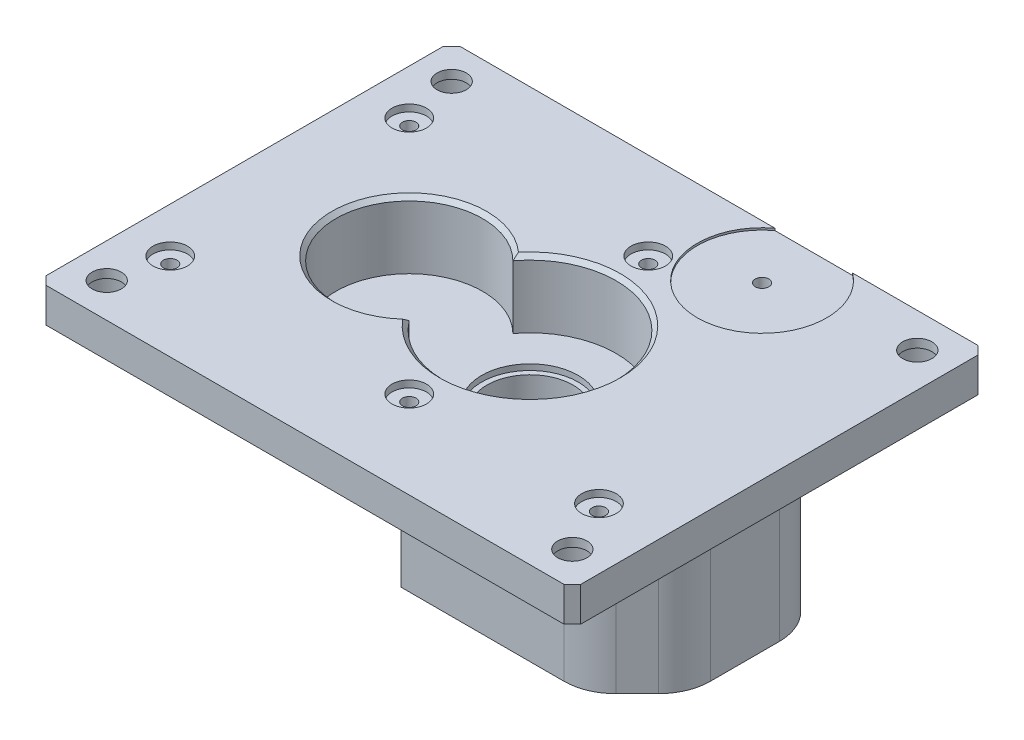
ISO-10303-21;
HEADER;
FILE_DESCRIPTION(('STEP AP214'),'2;1');
FILE_NAME('part.step','',(''),(''),'','','');
FILE_SCHEMA(('AUTOMOTIVE_DESIGN { 1 0 10303 214 1 1 1 1 }'));
ENDSEC;
DATA;
#1=APPLICATION_CONTEXT('core data for automotive mechanical design processes');
#2=APPLICATION_PROTOCOL_DEFINITION('international standard','automotive_design',2000,#1);
#3=PRODUCT_CONTEXT('',#1,'mechanical');
#4=PRODUCT('Part','Part','',(#3));
#5=PRODUCT_RELATED_PRODUCT_CATEGORY('part','',(#4));
#6=PRODUCT_DEFINITION_FORMATION('','',#4);
#7=PRODUCT_DEFINITION_CONTEXT('part definition',#1,'design');
#8=PRODUCT_DEFINITION('design','',#6,#7);
#9=PRODUCT_DEFINITION_SHAPE('','',#8);
#10=(LENGTH_UNIT() NAMED_UNIT(*) SI_UNIT(.MILLI.,.METRE.));
#11=(NAMED_UNIT(*) PLANE_ANGLE_UNIT() SI_UNIT($,.RADIAN.));
#12=(NAMED_UNIT(*) SI_UNIT($,.STERADIAN.) SOLID_ANGLE_UNIT());
#13=UNCERTAINTY_MEASURE_WITH_UNIT(LENGTH_MEASURE(1.E-05),#10,'distance_accuracy_value','');
#14=(GEOMETRIC_REPRESENTATION_CONTEXT(3) GLOBAL_UNCERTAINTY_ASSIGNED_CONTEXT((#13)) GLOBAL_UNIT_ASSIGNED_CONTEXT((#10,
#11,#12)) REPRESENTATION_CONTEXT('',''));
#15=CARTESIAN_POINT('',(0.,0.,0.));
#16=DIRECTION('',(0.,0.,1.));
#17=DIRECTION('',(1.,0.,0.));
#18=AXIS2_PLACEMENT_3D('',#15,#16,#17);
#19=CARTESIAN_POINT('',(-9.52499999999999,8.34339200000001,-59.563));
#20=DIRECTION('',(0.,1.,0.));
#21=DIRECTION('',(0.,0.,1.));
#22=AXIS2_PLACEMENT_3D('',#19,#20,#21);
#23=CYLINDRICAL_SURFACE('',#22,1.24999999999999);
#24=CARTESIAN_POINT('',(-9.52499999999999,1.99339199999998,-59.563));
#25=DIRECTION('',(0.,-1.,0.));
#26=DIRECTION('',(0.,0.,-1.));
#27=AXIS2_PLACEMENT_3D('',#24,#25,#26);
#28=CIRCLE('',#27,1.24999999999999);
#29=CARTESIAN_POINT('',(-9.52499999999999,1.99339199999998,-60.813));
#30=VERTEX_POINT('',#29);
#31=EDGE_CURVE('E720',#30,#30,#28,.T.);
#32=ORIENTED_EDGE('',*,*,#31,.T.);
#33=EDGE_LOOP('',(#32));
#34=FACE_BOUND('',#33,.T.);
#35=CARTESIAN_POINT('',(-10.287,3.51739200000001,-60.5538864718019));
#36=CARTESIAN_POINT('',(-10.2869945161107,3.47927602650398,-60.5538944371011));
#37=CARTESIAN_POINT('',(-10.2841147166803,3.44110531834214,-60.5561262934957));
#38=CARTESIAN_POINT('',(-10.2727845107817,3.36601495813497,-60.5646806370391));
#39=CARTESIAN_POINT('',(-10.2643173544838,3.32909941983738,-60.5710154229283));
#40=CARTESIAN_POINT('',(-10.2423965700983,3.25784462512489,-60.5867287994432));
#41=CARTESIAN_POINT('',(-10.2289843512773,3.22348674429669,-60.5960820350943));
#42=CARTESIAN_POINT('',(-10.197675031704,3.15755040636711,-60.6167358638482));
#43=CARTESIAN_POINT('',(-10.1797782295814,3.12597176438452,-60.6280363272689));
#44=CARTESIAN_POINT('',(-10.1373600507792,3.06207882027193,-60.6530434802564));
#45=CARTESIAN_POINT('',(-10.1122863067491,3.0301793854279,-60.6668735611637));
#46=CARTESIAN_POINT('',(-10.0573551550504,2.97069020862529,-60.6943899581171));
#47=CARTESIAN_POINT('',(-10.0274937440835,2.94310411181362,-60.7080761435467));
#48=CARTESIAN_POINT('',(-9.9597573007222,2.88994896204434,-60.7355897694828));
#49=CARTESIAN_POINT('',(-9.92135841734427,2.86495757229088,-60.7492593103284));
#50=CARTESIAN_POINT('',(-9.83990922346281,2.82198580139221,-60.7734255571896));
#51=CARTESIAN_POINT('',(-9.79686337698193,2.80399876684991,-60.7839252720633));
#52=CARTESIAN_POINT('',(-9.71178849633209,2.77743203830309,-60.7996463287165));
#53=CARTESIAN_POINT('',(-9.67007196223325,2.76810417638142,-60.8052835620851));
#54=CARTESIAN_POINT('',(-9.58532571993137,2.7565845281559,-60.8122645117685));
#55=CARTESIAN_POINT('',(-9.54229734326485,2.75438573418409,-60.813612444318));
#56=CARTESIAN_POINT('',(-9.46208856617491,2.75707150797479,-60.8119771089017));
#57=CARTESIAN_POINT('',(-9.42486394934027,2.76108625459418,-60.8095256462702));
#58=CARTESIAN_POINT('',(-9.35173467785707,2.7744220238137,-60.8014797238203));
#59=CARTESIAN_POINT('',(-9.31583012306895,2.78374344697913,-60.7958850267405));
#60=CARTESIAN_POINT('',(-9.24606121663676,2.80732105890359,-60.782001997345));
#61=CARTESIAN_POINT('',(-9.21220706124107,2.82159985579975,-60.7737013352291));
#62=CARTESIAN_POINT('',(-9.14733933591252,2.85456358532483,-60.7550624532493));
#63=CARTESIAN_POINT('',(-9.11632647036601,2.87324960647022,-60.7447237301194));
#64=CARTESIAN_POINT('',(-9.0539830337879,2.91705066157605,-60.7213957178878));
#65=CARTESIAN_POINT('',(-9.02307121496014,2.9426708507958,-60.7082370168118));
#66=CARTESIAN_POINT('',(-8.9657183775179,2.99830856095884,-60.6813513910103));
#67=CARTESIAN_POINT('',(-8.93928370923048,3.02833221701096,-60.6676236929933));
#68=CARTESIAN_POINT('',(-8.88838231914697,3.09623229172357,-60.6391812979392));
#69=CARTESIAN_POINT('',(-8.86454491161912,3.1346196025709,-60.6245493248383));
#70=CARTESIAN_POINT('',(-8.82377550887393,3.21576337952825,-60.5980738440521));
#71=CARTESIAN_POINT('',(-8.80683073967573,3.25851157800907,-60.5862251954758));
#72=CARTESIAN_POINT('',(-8.78407965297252,3.33607794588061,-60.5698175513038));
#73=CARTESIAN_POINT('',(-8.77653813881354,3.37015653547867,-60.5641717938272));
#74=CARTESIAN_POINT('',(-8.76619647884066,3.43940074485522,-60.5563584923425));
#75=CARTESIAN_POINT('',(-8.76339046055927,3.47456496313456,-60.5541866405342));
#76=CARTESIAN_POINT('',(-8.76268520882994,3.54503224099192,-60.5536444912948));
#77=CARTESIAN_POINT('',(-8.76479435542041,3.58033543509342,-60.5552806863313));
#78=CARTESIAN_POINT('',(-8.77380124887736,3.64998054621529,-60.5621149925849));
#79=CARTESIAN_POINT('',(-8.78070286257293,3.68432166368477,-60.5673159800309));
#80=CARTESIAN_POINT('',(-8.79886745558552,3.75097773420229,-60.5805239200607));
#81=CARTESIAN_POINT('',(-8.81010075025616,3.78330477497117,-60.5885117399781));
#82=CARTESIAN_POINT('',(-8.83652263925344,3.84570989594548,-60.6064334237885));
#83=CARTESIAN_POINT('',(-8.85171268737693,3.87578714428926,-60.6163680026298));
#84=CARTESIAN_POINT('',(-8.88884435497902,3.93872325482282,-60.6392733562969));
#85=CARTESIAN_POINT('',(-8.91151451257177,3.9710718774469,-60.6524661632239));
#86=CARTESIAN_POINT('',(-8.96150443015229,4.0318503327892,-60.6791438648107));
#87=CARTESIAN_POINT('',(-8.98882880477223,4.06027622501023,-60.6926290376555));
#88=CARTESIAN_POINT('',(-9.0519458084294,4.11646697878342,-60.7206148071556));
#89=CARTESIAN_POINT('',(-9.08838939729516,4.14357152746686,-60.7349898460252));
#90=CARTESIAN_POINT('',(-9.16621658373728,4.19118337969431,-60.7611047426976));
#91=CARTESIAN_POINT('',(-9.20759720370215,4.21169463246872,-60.7728461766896));
#92=CARTESIAN_POINT('',(-9.29127396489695,4.24394941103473,-60.7916505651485));
#93=CARTESIAN_POINT('',(-9.33331410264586,4.25619648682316,-60.7989784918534));
#94=CARTESIAN_POINT('',(-9.41937196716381,4.27330502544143,-60.8092794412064));
#95=CARTESIAN_POINT('',(-9.46338720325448,4.278175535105,-60.8122577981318));
#96=CARTESIAN_POINT('',(-9.54550050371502,4.28006580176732,-60.8134113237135));
#97=CARTESIAN_POINT('',(-9.58357124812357,4.27808208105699,-60.8121962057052));
#98=CARTESIAN_POINT('',(-9.65873590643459,4.26852001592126,-60.8063964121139));
#99=CARTESIAN_POINT('',(-9.69582982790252,4.2609417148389,-60.8018117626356));
#100=CARTESIAN_POINT('',(-9.76720310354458,4.24080528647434,-60.789833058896));
#101=CARTESIAN_POINT('',(-9.80152736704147,4.22836473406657,-60.7825054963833));
#102=CARTESIAN_POINT('',(-9.86759380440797,4.19899421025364,-60.7656193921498));
#103=CARTESIAN_POINT('',(-9.89933546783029,4.18206335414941,-60.7560604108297));
#104=CARTESIAN_POINT('',(-9.96300990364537,4.14217235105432,-60.7342802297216));
#105=CARTESIAN_POINT('',(-9.99459889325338,4.11876061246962,-60.7218835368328));
#106=CARTESIAN_POINT('',(-10.0536413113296,4.06758428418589,-60.6961715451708));
#107=CARTESIAN_POINT('',(-10.0810898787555,4.03981465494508,-60.682855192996));
#108=CARTESIAN_POINT('',(-10.1348579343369,3.9763812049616,-60.6546103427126));
#109=CARTESIAN_POINT('',(-10.1605338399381,3.9401582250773,-60.6397047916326));
#110=CARTESIAN_POINT('',(-10.2054635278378,3.86321339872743,-60.6118894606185));
#111=CARTESIAN_POINT('',(-10.2247220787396,3.82249492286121,-60.5989782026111));
#112=CARTESIAN_POINT('',(-10.2524853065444,3.74685125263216,-60.5796047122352));
#113=CARTESIAN_POINT('',(-10.2624303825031,3.71265900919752,-60.5723464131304));
#114=CARTESIAN_POINT('',(-10.2774600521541,3.64275335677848,-60.5611959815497));
#115=CARTESIAN_POINT('',(-10.2825607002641,3.60704538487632,-60.5572927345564));
#116=CARTESIAN_POINT('',(-10.2863692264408,3.55323700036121,-60.5543710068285));
#117=CARTESIAN_POINT('',(-10.287002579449,3.53532055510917,-60.5538827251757));
#118=CARTESIAN_POINT('',(-10.287,3.51739200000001,-60.5538864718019));
#119=B_SPLINE_CURVE_WITH_KNOTS('',3,(#35,#36,#37,#38,#39,#40,#41,#42,#43,#44,#45,#46,#47,#48,
#49,#50,#51,#52,#53,#54,#55,#56,#57,#58,#59,#60,#61,#62,#63,#64,#65,#66,#67,#68,#69,#70,#71,#72,
#73,#74,#75,#76,#77,#78,#79,#80,#81,#82,#83,#84,#85,#86,#87,#88,#89,#90,#91,#92,#93,#94,#95,#96,
#97,#98,#99,#100,#101,#102,#103,#104,#105,#106,#107,#108,#109,#110,#111,#112,#113,#114,#115,
#116,#117,#118),.UNSPECIFIED.,.T.,.F.,(4,2,2,2,2,2,2,2,2,2,2,2,2,2,2,2,2,2,2,2,2,2,2,2,2,2,2,2,
2,2,2,2,2,2,2,2,2,2,2,2,2,4),(0.,0.114281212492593,0.2289065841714,0.342593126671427,
0.456272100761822,0.584372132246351,0.712579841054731,0.855235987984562,0.997756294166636,
1.12633392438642,1.2547851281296,1.36681081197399,1.47884495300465,1.59139688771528,
1.70397665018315,1.83022757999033,1.95665610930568,2.09844530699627,2.23997051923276,
2.34559082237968,2.45108004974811,2.55674926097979,2.66250383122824,2.76754619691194,
2.8726272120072,2.99709074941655,3.12167841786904,3.26386124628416,3.40595875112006,
3.53834153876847,3.67056183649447,3.78441631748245,3.89826991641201,4.00952561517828,
4.12080325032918,4.24400142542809,4.36734313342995,4.50720418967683,4.6469610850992,
4.75555260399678,4.86378298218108,4.91753727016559),.UNSPECIFIED.);
#120=CARTESIAN_POINT('',(-10.287,3.51739200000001,-60.5538864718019));
#121=VERTEX_POINT('',#120);
#122=EDGE_CURVE('E726',#121,#121,#119,.T.);
#123=ORIENTED_EDGE('',*,*,#122,.F.);
#124=EDGE_LOOP('',(#123));
#125=FACE_BOUND('',#124,.T.);
#126=CARTESIAN_POINT('',(-9.52499999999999,7.96239200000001,-59.563));
#127=DIRECTION('',(0.,1.,0.));
#128=DIRECTION('',(-1.,0.,0.));
#129=AXIS2_PLACEMENT_3D('',#126,#127,#128);
#130=CIRCLE('',#129,1.24999999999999);
#131=CARTESIAN_POINT('',(-10.775,7.96239200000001,-59.563));
#132=VERTEX_POINT('',#131);
#133=EDGE_CURVE('E34',#132,#132,#130,.F.);
#134=ORIENTED_EDGE('',*,*,#133,.F.);
#135=EDGE_LOOP('',(#134));
#136=FACE_BOUND('',#135,.T.);
#137=ADVANCED_FACE('F30',(#34,#125,#136),#23,.F.);
#138=CARTESIAN_POINT('',(-6.476365,0.,-26.9463519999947));
#139=DIRECTION('',(0.,-1.,0.));
#140=DIRECTION('',(0.,0.,-1.));
#141=AXIS2_PLACEMENT_3D('',#138,#139,#140);
#142=PLANE('',#141);
#143=CARTESIAN_POINT('',(-2.51396500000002,0.,-30.9879999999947));
#144=DIRECTION('',(0.,-1.,0.));
#145=DIRECTION('',(0.,0.,-1.));
#146=AXIS2_PLACEMENT_3D('',#143,#144,#145);
#147=CIRCLE('',#146,3.96240000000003);
#148=CARTESIAN_POINT('',(-2.51396500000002,0.,-34.9503999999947));
#149=VERTEX_POINT('',#148);
#150=EDGE_CURVE('E718',#149,#149,#147,.F.);
#151=ORIENTED_EDGE('',*,*,#150,.F.);
#152=EDGE_LOOP('',(#151));
#153=FACE_BOUND('',#152,.T.);
#154=ADVANCED_FACE('F1363',(#153),#142,.T.);
#155=CARTESIAN_POINT('',(-2.51396500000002,0.,-30.9879999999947));
#156=DIRECTION('',(0.,-1.,0.));
#157=DIRECTION('',(0.,0.,-1.));
#158=AXIS2_PLACEMENT_3D('',#155,#156,#157);
#159=CYLINDRICAL_SURFACE('',#158,3.96240000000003);
#160=ORIENTED_EDGE('',*,*,#150,.T.);
#161=EDGE_LOOP('',(#160));
#162=FACE_BOUND('',#161,.T.);
#163=CARTESIAN_POINT('',(-2.51396500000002,-5.08,-30.9879999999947));
#164=DIRECTION('',(0.,-1.,0.));
#165=DIRECTION('',(0.,0.,-1.));
#166=AXIS2_PLACEMENT_3D('',#163,#164,#165);
#167=CIRCLE('',#166,3.96240000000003);
#168=CARTESIAN_POINT('',(-2.51396500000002,-5.08,-34.9503999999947));
#169=VERTEX_POINT('',#168);
#170=EDGE_CURVE('E715',#169,#169,#167,.T.);
#171=ORIENTED_EDGE('',*,*,#170,.T.);
#172=EDGE_LOOP('',(#171));
#173=FACE_BOUND('',#172,.T.);
#174=ADVANCED_FACE('F1368',(#162,#173),#159,.F.);
#175=CARTESIAN_POINT('',(-10.451465,-5.08000000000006,-22.8917499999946));
#176=DIRECTION('',(0.,-1.,0.));
#177=DIRECTION('',(0.,0.,-1.));
#178=AXIS2_PLACEMENT_3D('',#175,#176,#177);
#179=PLANE('',#178);
#180=ORIENTED_EDGE('',*,*,#170,.F.);
#181=EDGE_LOOP('',(#180));
#182=FACE_BOUND('',#181,.T.);
#183=CARTESIAN_POINT('',(-2.51396499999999,-5.08,-30.9879999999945));
#184=DIRECTION('',(0.,1.,0.));
#185=DIRECTION('',(0.,0.,1.));
#186=AXIS2_PLACEMENT_3D('',#183,#184,#185);
#187=CIRCLE('',#186,7.93749999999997);
#188=CARTESIAN_POINT('',(-2.51396499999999,-5.08,-23.0504999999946));
#189=VERTEX_POINT('',#188);
#190=EDGE_CURVE('E712',#189,#189,#187,.T.);
#191=ORIENTED_EDGE('',*,*,#190,.F.);
#192=EDGE_LOOP('',(#191));
#193=FACE_BOUND('',#192,.T.);
#194=ADVANCED_FACE('F1505',(#182,#193),#179,.T.);
#195=CARTESIAN_POINT('',(-2.51396499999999,-11.43,-30.9879999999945));
#196=DIRECTION('',(0.,1.,0.));
#197=DIRECTION('',(0.,0.,1.));
#198=AXIS2_PLACEMENT_3D('',#195,#196,#197);
#199=CYLINDRICAL_SURFACE('',#198,7.93749999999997);
#200=ORIENTED_EDGE('',*,*,#190,.T.);
#201=EDGE_LOOP('',(#200));
#202=FACE_BOUND('',#201,.T.);
#203=CARTESIAN_POINT('',(-2.51396499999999,-11.43,-30.9879999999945));
#204=DIRECTION('',(0.,1.,0.));
#205=DIRECTION('',(0.,0.,1.));
#206=AXIS2_PLACEMENT_3D('',#203,#204,#205);
#207=CIRCLE('',#206,7.93749999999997);
#208=CARTESIAN_POINT('',(-2.51396499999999,-11.43,-23.0504999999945));
#209=VERTEX_POINT('',#208);
#210=EDGE_CURVE('E709',#209,#209,#207,.F.);
#211=ORIENTED_EDGE('',*,*,#210,.T.);
#212=EDGE_LOOP('',(#211));
#213=FACE_BOUND('',#212,.T.);
#214=ADVANCED_FACE('F1514',(#202,#213),#199,.F.);
#215=CARTESIAN_POINT('',(-11.403965,-11.4300000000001,-21.9201999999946));
#216=DIRECTION('',(0.,-1.,0.));
#217=DIRECTION('',(0.,0.,-1.));
#218=AXIS2_PLACEMENT_3D('',#215,#216,#217);
#219=PLANE('',#218);
#220=ORIENTED_EDGE('',*,*,#210,.F.);
#221=EDGE_LOOP('',(#220));
#222=FACE_BOUND('',#221,.T.);
#223=CARTESIAN_POINT('',(-2.51396499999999,-11.43,-30.9879999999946));
#224=DIRECTION('',(0.,1.,0.));
#225=DIRECTION('',(0.,0.,1.));
#226=AXIS2_PLACEMENT_3D('',#223,#224,#225);
#227=CIRCLE('',#226,8.88999999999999);
#228=CARTESIAN_POINT('',(-2.51396499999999,-11.43,-22.0979999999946));
#229=VERTEX_POINT('',#228);
#230=EDGE_CURVE('E706',#229,#229,#227,.T.);
#231=ORIENTED_EDGE('',*,*,#230,.F.);
#232=EDGE_LOOP('',(#231));
#233=FACE_BOUND('',#232,.T.);
#234=ADVANCED_FACE('F1525',(#222,#233),#219,.T.);
#235=CARTESIAN_POINT('',(-2.51396499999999,-12.4968,-30.9879999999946));
#236=DIRECTION('',(0.,1.,0.));
#237=DIRECTION('',(0.,0.,1.));
#238=AXIS2_PLACEMENT_3D('',#235,#236,#237);
#239=CYLINDRICAL_SURFACE('',#238,8.88999999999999);
#240=CARTESIAN_POINT('',(-2.51396499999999,-12.4968,-30.9879999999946));
#241=DIRECTION('',(0.,1.,0.));
#242=DIRECTION('',(0.,0.,1.));
#243=AXIS2_PLACEMENT_3D('',#240,#241,#242);
#244=CIRCLE('',#243,8.88999999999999);
#245=CARTESIAN_POINT('',(-2.51396499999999,-12.4968,-22.0979999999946));
#246=VERTEX_POINT('',#245);
#247=EDGE_CURVE('E692',#246,#246,#244,.F.);
#248=ORIENTED_EDGE('',*,*,#247,.T.);
#249=EDGE_LOOP('',(#248));
#250=FACE_BOUND('',#249,.T.);
#251=ORIENTED_EDGE('',*,*,#230,.T.);
#252=EDGE_LOOP('',(#251));
#253=FACE_BOUND('',#252,.T.);
#254=ADVANCED_FACE('F1535',(#250,#253),#239,.F.);
#255=CARTESIAN_POINT('',(-63.5,-6.35000000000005,-11.176));
#256=DIRECTION('',(0.,-1.,0.));
#257=DIRECTION('',(0.,0.,-1.));
#258=AXIS2_PLACEMENT_3D('',#255,#256,#257);
#259=PLANE('',#258);
#260=DIRECTION('',(-0.707106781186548,0.,0.707106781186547));
#261=VECTOR('',#260,1.);
#262=CARTESIAN_POINT('',(-56.764807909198,-6.34999999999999,-48.010192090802));
#263=LINE('',#262,#261);
#264=CARTESIAN_POINT('',(-56.7648079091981,-6.34999999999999,-48.0101920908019));
#265=VERTEX_POINT('',#264);
#266=CARTESIAN_POINT('',(-60.7101920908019,-6.34999999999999,-44.064807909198));
#267=VERTEX_POINT('',#266);
#268=EDGE_CURVE('E689',#265,#267,#263,.T.);
#269=ORIENTED_EDGE('',*,*,#268,.F.);
#270=CARTESIAN_POINT('',(-50.0296158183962,-6.34999999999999,-41.275));
#271=DIRECTION('',(0.,1.,0.));
#272=DIRECTION('',(0.,0.,1.));
#273=AXIS2_PLACEMENT_3D('',#270,#271,#272);
#274=CIRCLE('',#273,9.52499999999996);
#275=CARTESIAN_POINT('',(-50.0296158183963,-6.35000000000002,-50.7999999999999));
#276=VERTEX_POINT('',#275);
#277=EDGE_CURVE('E622',#276,#265,#274,.T.);
#278=ORIENTED_EDGE('',*,*,#277,.F.);
#279=DIRECTION('',(-1.,0.,0.));
#280=VECTOR('',#279,1.);
#281=CARTESIAN_POINT('',(2.4046158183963,-6.35000000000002,-50.8));
#282=LINE('',#281,#280);
#283=CARTESIAN_POINT('',(-27.648535,-6.35000000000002,-50.8));
#284=VERTEX_POINT('',#283);
#285=EDGE_CURVE('E628',#284,#276,#282,.T.);
#286=ORIENTED_EDGE('',*,*,#285,.F.);
#287=DIRECTION('',(0.707106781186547,0.,-0.707106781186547));
#288=VECTOR('',#287,1.);
#289=CARTESIAN_POINT('',(-37.173535,-6.34999999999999,-41.275));
#290=LINE('',#289,#288);
#291=CARTESIAN_POINT('',(-37.173535,-6.34999999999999,-41.275));
#292=VERTEX_POINT('',#291);
#293=EDGE_CURVE('E698',#292,#284,#290,.T.);
#294=ORIENTED_EDGE('',*,*,#293,.F.);
#295=DIRECTION('',(0.,0.,-1.));
#296=VECTOR('',#295,1.);
#297=CARTESIAN_POINT('',(-37.173535,-6.35000000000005,-20.701));
#298=LINE('',#297,#296);
#299=CARTESIAN_POINT('',(-37.173535,-6.35000000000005,-20.701));
#300=VERTEX_POINT('',#299);
#301=EDGE_CURVE('E262',#300,#292,#298,.T.);
#302=ORIENTED_EDGE('',*,*,#301,.F.);
#303=DIRECTION('',(-0.707106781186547,0.,-0.707106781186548));
#304=VECTOR('',#303,1.);
#305=CARTESIAN_POINT('',(-27.648535,-6.35000000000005,-11.176));
#306=LINE('',#305,#304);
#307=CARTESIAN_POINT('',(-27.648535,-6.35000000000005,-11.176));
#308=VERTEX_POINT('',#307);
#309=EDGE_CURVE('E704',#308,#300,#306,.T.);
#310=ORIENTED_EDGE('',*,*,#309,.F.);
#311=DIRECTION('',(1.,0.,0.));
#312=VECTOR('',#311,1.);
#313=CARTESIAN_POINT('',(-50.0296158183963,-6.35000000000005,-11.176));
#314=LINE('',#313,#312);
#315=CARTESIAN_POINT('',(-50.0296158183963,-6.35000000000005,-11.176));
#316=VERTEX_POINT('',#315);
#317=EDGE_CURVE('E656',#316,#308,#314,.T.);
#318=ORIENTED_EDGE('',*,*,#317,.F.);
#319=CARTESIAN_POINT('',(-50.0296158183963,-6.35000000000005,-20.701));
#320=DIRECTION('',(0.,-1.,0.));
#321=DIRECTION('',(0.,0.,-1.));
#322=AXIS2_PLACEMENT_3D('',#319,#320,#321);
#323=CIRCLE('',#322,9.52499999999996);
#324=CARTESIAN_POINT('',(-56.764807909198,-6.35000000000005,-13.9658079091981));
#325=VERTEX_POINT('',#324);
#326=EDGE_CURVE('E662',#325,#316,#323,.F.);
#327=ORIENTED_EDGE('',*,*,#326,.F.);
#328=DIRECTION('',(0.707106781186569,0.,0.707106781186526));
#329=VECTOR('',#328,1.);
#330=CARTESIAN_POINT('',(-60.710192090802,-6.34999999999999,-17.9111920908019));
#331=LINE('',#330,#329);
#332=CARTESIAN_POINT('',(-60.7101920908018,-6.34999999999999,-17.9111920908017));
#333=VERTEX_POINT('',#332);
#334=EDGE_CURVE('E667',#333,#325,#331,.T.);
#335=ORIENTED_EDGE('',*,*,#334,.F.);
#336=CARTESIAN_POINT('',(-53.975,-6.35000000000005,-24.6463841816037));
#337=DIRECTION('',(0.,1.,0.));
#338=DIRECTION('',(0.,0.,1.));
#339=AXIS2_PLACEMENT_3D('',#336,#337,#338);
#340=CIRCLE('',#339,9.52499999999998);
#341=CARTESIAN_POINT('',(-63.5,-6.35000000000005,-24.6463841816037));
#342=VERTEX_POINT('',#341);
#343=EDGE_CURVE('E673',#342,#333,#340,.T.);
#344=ORIENTED_EDGE('',*,*,#343,.F.);
#345=DIRECTION('',(0.,0.,1.));
#346=VECTOR('',#345,1.);
#347=CARTESIAN_POINT('',(-63.5,-6.34999999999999,-37.3296158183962));
#348=LINE('',#347,#346);
#349=CARTESIAN_POINT('',(-63.5,-6.34999999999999,-37.3296158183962));
#350=VERTEX_POINT('',#349);
#351=EDGE_CURVE('E678',#350,#342,#348,.T.);
#352=ORIENTED_EDGE('',*,*,#351,.F.);
#353=CARTESIAN_POINT('',(-53.975,-6.34999999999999,-37.3296158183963));
#354=DIRECTION('',(0.,-1.,0.));
#355=DIRECTION('',(0.,0.,-1.));
#356=AXIS2_PLACEMENT_3D('',#353,#354,#355);
#357=CIRCLE('',#356,9.52499999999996);
#358=EDGE_CURVE('E684',#267,#350,#357,.F.);
#359=ORIENTED_EDGE('',*,*,#358,.F.);
#360=EDGE_LOOP('',(#269,#278,#286,#294,#302,#310,#318,#327,#335,#344,#352,#359));
#361=FACE_BOUND('',#360,.T.);
#362=ADVANCED_FACE('F1545',(#361),#259,.T.);
#363=CARTESIAN_POINT('',(-27.648535,-6.35000000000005,-11.176));
#364=DIRECTION('',(-0.707106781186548,0.,0.707106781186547));
#365=DIRECTION('',(-0.707106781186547,0.,-0.707106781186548));
#366=AXIS2_PLACEMENT_3D('',#363,#364,#365);
#367=PLANE('',#366);
#368=DIRECTION('',(-0.707106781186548,0.,-0.707106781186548));
#369=VECTOR('',#368,1.);
#370=CARTESIAN_POINT('',(-27.648535,-25.4,-11.176));
#371=LINE('',#370,#369);
#372=CARTESIAN_POINT('',(-27.648535,-25.4,-11.176));
#373=VERTEX_POINT('',#372);
#374=CARTESIAN_POINT('',(-37.173535,-25.4000000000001,-20.7009999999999));
#375=VERTEX_POINT('',#374);
#376=EDGE_CURVE('E607',#373,#375,#371,.T.);
#377=ORIENTED_EDGE('',*,*,#376,.F.);
#378=DIRECTION('',(0.,1.,0.));
#379=VECTOR('',#378,1.);
#380=CARTESIAN_POINT('',(-27.648535,-25.4,-11.176));
#381=LINE('',#380,#379);
#382=EDGE_CURVE('E654',#308,#373,#381,.F.);
#383=ORIENTED_EDGE('',*,*,#382,.F.);
#384=ORIENTED_EDGE('',*,*,#309,.T.);
#385=DIRECTION('',(0.,-1.,0.));
#386=VECTOR('',#385,1.);
#387=CARTESIAN_POINT('',(-37.173535,-6.35000000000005,-20.701));
#388=LINE('',#387,#386);
#389=EDGE_CURVE('E700',#375,#300,#388,.F.);
#390=ORIENTED_EDGE('',*,*,#389,.F.);
#391=EDGE_LOOP('',(#377,#383,#384,#390));
#392=FACE_BOUND('',#391,.T.);
#393=ADVANCED_FACE('F1554',(#392),#367,.T.);
#394=CARTESIAN_POINT('',(-37.173535,-6.35000000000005,-20.701));
#395=DIRECTION('',(-1.,0.,0.));
#396=DIRECTION('',(0.,0.,-1.));
#397=AXIS2_PLACEMENT_3D('',#394,#395,#396);
#398=PLANE('',#397);
#399=DIRECTION('',(0.,0.,1.));
#400=VECTOR('',#399,1.);
#401=CARTESIAN_POINT('',(-37.173535,-25.4000000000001,-50.8));
#402=LINE('',#401,#400);
#403=CARTESIAN_POINT('',(-37.173535,-25.4,-41.275));
#404=VERTEX_POINT('',#403);
#405=EDGE_CURVE('E604',#375,#404,#402,.F.);
#406=ORIENTED_EDGE('',*,*,#405,.F.);
#407=ORIENTED_EDGE('',*,*,#389,.T.);
#408=ORIENTED_EDGE('',*,*,#301,.T.);
#409=DIRECTION('',(0.,-1.,0.));
#410=VECTOR('',#409,1.);
#411=CARTESIAN_POINT('',(-37.173535,-6.34999999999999,-41.275));
#412=LINE('',#411,#410);
#413=EDGE_CURVE('E695',#404,#292,#412,.F.);
#414=ORIENTED_EDGE('',*,*,#413,.F.);
#415=EDGE_LOOP('',(#406,#407,#408,#414));
#416=FACE_BOUND('',#415,.T.);
#417=ADVANCED_FACE('F1563',(#416),#398,.T.);
#418=CARTESIAN_POINT('',(-37.173535,-6.34999999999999,-41.275));
#419=DIRECTION('',(-0.707106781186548,0.,-0.707106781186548));
#420=DIRECTION('',(0.707106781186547,0.,-0.707106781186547));
#421=AXIS2_PLACEMENT_3D('',#418,#419,#420);
#422=PLANE('',#421);
#423=DIRECTION('',(0.707106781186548,0.,-0.707106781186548));
#424=VECTOR('',#423,1.);
#425=CARTESIAN_POINT('',(-37.173535,-25.4,-41.275));
#426=LINE('',#425,#424);
#427=CARTESIAN_POINT('',(-27.648535,-25.4000000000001,-50.8));
#428=VERTEX_POINT('',#427);
#429=EDGE_CURVE('E601',#404,#428,#426,.T.);
#430=ORIENTED_EDGE('',*,*,#429,.F.);
#431=ORIENTED_EDGE('',*,*,#413,.T.);
#432=ORIENTED_EDGE('',*,*,#293,.T.);
#433=DIRECTION('',(0.,1.,0.));
#434=VECTOR('',#433,1.);
#435=CARTESIAN_POINT('',(-27.648535,-25.4000000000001,-50.8));
#436=LINE('',#435,#434);
#437=EDGE_CURVE('E631',#428,#284,#436,.T.);
#438=ORIENTED_EDGE('',*,*,#437,.F.);
#439=EDGE_LOOP('',(#430,#431,#432,#438));
#440=FACE_BOUND('',#439,.T.);
#441=ADVANCED_FACE('F1575',(#440),#422,.T.);
#442=CARTESIAN_POINT('',(7.595235,-12.4968,-41.299384));
#443=DIRECTION('',(0.,-1.,0.));
#444=DIRECTION('',(0.,0.,1.));
#445=AXIS2_PLACEMENT_3D('',#442,#443,#444);
#446=PLANE('',#445);
#447=ORIENTED_EDGE('',*,*,#247,.F.);
#448=EDGE_LOOP('',(#447));
#449=FACE_BOUND('',#448,.T.);
#450=CARTESIAN_POINT('',(-2.51396499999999,-12.4968,-30.9880000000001));
#451=DIRECTION('',(0.,1.,0.));
#452=DIRECTION('',(0.,0.,1.));
#453=AXIS2_PLACEMENT_3D('',#450,#451,#452);
#454=CIRCLE('',#453,10.1092);
#455=CARTESIAN_POINT('',(-2.51396499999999,-12.4968,-20.8788));
#456=VERTEX_POINT('',#455);
#457=EDGE_CURVE('E581',#456,#456,#454,.T.);
#458=ORIENTED_EDGE('',*,*,#457,.F.);
#459=EDGE_LOOP('',(#458));
#460=FACE_BOUND('',#459,.T.);
#461=ADVANCED_FACE('F1585',(#449,#460),#446,.T.);
#462=CARTESIAN_POINT('',(-56.764807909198,-6.34999999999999,-48.010192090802));
#463=DIRECTION('',(-0.707106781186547,0.,-0.707106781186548));
#464=DIRECTION('',(-0.707106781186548,0.,0.707106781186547));
#465=AXIS2_PLACEMENT_3D('',#462,#463,#464);
#466=PLANE('',#465);
#467=DIRECTION('',(0.,-1.,0.));
#468=VECTOR('',#467,1.);
#469=CARTESIAN_POINT('',(-60.7101920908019,-0.368807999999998,-44.064807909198));
#470=LINE('',#469,#468);
#471=CARTESIAN_POINT('',(-60.7101920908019,-0.368807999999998,-44.064807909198));
#472=VERTEX_POINT('',#471);
#473=EDGE_CURVE('E686',#472,#267,#470,.T.);
#474=ORIENTED_EDGE('',*,*,#473,.F.);
#475=DIRECTION('',(-0.707106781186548,0.,0.707106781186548));
#476=VECTOR('',#475,1.);
#477=CARTESIAN_POINT('',(-56.764807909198,-0.36880799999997,-48.010192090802));
#478=LINE('',#477,#476);
#479=CARTESIAN_POINT('',(-56.7648079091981,-0.36880799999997,-48.0101920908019));
#480=VERTEX_POINT('',#479);
#481=EDGE_CURVE('E578',#480,#472,#478,.T.);
#482=ORIENTED_EDGE('',*,*,#481,.F.);
#483=DIRECTION('',(0.,1.,0.));
#484=VECTOR('',#483,1.);
#485=CARTESIAN_POINT('',(-56.764807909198,-6.34999999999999,-48.010192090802));
#486=LINE('',#485,#484);
#487=EDGE_CURVE('E619',#265,#480,#486,.T.);
#488=ORIENTED_EDGE('',*,*,#487,.F.);
#489=ORIENTED_EDGE('',*,*,#268,.T.);
#490=EDGE_LOOP('',(#474,#482,#488,#489));
#491=FACE_BOUND('',#490,.T.);
#492=ADVANCED_FACE('F1594',(#491),#466,.T.);
#493=CARTESIAN_POINT('',(-53.975,-0.368807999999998,-37.3296158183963));
#494=DIRECTION('',(0.,-1.,0.));
#495=DIRECTION('',(0.,0.,-1.));
#496=AXIS2_PLACEMENT_3D('',#493,#494,#495);
#497=CYLINDRICAL_SURFACE('',#496,9.52499999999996);
#498=DIRECTION('',(0.,1.,0.));
#499=VECTOR('',#498,1.);
#500=CARTESIAN_POINT('',(-63.5,-6.34999999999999,-37.3296158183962));
#501=LINE('',#500,#499);
#502=CARTESIAN_POINT('',(-63.5,-0.368807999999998,-37.3296158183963));
#503=VERTEX_POINT('',#502);
#504=EDGE_CURVE('E681',#503,#350,#501,.F.);
#505=ORIENTED_EDGE('',*,*,#504,.F.);
#506=CARTESIAN_POINT('',(-53.975,-0.368807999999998,-37.3296158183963));
#507=DIRECTION('',(0.,-1.,0.));
#508=DIRECTION('',(0.,0.,-1.));
#509=AXIS2_PLACEMENT_3D('',#506,#507,#508);
#510=CIRCLE('',#509,9.52499999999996);
#511=EDGE_CURVE('E575',#472,#503,#510,.F.);
#512=ORIENTED_EDGE('',*,*,#511,.F.);
#513=ORIENTED_EDGE('',*,*,#473,.T.);
#514=ORIENTED_EDGE('',*,*,#358,.T.);
#515=EDGE_LOOP('',(#505,#512,#513,#514));
#516=FACE_BOUND('',#515,.T.);
#517=ADVANCED_FACE('F1604',(#516),#497,.T.);
#518=CARTESIAN_POINT('',(-63.5,-6.34999999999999,-37.3296158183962));
#519=DIRECTION('',(-1.,0.,0.));
#520=DIRECTION('',(0.,0.,1.));
#521=AXIS2_PLACEMENT_3D('',#518,#519,#520);
#522=PLANE('',#521);
#523=DIRECTION('',(0.,1.,0.));
#524=VECTOR('',#523,1.);
#525=CARTESIAN_POINT('',(-63.5,-6.35000000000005,-24.6463841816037));
#526=LINE('',#525,#524);
#527=CARTESIAN_POINT('',(-63.5,-0.368808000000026,-24.6463841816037));
#528=VERTEX_POINT('',#527);
#529=EDGE_CURVE('E675',#528,#342,#526,.F.);
#530=ORIENTED_EDGE('',*,*,#529,.F.);
#531=DIRECTION('',(0.,0.,1.));
#532=VECTOR('',#531,1.);
#533=CARTESIAN_POINT('',(-63.5,-0.368807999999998,-53.975));
#534=LINE('',#533,#532);
#535=EDGE_CURVE('E572',#503,#528,#534,.T.);
#536=ORIENTED_EDGE('',*,*,#535,.F.);
#537=ORIENTED_EDGE('',*,*,#504,.T.);
#538=ORIENTED_EDGE('',*,*,#351,.T.);
#539=EDGE_LOOP('',(#530,#536,#537,#538));
#540=FACE_BOUND('',#539,.T.);
#541=ADVANCED_FACE('F1614',(#540),#522,.T.);
#542=CARTESIAN_POINT('',(-53.975,-6.35000000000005,-24.6463841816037));
#543=DIRECTION('',(0.,1.,0.));
#544=DIRECTION('',(0.,0.,1.));
#545=AXIS2_PLACEMENT_3D('',#542,#543,#544);
#546=CYLINDRICAL_SURFACE('',#545,9.52499999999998);
#547=DIRECTION('',(0.,1.,0.));
#548=VECTOR('',#547,1.);
#549=CARTESIAN_POINT('',(-60.710192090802,-6.34999999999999,-17.9111920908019));
#550=LINE('',#549,#548);
#551=CARTESIAN_POINT('',(-60.7101920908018,-0.36880799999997,-17.9111920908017));
#552=VERTEX_POINT('',#551);
#553=EDGE_CURVE('E670',#552,#333,#550,.F.);
#554=ORIENTED_EDGE('',*,*,#553,.F.);
#555=CARTESIAN_POINT('',(-53.975,-0.368808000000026,-24.6463841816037));
#556=DIRECTION('',(0.,1.,0.));
#557=DIRECTION('',(0.,0.,1.));
#558=AXIS2_PLACEMENT_3D('',#555,#556,#557);
#559=CIRCLE('',#558,9.52499999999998);
#560=EDGE_CURVE('E569',#528,#552,#559,.T.);
#561=ORIENTED_EDGE('',*,*,#560,.F.);
#562=ORIENTED_EDGE('',*,*,#529,.T.);
#563=ORIENTED_EDGE('',*,*,#343,.T.);
#564=EDGE_LOOP('',(#554,#561,#562,#563));
#565=FACE_BOUND('',#564,.T.);
#566=ADVANCED_FACE('F1624',(#565),#546,.T.);
#567=CARTESIAN_POINT('',(-60.710192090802,-6.34999999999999,-17.9111920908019));
#568=DIRECTION('',(-0.707106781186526,0.,0.707106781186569));
#569=DIRECTION('',(0.707106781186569,0.,0.707106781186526));
#570=AXIS2_PLACEMENT_3D('',#567,#568,#569);
#571=PLANE('',#570);
#572=ORIENTED_EDGE('',*,*,#553,.T.);
#573=ORIENTED_EDGE('',*,*,#334,.T.);
#574=DIRECTION('',(0.,-1.,0.));
#575=VECTOR('',#574,1.);
#576=CARTESIAN_POINT('',(-56.7648079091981,-0.368808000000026,-13.9658079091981));
#577=LINE('',#576,#575);
#578=CARTESIAN_POINT('',(-56.764807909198,-0.368808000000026,-13.9658079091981));
#579=VERTEX_POINT('',#578);
#580=EDGE_CURVE('E664',#579,#325,#577,.T.);
#581=ORIENTED_EDGE('',*,*,#580,.F.);
#582=DIRECTION('',(0.707106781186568,0.,0.707106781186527));
#583=VECTOR('',#582,1.);
#584=CARTESIAN_POINT('',(-60.7101920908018,-0.36880799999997,-17.9111920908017));
#585=LINE('',#584,#583);
#586=EDGE_CURVE('E566',#552,#579,#585,.T.);
#587=ORIENTED_EDGE('',*,*,#586,.F.);
#588=EDGE_LOOP('',(#572,#573,#581,#587));
#589=FACE_BOUND('',#588,.T.);
#590=ADVANCED_FACE('F1634',(#589),#571,.T.);
#591=CARTESIAN_POINT('',(-50.0296158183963,-0.368808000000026,-20.701));
#592=DIRECTION('',(0.,-1.,0.));
#593=DIRECTION('',(0.,0.,-1.));
#594=AXIS2_PLACEMENT_3D('',#591,#592,#593);
#595=CYLINDRICAL_SURFACE('',#594,9.52499999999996);
#596=DIRECTION('',(0.,1.,0.));
#597=VECTOR('',#596,1.);
#598=CARTESIAN_POINT('',(-50.0296158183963,-25.4,-11.176));
#599=LINE('',#598,#597);
#600=CARTESIAN_POINT('',(-50.0296158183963,-0.368808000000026,-11.176));
#601=VERTEX_POINT('',#600);
#602=EDGE_CURVE('E659',#601,#316,#599,.F.);
#603=ORIENTED_EDGE('',*,*,#602,.F.);
#604=CARTESIAN_POINT('',(-50.0296158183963,-0.368808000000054,-20.701));
#605=DIRECTION('',(0.,-1.,0.));
#606=DIRECTION('',(0.,0.,-1.));
#607=AXIS2_PLACEMENT_3D('',#604,#605,#606);
#608=CIRCLE('',#607,9.52499999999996);
#609=EDGE_CURVE('E563',#579,#601,#608,.F.);
#610=ORIENTED_EDGE('',*,*,#609,.F.);
#611=ORIENTED_EDGE('',*,*,#580,.T.);
#612=ORIENTED_EDGE('',*,*,#326,.T.);
#613=EDGE_LOOP('',(#603,#610,#611,#612));
#614=FACE_BOUND('',#613,.T.);
#615=ADVANCED_FACE('F1644',(#614),#595,.T.);
#616=CARTESIAN_POINT('',(-50.0296158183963,-25.4,-11.176));
#617=DIRECTION('',(0.,0.,1.));
#618=DIRECTION('',(1.,0.,0.));
#619=AXIS2_PLACEMENT_3D('',#616,#617,#618);
#620=PLANE('',#619);
#621=DIRECTION('',(0.,1.,0.));
#622=VECTOR('',#621,1.);
#623=CARTESIAN_POINT('',(2.40461581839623,-25.4,-11.1759999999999));
#624=LINE('',#623,#622);
#625=CARTESIAN_POINT('',(2.40461581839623,-0.368808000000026,-11.176));
#626=VERTEX_POINT('',#625);
#627=CARTESIAN_POINT('',(2.40461581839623,-25.4,-11.176));
#628=VERTEX_POINT('',#627);
#629=EDGE_CURVE('E652',#626,#628,#624,.F.);
#630=ORIENTED_EDGE('',*,*,#629,.F.);
#631=DIRECTION('',(-1.,0.,0.));
#632=VECTOR('',#631,1.);
#633=CARTESIAN_POINT('',(19.05,-0.368808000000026,-11.176));
#634=LINE('',#633,#632);
#635=EDGE_CURVE('E560',#601,#626,#634,.F.);
#636=ORIENTED_EDGE('',*,*,#635,.F.);
#637=ORIENTED_EDGE('',*,*,#602,.T.);
#638=ORIENTED_EDGE('',*,*,#317,.T.);
#639=ORIENTED_EDGE('',*,*,#382,.T.);
#640=DIRECTION('',(-1.,0.,0.));
#641=VECTOR('',#640,1.);
#642=CARTESIAN_POINT('',(15.875,-25.4,-11.1759999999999));
#643=LINE('',#642,#641);
#644=EDGE_CURVE('E610',#628,#373,#643,.T.);
#645=ORIENTED_EDGE('',*,*,#644,.F.);
#646=EDGE_LOOP('',(#630,#636,#637,#638,#639,#645));
#647=FACE_BOUND('',#646,.T.);
#648=ADVANCED_FACE('F1654',(#647),#620,.T.);
#649=CARTESIAN_POINT('',(2.40461581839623,-25.4000000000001,-20.701));
#650=DIRECTION('',(0.,1.,0.));
#651=DIRECTION('',(0.,0.,1.));
#652=AXIS2_PLACEMENT_3D('',#649,#650,#651);
#653=CYLINDRICAL_SURFACE('',#652,9.52500000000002);
#654=DIRECTION('',(0.,1.,0.));
#655=VECTOR('',#654,1.);
#656=CARTESIAN_POINT('',(9.13980790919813,-25.4,-13.9658079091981));
#657=LINE('',#656,#655);
#658=CARTESIAN_POINT('',(9.1398079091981,-0.368808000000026,-13.965807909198));
#659=VERTEX_POINT('',#658);
#660=CARTESIAN_POINT('',(9.1398079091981,-25.4,-13.9658079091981));
#661=VERTEX_POINT('',#660);
#662=EDGE_CURVE('E649',#659,#661,#657,.F.);
#663=ORIENTED_EDGE('',*,*,#662,.F.);
#664=CARTESIAN_POINT('',(2.40461581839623,-0.368808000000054,-20.701));
#665=DIRECTION('',(0.,1.,0.));
#666=DIRECTION('',(0.,0.,1.));
#667=AXIS2_PLACEMENT_3D('',#664,#665,#666);
#668=CIRCLE('',#667,9.52500000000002);
#669=EDGE_CURVE('E557',#626,#659,#668,.T.);
#670=ORIENTED_EDGE('',*,*,#669,.F.);
#671=ORIENTED_EDGE('',*,*,#629,.T.);
#672=CARTESIAN_POINT('',(2.40461581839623,-25.4000000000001,-20.701));
#673=DIRECTION('',(0.,1.,0.));
#674=DIRECTION('',(0.,0.,1.));
#675=AXIS2_PLACEMENT_3D('',#672,#673,#674);
#676=CIRCLE('',#675,9.52500000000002);
#677=EDGE_CURVE('E613',#661,#628,#676,.F.);
#678=ORIENTED_EDGE('',*,*,#677,.F.);
#679=EDGE_LOOP('',(#663,#670,#671,#678));
#680=FACE_BOUND('',#679,.T.);
#681=ADVANCED_FACE('F1664',(#680),#653,.T.);
#682=CARTESIAN_POINT('',(9.13980790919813,-25.4,-13.9658079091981));
#683=DIRECTION('',(0.707106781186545,0.,0.70710678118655));
#684=DIRECTION('',(0.70710678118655,0.,-0.707106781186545));
#685=AXIS2_PLACEMENT_3D('',#682,#683,#684);
#686=PLANE('',#685);
#687=ORIENTED_EDGE('',*,*,#662,.T.);
#688=DIRECTION('',(-0.707106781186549,0.,0.707106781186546));
#689=VECTOR('',#688,1.);
#690=CARTESIAN_POINT('',(13.0851920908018,-25.4,-17.9111920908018));
#691=LINE('',#690,#689);
#692=CARTESIAN_POINT('',(13.0851920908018,-25.4,-17.9111920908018));
#693=VERTEX_POINT('',#692);
#694=EDGE_CURVE('E616',#693,#661,#691,.T.);
#695=ORIENTED_EDGE('',*,*,#694,.F.);
#696=DIRECTION('',(0.,-1.,0.));
#697=VECTOR('',#696,1.);
#698=CARTESIAN_POINT('',(13.0851920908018,-0.36880799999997,-17.9111920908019));
#699=LINE('',#698,#697);
#700=CARTESIAN_POINT('',(13.0851920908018,-0.36880799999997,-17.9111920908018));
#701=VERTEX_POINT('',#700);
#702=EDGE_CURVE('E646',#701,#693,#699,.T.);
#703=ORIENTED_EDGE('',*,*,#702,.F.);
#704=DIRECTION('',(0.70710678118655,0.,-0.707106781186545));
#705=VECTOR('',#704,1.);
#706=CARTESIAN_POINT('',(9.13980790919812,-0.368808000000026,-13.9658079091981));
#707=LINE('',#706,#705);
#708=EDGE_CURVE('E554',#659,#701,#707,.T.);
#709=ORIENTED_EDGE('',*,*,#708,.F.);
#710=EDGE_LOOP('',(#687,#695,#703,#709));
#711=FACE_BOUND('',#710,.T.);
#712=ADVANCED_FACE('F1674',(#711),#686,.T.);
#713=CARTESIAN_POINT('',(6.34999999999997,-0.368808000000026,-24.6463841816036));
#714=DIRECTION('',(0.,-1.,0.));
#715=DIRECTION('',(0.,0.,-1.));
#716=AXIS2_PLACEMENT_3D('',#713,#714,#715);
#717=CYLINDRICAL_SURFACE('',#716,9.52499999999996);
#718=DIRECTION('',(0.,1.,0.));
#719=VECTOR('',#718,1.);
#720=CARTESIAN_POINT('',(15.875,-25.4000000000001,-24.6463841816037));
#721=LINE('',#720,#719);
#722=CARTESIAN_POINT('',(15.875,-0.368808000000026,-24.6463841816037));
#723=VERTEX_POINT('',#722);
#724=CARTESIAN_POINT('',(15.875,-25.4000000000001,-24.6463841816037));
#725=VERTEX_POINT('',#724);
#726=EDGE_CURVE('E644',#723,#725,#721,.F.);
#727=ORIENTED_EDGE('',*,*,#726,.F.);
#728=CARTESIAN_POINT('',(6.34999999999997,-0.368808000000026,-24.6463841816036));
#729=DIRECTION('',(0.,-1.,0.));
#730=DIRECTION('',(0.,0.,-1.));
#731=AXIS2_PLACEMENT_3D('',#728,#729,#730);
#732=CIRCLE('',#731,9.52499999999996);
#733=EDGE_CURVE('E551',#701,#723,#732,.F.);
#734=ORIENTED_EDGE('',*,*,#733,.F.);
#735=ORIENTED_EDGE('',*,*,#702,.T.);
#736=CARTESIAN_POINT('',(6.34999999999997,-25.4000000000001,-24.6463841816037));
#737=DIRECTION('',(0.,-1.,0.));
#738=DIRECTION('',(0.,0.,-1.));
#739=AXIS2_PLACEMENT_3D('',#736,#737,#738);
#740=CIRCLE('',#739,9.52499999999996);
#741=EDGE_CURVE('E584',#725,#693,#740,.T.);
#742=ORIENTED_EDGE('',*,*,#741,.F.);
#743=EDGE_LOOP('',(#727,#734,#735,#742));
#744=FACE_BOUND('',#743,.T.);
#745=ADVANCED_FACE('F1684',(#744),#717,.T.);
#746=CARTESIAN_POINT('',(15.875,-25.4000000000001,-24.6463841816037));
#747=DIRECTION('',(1.,0.,0.));
#748=DIRECTION('',(0.,0.,-1.));
#749=AXIS2_PLACEMENT_3D('',#746,#747,#748);
#750=PLANE('',#749);
#751=DIRECTION('',(0.,1.,0.));
#752=VECTOR('',#751,1.);
#753=CARTESIAN_POINT('',(15.8749999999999,-25.4,-37.3296158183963));
#754=LINE('',#753,#752);
#755=CARTESIAN_POINT('',(15.8749999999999,-0.368807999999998,-37.3296158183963));
#756=VERTEX_POINT('',#755);
#757=CARTESIAN_POINT('',(15.8749999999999,-25.4,-37.3296158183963));
#758=VERTEX_POINT('',#757);
#759=EDGE_CURVE('E642',#756,#758,#754,.F.);
#760=ORIENTED_EDGE('',*,*,#759,.F.);
#761=DIRECTION('',(0.,0.,1.));
#762=VECTOR('',#761,1.);
#763=CARTESIAN_POINT('',(15.875,-0.368807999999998,-53.975));
#764=LINE('',#763,#762);
#765=EDGE_CURVE('E548',#723,#756,#764,.F.);
#766=ORIENTED_EDGE('',*,*,#765,.F.);
#767=ORIENTED_EDGE('',*,*,#726,.T.);
#768=DIRECTION('',(0.,0.,1.));
#769=VECTOR('',#768,1.);
#770=CARTESIAN_POINT('',(15.875,-25.4000000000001,-50.8));
#771=LINE('',#770,#769);
#772=EDGE_CURVE('E586',#758,#725,#771,.T.);
#773=ORIENTED_EDGE('',*,*,#772,.F.);
#774=EDGE_LOOP('',(#760,#766,#767,#773));
#775=FACE_BOUND('',#774,.T.);
#776=ADVANCED_FACE('F1694',(#775),#750,.T.);
#777=CARTESIAN_POINT('',(6.34999999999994,-25.4,-37.3296158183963));
#778=DIRECTION('',(0.,1.,0.));
#779=DIRECTION('',(0.,0.,1.));
#780=AXIS2_PLACEMENT_3D('',#777,#778,#779);
#781=CYLINDRICAL_SURFACE('',#780,9.52499999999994);
#782=DIRECTION('',(0.,1.,0.));
#783=VECTOR('',#782,1.);
#784=CARTESIAN_POINT('',(13.0851920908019,-25.4,-44.064807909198));
#785=LINE('',#784,#783);
#786=CARTESIAN_POINT('',(13.0851920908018,-0.368807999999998,-44.064807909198));
#787=VERTEX_POINT('',#786);
#788=CARTESIAN_POINT('',(13.0851920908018,-25.4,-44.0648079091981));
#789=VERTEX_POINT('',#788);
#790=EDGE_CURVE('E639',#787,#789,#785,.F.);
#791=ORIENTED_EDGE('',*,*,#790,.F.);
#792=CARTESIAN_POINT('',(6.34999999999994,-0.368807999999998,-37.3296158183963));
#793=DIRECTION('',(0.,1.,0.));
#794=DIRECTION('',(0.,0.,1.));
#795=AXIS2_PLACEMENT_3D('',#792,#793,#794);
#796=CIRCLE('',#795,9.52499999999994);
#797=EDGE_CURVE('E545',#756,#787,#796,.T.);
#798=ORIENTED_EDGE('',*,*,#797,.F.);
#799=ORIENTED_EDGE('',*,*,#759,.T.);
#800=CARTESIAN_POINT('',(6.34999999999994,-25.4,-37.3296158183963));
#801=DIRECTION('',(0.,1.,0.));
#802=DIRECTION('',(0.,0.,1.));
#803=AXIS2_PLACEMENT_3D('',#800,#801,#802);
#804=CIRCLE('',#803,9.52499999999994);
#805=EDGE_CURVE('E589',#789,#758,#804,.F.);
#806=ORIENTED_EDGE('',*,*,#805,.F.);
#807=EDGE_LOOP('',(#791,#798,#799,#806));
#808=FACE_BOUND('',#807,.T.);
#809=ADVANCED_FACE('F1704',(#808),#781,.T.);
#810=CARTESIAN_POINT('',(13.0851920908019,-25.4,-44.064807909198));
#811=DIRECTION('',(0.707106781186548,0.,-0.707106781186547));
#812=DIRECTION('',(-0.707106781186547,0.,-0.707106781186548));
#813=AXIS2_PLACEMENT_3D('',#810,#811,#812);
#814=PLANE('',#813);
#815=ORIENTED_EDGE('',*,*,#790,.T.);
#816=DIRECTION('',(0.707106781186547,0.,0.707106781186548));
#817=VECTOR('',#816,1.);
#818=CARTESIAN_POINT('',(9.13980790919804,-25.4,-48.0101920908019));
#819=LINE('',#818,#817);
#820=CARTESIAN_POINT('',(9.1398079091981,-25.4,-48.0101920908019));
#821=VERTEX_POINT('',#820);
#822=EDGE_CURVE('E592',#821,#789,#819,.T.);
#823=ORIENTED_EDGE('',*,*,#822,.F.);
#824=DIRECTION('',(0.,-1.,0.));
#825=VECTOR('',#824,1.);
#826=CARTESIAN_POINT('',(9.13980790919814,-0.36880799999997,-48.010192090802));
#827=LINE('',#826,#825);
#828=CARTESIAN_POINT('',(9.1398079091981,-0.36880799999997,-48.0101920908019));
#829=VERTEX_POINT('',#828);
#830=EDGE_CURVE('E637',#829,#821,#827,.T.);
#831=ORIENTED_EDGE('',*,*,#830,.F.);
#832=DIRECTION('',(-0.707106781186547,0.,-0.707106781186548));
#833=VECTOR('',#832,1.);
#834=CARTESIAN_POINT('',(13.0851920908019,-0.368807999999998,-44.064807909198));
#835=LINE('',#834,#833);
#836=EDGE_CURVE('E542',#787,#829,#835,.T.);
#837=ORIENTED_EDGE('',*,*,#836,.F.);
#838=EDGE_LOOP('',(#815,#823,#831,#837));
#839=FACE_BOUND('',#838,.T.);
#840=ADVANCED_FACE('F1714',(#839),#814,.T.);
#841=CARTESIAN_POINT('',(2.40461581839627,-0.368807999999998,-41.275));
#842=DIRECTION('',(0.,-1.,0.));
#843=DIRECTION('',(0.,0.,-1.));
#844=AXIS2_PLACEMENT_3D('',#841,#842,#843);
#845=CYLINDRICAL_SURFACE('',#844,9.52500000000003);
#846=DIRECTION('',(0.,1.,0.));
#847=VECTOR('',#846,1.);
#848=CARTESIAN_POINT('',(2.40461581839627,-25.4000000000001,-50.8));
#849=LINE('',#848,#847);
#850=CARTESIAN_POINT('',(2.40461581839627,-0.368807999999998,-50.8));
#851=VERTEX_POINT('',#850);
#852=CARTESIAN_POINT('',(2.40461581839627,-25.4000000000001,-50.8));
#853=VERTEX_POINT('',#852);
#854=EDGE_CURVE('E634',#851,#853,#849,.F.);
#855=ORIENTED_EDGE('',*,*,#854,.F.);
#856=CARTESIAN_POINT('',(2.40461581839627,-0.368807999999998,-41.275));
#857=DIRECTION('',(0.,-1.,0.));
#858=DIRECTION('',(0.,0.,-1.));
#859=AXIS2_PLACEMENT_3D('',#856,#857,#858);
#860=CIRCLE('',#859,9.52500000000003);
#861=EDGE_CURVE('E539',#829,#851,#860,.F.);
#862=ORIENTED_EDGE('',*,*,#861,.F.);
#863=ORIENTED_EDGE('',*,*,#830,.T.);
#864=CARTESIAN_POINT('',(2.40461581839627,-25.4,-41.2750000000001));
#865=DIRECTION('',(0.,-1.,0.));
#866=DIRECTION('',(0.,0.,-1.));
#867=AXIS2_PLACEMENT_3D('',#864,#865,#866);
#868=CIRCLE('',#867,9.52500000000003);
#869=EDGE_CURVE('E595',#853,#821,#868,.T.);
#870=ORIENTED_EDGE('',*,*,#869,.F.);
#871=EDGE_LOOP('',(#855,#862,#863,#870));
#872=FACE_BOUND('',#871,.T.);
#873=ADVANCED_FACE('F1724',(#872),#845,.T.);
#874=CARTESIAN_POINT('',(2.4046158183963,-25.4000000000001,-50.8));
#875=DIRECTION('',(0.,0.,-1.));
#876=DIRECTION('',(-1.,0.,0.));
#877=AXIS2_PLACEMENT_3D('',#874,#875,#876);
#878=PLANE('',#877);
#879=ORIENTED_EDGE('',*,*,#437,.T.);
#880=ORIENTED_EDGE('',*,*,#285,.T.);
#881=DIRECTION('',(0.,1.,0.));
#882=VECTOR('',#881,1.);
#883=CARTESIAN_POINT('',(-50.0296158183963,-6.35000000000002,-50.7999999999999));
#884=LINE('',#883,#882);
#885=CARTESIAN_POINT('',(-50.0296158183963,-0.368807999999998,-50.8));
#886=VERTEX_POINT('',#885);
#887=EDGE_CURVE('E625',#886,#276,#884,.F.);
#888=ORIENTED_EDGE('',*,*,#887,.F.);
#889=DIRECTION('',(-1.,0.,0.));
#890=VECTOR('',#889,1.);
#891=CARTESIAN_POINT('',(19.05,-0.368807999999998,-50.8));
#892=LINE('',#891,#890);
#893=EDGE_CURVE('E536',#851,#886,#892,.T.);
#894=ORIENTED_EDGE('',*,*,#893,.F.);
#895=ORIENTED_EDGE('',*,*,#854,.T.);
#896=DIRECTION('',(-1.,0.,0.));
#897=VECTOR('',#896,1.);
#898=CARTESIAN_POINT('',(15.875,-25.4000000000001,-50.8));
#899=LINE('',#898,#897);
#900=EDGE_CURVE('E598',#428,#853,#899,.F.);
#901=ORIENTED_EDGE('',*,*,#900,.F.);
#902=EDGE_LOOP('',(#879,#880,#888,#894,#895,#901));
#903=FACE_BOUND('',#902,.T.);
#904=ADVANCED_FACE('F1734',(#903),#878,.T.);
#905=CARTESIAN_POINT('',(-50.0296158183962,-6.34999999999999,-41.275));
#906=DIRECTION('',(0.,1.,0.));
#907=DIRECTION('',(0.,0.,1.));
#908=AXIS2_PLACEMENT_3D('',#905,#906,#907);
#909=CYLINDRICAL_SURFACE('',#908,9.52499999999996);
#910=ORIENTED_EDGE('',*,*,#487,.T.);
#911=CARTESIAN_POINT('',(-50.0296158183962,-0.368807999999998,-41.275));
#912=DIRECTION('',(0.,1.,0.));
#913=DIRECTION('',(0.,0.,1.));
#914=AXIS2_PLACEMENT_3D('',#911,#912,#913);
#915=CIRCLE('',#914,9.52499999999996);
#916=EDGE_CURVE('E533',#886,#480,#915,.T.);
#917=ORIENTED_EDGE('',*,*,#916,.F.);
#918=ORIENTED_EDGE('',*,*,#887,.T.);
#919=ORIENTED_EDGE('',*,*,#277,.T.);
#920=EDGE_LOOP('',(#910,#917,#918,#919));
#921=FACE_BOUND('',#920,.T.);
#922=ADVANCED_FACE('F1744',(#921),#909,.T.);
#923=CARTESIAN_POINT('',(15.875,-25.4000000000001,-50.8));
#924=DIRECTION('',(0.,-1.,0.));
#925=DIRECTION('',(0.,0.,1.));
#926=AXIS2_PLACEMENT_3D('',#923,#924,#925);
#927=PLANE('',#926);
#928=CARTESIAN_POINT('',(-2.51396500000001,-25.4,-30.9879999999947));
#929=DIRECTION('',(0.,-1.,0.));
#930=DIRECTION('',(0.,0.,-1.));
#931=AXIS2_PLACEMENT_3D('',#928,#929,#930);
#932=CIRCLE('',#931,15.0494999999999);
#933=CARTESIAN_POINT('',(-15.9473454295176,-25.4,-37.7726711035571));
#934=VERTEX_POINT('',#933);
#935=CARTESIAN_POINT('',(-15.947345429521,-25.4000000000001,-24.203328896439));
#936=VERTEX_POINT('',#935);
#937=EDGE_CURVE('E502',#934,#936,#932,.T.);
#938=ORIENTED_EDGE('',*,*,#937,.F.);
#939=CARTESIAN_POINT('',(-23.679785,-25.4,-30.9879999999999));
#940=DIRECTION('',(0.,-1.,0.));
#941=DIRECTION('',(0.,0.,-1.));
#942=AXIS2_PLACEMENT_3D('',#939,#940,#941);
#943=CIRCLE('',#942,10.2869999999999);
#944=EDGE_CURVE('E513',#936,#934,#943,.T.);
#945=ORIENTED_EDGE('',*,*,#944,.F.);
#946=EDGE_LOOP('',(#938,#945));
#947=FACE_BOUND('',#946,.T.);
#948=ORIENTED_EDGE('',*,*,#772,.T.);
#949=ORIENTED_EDGE('',*,*,#741,.T.);
#950=ORIENTED_EDGE('',*,*,#694,.T.);
#951=ORIENTED_EDGE('',*,*,#677,.T.);
#952=ORIENTED_EDGE('',*,*,#644,.T.);
#953=ORIENTED_EDGE('',*,*,#376,.T.);
#954=ORIENTED_EDGE('',*,*,#405,.T.);
#955=ORIENTED_EDGE('',*,*,#429,.T.);
#956=ORIENTED_EDGE('',*,*,#900,.T.);
#957=ORIENTED_EDGE('',*,*,#869,.T.);
#958=ORIENTED_EDGE('',*,*,#822,.T.);
#959=ORIENTED_EDGE('',*,*,#805,.T.);
#960=EDGE_LOOP('',(#948,#949,#950,#951,#952,#953,#954,#955,#956,#957,#958,#959));
#961=FACE_BOUND('',#960,.T.);
#962=ADVANCED_FACE('F1754',(#947,#961),#927,.T.);
#963=CARTESIAN_POINT('',(-2.51396499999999,-13.4874,-30.9880000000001));
#964=DIRECTION('',(0.,1.,0.));
#965=DIRECTION('',(0.,0.,1.));
#966=AXIS2_PLACEMENT_3D('',#963,#964,#965);
#967=CYLINDRICAL_SURFACE('',#966,10.1092);
#968=CARTESIAN_POINT('',(-2.51396499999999,-13.4874,-30.9880000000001));
#969=DIRECTION('',(0.,1.,0.));
#970=DIRECTION('',(0.,0.,1.));
#971=AXIS2_PLACEMENT_3D('',#968,#969,#970);
#972=CIRCLE('',#971,10.1092);
#973=CARTESIAN_POINT('',(-2.51396499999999,-13.4874,-20.8788));
#974=VERTEX_POINT('',#973);
#975=EDGE_CURVE('E499',#974,#974,#972,.T.);
#976=ORIENTED_EDGE('',*,*,#975,.F.);
#977=EDGE_LOOP('',(#976));
#978=FACE_BOUND('',#977,.T.);
#979=ORIENTED_EDGE('',*,*,#457,.T.);
#980=EDGE_LOOP('',(#979));
#981=FACE_BOUND('',#980,.T.);
#982=ADVANCED_FACE('F1764',(#978,#981),#967,.F.);
#983=CARTESIAN_POINT('',(19.05,-0.368807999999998,-53.975));
#984=DIRECTION('',(0.,-1.,0.));
#985=DIRECTION('',(0.,0.,1.));
#986=AXIS2_PLACEMENT_3D('',#983,#984,#985);
#987=PLANE('',#986);
#988=ORIENTED_EDGE('',*,*,#893,.T.);
#989=ORIENTED_EDGE('',*,*,#916,.T.);
#990=ORIENTED_EDGE('',*,*,#481,.T.);
#991=ORIENTED_EDGE('',*,*,#511,.T.);
#992=ORIENTED_EDGE('',*,*,#535,.T.);
#993=ORIENTED_EDGE('',*,*,#560,.T.);
#994=ORIENTED_EDGE('',*,*,#586,.T.);
#995=ORIENTED_EDGE('',*,*,#609,.T.);
#996=ORIENTED_EDGE('',*,*,#635,.T.);
#997=ORIENTED_EDGE('',*,*,#669,.T.);
#998=ORIENTED_EDGE('',*,*,#708,.T.);
#999=ORIENTED_EDGE('',*,*,#733,.T.);
#1000=ORIENTED_EDGE('',*,*,#765,.T.);
#1001=ORIENTED_EDGE('',*,*,#797,.T.);
#1002=ORIENTED_EDGE('',*,*,#836,.T.);
#1003=ORIENTED_EDGE('',*,*,#861,.T.);
#1004=EDGE_LOOP('',(#988,#989,#990,#991,#992,#993,#994,#995,#996,#997,#998,#999,#1000,#1001,
#1002,#1003));
#1005=FACE_BOUND('',#1004,.T.);
#1006=CARTESIAN_POINT('',(-23.90394,-0.368807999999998,-52.98694));
#1007=DIRECTION('',(0.,1.,0.));
#1008=DIRECTION('',(0.,0.,1.));
#1009=AXIS2_PLACEMENT_3D('',#1006,#1007,#1008);
#1010=CIRCLE('',#1009,1.2446);
#1011=CARTESIAN_POINT('',(-22.65934,-0.368807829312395,-52.9869400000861));
#1012=VERTEX_POINT('',#1011);
#1013=CARTESIAN_POINT('',(-25.1485393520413,-0.368807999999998,-52.98820999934));
#1014=VERTEX_POINT('',#1013);
#1015=EDGE_CURVE('E56',#1012,#1014,#1010,.F.);
#1016=ORIENTED_EDGE('',*,*,#1015,.F.);
#1017=DIRECTION('',(0.,0.,-1.));
#1018=VECTOR('',#1017,1.);
#1019=CARTESIAN_POINT('',(-22.6593399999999,-0.368807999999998,-52.98948));
#1020=LINE('',#1019,#1018);
#1021=CARTESIAN_POINT('',(-22.65934,-0.368807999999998,-53.975));
#1022=VERTEX_POINT('',#1021);
#1023=EDGE_CURVE('E445',#1022,#1012,#1020,.F.);
#1024=ORIENTED_EDGE('',*,*,#1023,.F.);
#1025=DIRECTION('',(-1.,0.,0.));
#1026=VECTOR('',#1025,1.);
#1027=CARTESIAN_POINT('',(3.71974387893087,-0.368807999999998,-53.975));
#1028=LINE('',#1027,#1026);
#1029=CARTESIAN_POINT('',(3.71974387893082,-0.368807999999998,-53.975));
#1030=VERTEX_POINT('',#1029);
#1031=EDGE_CURVE('E447',#1030,#1022,#1028,.T.);
#1032=ORIENTED_EDGE('',*,*,#1031,.F.);
#1033=CARTESIAN_POINT('',(3.71974387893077,-0.368807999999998,-44.4500000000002));
#1034=DIRECTION('',(0.,1.,0.));
#1035=DIRECTION('',(0.,0.,1.));
#1036=AXIS2_PLACEMENT_3D('',#1033,#1034,#1035);
#1037=CIRCLE('',#1036,9.52499999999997);
#1038=CARTESIAN_POINT('',(10.4549359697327,-0.368807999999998,-51.185192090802));
#1039=VERTEX_POINT('',#1038);
#1040=EDGE_CURVE('E453',#1039,#1030,#1037,.T.);
#1041=ORIENTED_EDGE('',*,*,#1040,.F.);
#1042=DIRECTION('',(-0.707106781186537,0.,-0.707106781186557));
#1043=VECTOR('',#1042,1.);
#1044=CARTESIAN_POINT('',(16.2601920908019,-0.368807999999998,-45.3799359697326));
#1045=LINE('',#1044,#1043);
#1046=CARTESIAN_POINT('',(16.2601920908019,-0.368807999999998,-45.3799359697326));
#1047=VERTEX_POINT('',#1046);
#1048=EDGE_CURVE('E458',#1047,#1039,#1045,.T.);
#1049=ORIENTED_EDGE('',*,*,#1048,.F.);
#1050=CARTESIAN_POINT('',(9.52499999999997,-0.368807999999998,-38.644743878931));
#1051=DIRECTION('',(0.,1.,0.));
#1052=DIRECTION('',(0.,0.,1.));
#1053=AXIS2_PLACEMENT_3D('',#1050,#1051,#1052);
#1054=CIRCLE('',#1053,9.52499999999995);
#1055=CARTESIAN_POINT('',(19.05,-0.368807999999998,-38.644743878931));
#1056=VERTEX_POINT('',#1055);
#1057=EDGE_CURVE('E464',#1056,#1047,#1054,.T.);
#1058=ORIENTED_EDGE('',*,*,#1057,.F.);
#1059=DIRECTION('',(0.,0.,-1.));
#1060=VECTOR('',#1059,1.);
#1061=CARTESIAN_POINT('',(19.05,-0.368808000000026,-23.3312561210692));
#1062=LINE('',#1061,#1060);
#1063=CARTESIAN_POINT('',(19.05,-0.368808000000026,-23.3312561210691));
#1064=VERTEX_POINT('',#1063);
#1065=EDGE_CURVE('E469',#1064,#1056,#1062,.T.);
#1066=ORIENTED_EDGE('',*,*,#1065,.F.);
#1067=CARTESIAN_POINT('',(9.52500000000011,-0.368808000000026,-23.3312561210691));
#1068=DIRECTION('',(0.,1.,0.));
#1069=DIRECTION('',(0.,0.,1.));
#1070=AXIS2_PLACEMENT_3D('',#1067,#1068,#1069);
#1071=CIRCLE('',#1070,9.52500000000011);
#1072=CARTESIAN_POINT('',(16.260192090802,-0.36880799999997,-16.5960640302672));
#1073=VERTEX_POINT('',#1072);
#1074=EDGE_CURVE('E475',#1073,#1064,#1071,.T.);
#1075=ORIENTED_EDGE('',*,*,#1074,.F.);
#1076=DIRECTION('',(0.707106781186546,0.,-0.707106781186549));
#1077=VECTOR('',#1076,1.);
#1078=CARTESIAN_POINT('',(10.4549359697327,-0.368808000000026,-10.7908079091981));
#1079=LINE('',#1078,#1077);
#1080=CARTESIAN_POINT('',(10.4549359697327,-0.368808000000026,-10.790807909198));
#1081=VERTEX_POINT('',#1080);
#1082=EDGE_CURVE('E480',#1081,#1073,#1079,.T.);
#1083=ORIENTED_EDGE('',*,*,#1082,.F.);
#1084=CARTESIAN_POINT('',(3.7197438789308,-0.36880799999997,-17.5259999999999));
#1085=DIRECTION('',(0.,1.,0.));
#1086=DIRECTION('',(0.,0.,1.));
#1087=AXIS2_PLACEMENT_3D('',#1084,#1085,#1086);
#1088=CIRCLE('',#1087,9.52500000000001);
#1089=CARTESIAN_POINT('',(3.7197438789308,-0.368808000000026,-8.00099999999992));
#1090=VERTEX_POINT('',#1089);
#1091=EDGE_CURVE('E486',#1090,#1081,#1088,.T.);
#1092=ORIENTED_EDGE('',*,*,#1091,.F.);
#1093=DIRECTION('',(1.,0.,0.));
#1094=VECTOR('',#1093,1.);
#1095=CARTESIAN_POINT('',(-22.65934,-0.368808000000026,-8.00100000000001));
#1096=LINE('',#1095,#1094);
#1097=CARTESIAN_POINT('',(-22.65934,-0.368808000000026,-8.00100000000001));
#1098=VERTEX_POINT('',#1097);
#1099=EDGE_CURVE('E491',#1098,#1090,#1096,.T.);
#1100=ORIENTED_EDGE('',*,*,#1099,.F.);
#1101=DIRECTION('',(0.,0.,-1.));
#1102=VECTOR('',#1101,1.);
#1103=CARTESIAN_POINT('',(-22.65934,-0.368808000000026,-8.00100000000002));
#1104=LINE('',#1103,#1102);
#1105=CARTESIAN_POINT('',(-22.65934,-0.368808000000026,-8.98652));
#1106=VERTEX_POINT('',#1105);
#1107=EDGE_CURVE('E497',#1106,#1098,#1104,.F.);
#1108=ORIENTED_EDGE('',*,*,#1107,.F.);
#1109=CARTESIAN_POINT('',(-23.90394,-0.368808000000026,-8.98652));
#1110=DIRECTION('',(0.,1.,0.));
#1111=DIRECTION('',(-1.,0.,0.));
#1112=AXIS2_PLACEMENT_3D('',#1109,#1110,#1111);
#1113=CIRCLE('',#1112,1.2446);
#1114=CARTESIAN_POINT('',(-25.14854,-0.368808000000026,-8.98652));
#1115=VERTEX_POINT('',#1114);
#1116=EDGE_CURVE('E760',#1115,#1106,#1113,.F.);
#1117=ORIENTED_EDGE('',*,*,#1116,.F.);
#1118=DIRECTION('',(0.,0.,1.));
#1119=VECTOR('',#1118,1.);
#1120=CARTESIAN_POINT('',(-25.14854,-0.368808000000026,-8.98652000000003));
#1121=LINE('',#1120,#1119);
#1122=CARTESIAN_POINT('',(-25.14854,-0.368808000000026,-8.00100000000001));
#1123=VERTEX_POINT('',#1122);
#1124=EDGE_CURVE('E1235',#1123,#1115,#1121,.F.);
#1125=ORIENTED_EDGE('',*,*,#1124,.F.);
#1126=DIRECTION('',(1.,0.,0.));
#1127=VECTOR('',#1126,1.);
#1128=CARTESIAN_POINT('',(-51.3447438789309,-0.368808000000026,-8.00100000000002));
#1129=LINE('',#1128,#1127);
#1130=CARTESIAN_POINT('',(-51.3447438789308,-0.368808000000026,-8.00100000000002));
#1131=VERTEX_POINT('',#1130);
#1132=EDGE_CURVE('E1237',#1131,#1123,#1129,.T.);
#1133=ORIENTED_EDGE('',*,*,#1132,.F.);
#1134=CARTESIAN_POINT('',(-51.3447438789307,-0.36880799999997,-17.5259999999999));
#1135=DIRECTION('',(0.,1.,0.));
#1136=DIRECTION('',(0.,0.,1.));
#1137=AXIS2_PLACEMENT_3D('',#1134,#1135,#1136);
#1138=CIRCLE('',#1137,9.52499999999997);
#1139=CARTESIAN_POINT('',(-58.0799359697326,-0.368808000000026,-10.790807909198));
#1140=VERTEX_POINT('',#1139);
#1141=EDGE_CURVE('E1243',#1140,#1131,#1138,.T.);
#1142=ORIENTED_EDGE('',*,*,#1141,.F.);
#1143=DIRECTION('',(0.707106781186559,0.,0.707106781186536));
#1144=VECTOR('',#1143,1.);
#1145=CARTESIAN_POINT('',(-63.885192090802,-0.36880799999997,-16.5960640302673));
#1146=LINE('',#1145,#1144);
#1147=CARTESIAN_POINT('',(-63.8851920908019,-0.36880799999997,-16.5960640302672));
#1148=VERTEX_POINT('',#1147);
#1149=EDGE_CURVE('E1248',#1148,#1140,#1146,.T.);
#1150=ORIENTED_EDGE('',*,*,#1149,.F.);
#1151=CARTESIAN_POINT('',(-57.15,-0.368808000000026,-23.331256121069));
#1152=DIRECTION('',(0.,1.,0.));
#1153=DIRECTION('',(0.,0.,1.));
#1154=AXIS2_PLACEMENT_3D('',#1151,#1152,#1153);
#1155=CIRCLE('',#1154,9.52499999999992);
#1156=CARTESIAN_POINT('',(-66.675,-0.368808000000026,-23.331256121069));
#1157=VERTEX_POINT('',#1156);
#1158=EDGE_CURVE('E1254',#1157,#1148,#1155,.T.);
#1159=ORIENTED_EDGE('',*,*,#1158,.F.);
#1160=DIRECTION('',(0.,0.,1.));
#1161=VECTOR('',#1160,1.);
#1162=CARTESIAN_POINT('',(-66.6750000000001,-0.368807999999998,-38.6447438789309));
#1163=LINE('',#1162,#1161);
#1164=CARTESIAN_POINT('',(-66.6750000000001,-0.368807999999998,-38.6447438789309));
#1165=VERTEX_POINT('',#1164);
#1166=EDGE_CURVE('E1259',#1165,#1157,#1163,.T.);
#1167=ORIENTED_EDGE('',*,*,#1166,.F.);
#1168=CARTESIAN_POINT('',(-57.1500000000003,-0.368807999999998,-38.6447438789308));
#1169=DIRECTION('',(0.,1.,0.));
#1170=DIRECTION('',(0.,0.,1.));
#1171=AXIS2_PLACEMENT_3D('',#1168,#1169,#1170);
#1172=CIRCLE('',#1171,9.52500000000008);
#1173=CARTESIAN_POINT('',(-63.885192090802,-0.368807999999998,-45.3799359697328));
#1174=VERTEX_POINT('',#1173);
#1175=EDGE_CURVE('E1265',#1174,#1165,#1172,.T.);
#1176=ORIENTED_EDGE('',*,*,#1175,.F.);
#1177=DIRECTION('',(-0.707106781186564,0.,0.707106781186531));
#1178=VECTOR('',#1177,1.);
#1179=CARTESIAN_POINT('',(-58.0799359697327,-0.368807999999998,-51.1851920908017));
#1180=LINE('',#1179,#1178);
#1181=CARTESIAN_POINT('',(-58.0799359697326,-0.368807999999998,-51.1851920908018));
#1182=VERTEX_POINT('',#1181);
#1183=EDGE_CURVE('E1270',#1182,#1174,#1180,.T.);
#1184=ORIENTED_EDGE('',*,*,#1183,.F.);
#1185=CARTESIAN_POINT('',(-51.344743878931,-0.368807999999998,-44.45));
#1186=DIRECTION('',(0.,1.,0.));
#1187=DIRECTION('',(0.,0.,1.));
#1188=AXIS2_PLACEMENT_3D('',#1185,#1186,#1187);
#1189=CIRCLE('',#1188,9.52499999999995);
#1190=CARTESIAN_POINT('',(-51.3447438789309,-0.368807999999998,-53.9749999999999));
#1191=VERTEX_POINT('',#1190);
#1192=EDGE_CURVE('E430',#1191,#1182,#1189,.T.);
#1193=ORIENTED_EDGE('',*,*,#1192,.F.);
#1194=DIRECTION('',(-1.,0.,0.));
#1195=VECTOR('',#1194,1.);
#1196=CARTESIAN_POINT('',(-25.14854,-0.368807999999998,-53.975));
#1197=LINE('',#1196,#1195);
#1198=CARTESIAN_POINT('',(-25.14854,-0.368807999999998,-53.975));
#1199=VERTEX_POINT('',#1198);
#1200=EDGE_CURVE('E427',#1199,#1191,#1197,.T.);
#1201=ORIENTED_EDGE('',*,*,#1200,.F.);
#1202=DIRECTION('',(0.,0.,1.));
#1203=VECTOR('',#1202,1.);
#1204=CARTESIAN_POINT('',(-25.14854,-0.368807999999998,-53.975));
#1205=LINE('',#1204,#1203);
#1206=EDGE_CURVE('E416',#1014,#1199,#1205,.F.);
#1207=ORIENTED_EDGE('',*,*,#1206,.F.);
#1208=EDGE_LOOP('',(#1016,#1024,#1032,#1041,#1049,#1058,#1066,#1075,#1083,#1092,#1100,#1108,
#1117,#1125,#1133,#1142,#1150,#1159,#1167,#1176,#1184,#1193,#1201,#1207));
#1209=FACE_BOUND('',#1208,.T.);
#1210=ADVANCED_FACE('F428',(#1005,#1209),#987,.T.);
#1211=CARTESIAN_POINT('',(-23.679785,-24.6379944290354,-30.9879999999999));
#1212=DIRECTION('',(0.,-1.,0.));
#1213=DIRECTION('',(0.,0.,-1.));
#1214=AXIS2_PLACEMENT_3D('',#1211,#1212,#1213);
#1215=CONICAL_SURFACE('',#1214,9.52499442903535,0.785398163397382);
#1216=CARTESIAN_POINT('',(-15.7758884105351,-24.638,-36.3034532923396));
#1217=CARTESIAN_POINT('',(-15.7891113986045,-24.6967664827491,-36.4284161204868));
#1218=CARTESIAN_POINT('',(-15.8026319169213,-24.7568552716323,-36.5527205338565));
#1219=CARTESIAN_POINT('',(-15.8302166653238,-24.8794492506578,-36.8000169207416));
#1220=CARTESIAN_POINT('',(-15.8442807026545,-24.9419535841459,-36.9230093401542));
#1221=CARTESIAN_POINT('',(-15.8729099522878,-25.0691896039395,-37.167769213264));
#1222=CARTESIAN_POINT('',(-15.8874751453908,-25.1339212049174,-37.2895367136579));
#1223=CARTESIAN_POINT('',(-15.9170718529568,-25.2654568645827,-37.5319466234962));
#1224=CARTESIAN_POINT('',(-15.9321035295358,-25.3322616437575,-37.6525886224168));
#1225=CARTESIAN_POINT('',(-15.9473456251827,-25.4000015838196,-37.7726726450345));
#1226=B_SPLINE_CURVE_WITH_KNOTS('',3,(#1216,#1217,#1218,#1219,#1220,#1221,#1222,#1223,#1224,
#1225),.UNSPECIFIED.,.F.,.F.,(4,2,2,2,4),(0.,0.416154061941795,0.83216186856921,
1.24815375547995,1.66429186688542),.UNSPECIFIED.);
#1227=CARTESIAN_POINT('',(-15.7758884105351,-24.638,-36.3034532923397));
#1228=VERTEX_POINT('',#1227);
#1229=EDGE_CURVE('E505',#1228,#934,#1226,.T.);
#1230=ORIENTED_EDGE('',*,*,#1229,.F.);
#1231=CARTESIAN_POINT('',(-23.679785,-24.638,-30.988));
#1232=DIRECTION('',(0.,-1.,0.));
#1233=DIRECTION('',(0.,0.,-1.));
#1234=AXIS2_PLACEMENT_3D('',#1231,#1232,#1233);
#1235=CIRCLE('',#1234,9.525);
#1236=CARTESIAN_POINT('',(-15.7758884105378,-24.638,-25.6725467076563));
#1237=VERTEX_POINT('',#1236);
#1238=EDGE_CURVE('E752',#1237,#1228,#1235,.T.);
#1239=ORIENTED_EDGE('',*,*,#1238,.F.);
#1240=CARTESIAN_POINT('',(-15.7758884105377,-24.638,-25.6725467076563));
#1241=CARTESIAN_POINT('',(-15.7891113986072,-24.6967664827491,-25.5475838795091));
#1242=CARTESIAN_POINT('',(-15.8026319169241,-24.7568552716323,-25.4232794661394));
#1243=CARTESIAN_POINT('',(-15.8302166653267,-24.8794492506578,-25.1759830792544));
#1244=CARTESIAN_POINT('',(-15.8442807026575,-24.9419535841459,-25.0529906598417));
#1245=CARTESIAN_POINT('',(-15.8729099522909,-25.0691896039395,-24.808230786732));
#1246=CARTESIAN_POINT('',(-15.8874751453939,-25.1339212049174,-24.6864632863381));
#1247=CARTESIAN_POINT('',(-15.91707185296,-25.2654568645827,-24.4440533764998));
#1248=CARTESIAN_POINT('',(-15.9321035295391,-25.3322616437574,-24.3234113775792));
#1249=CARTESIAN_POINT('',(-15.9473456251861,-25.4000015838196,-24.2033273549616));
#1250=B_SPLINE_CURVE_WITH_KNOTS('',3,(#1240,#1241,#1242,#1243,#1244,#1245,#1246,#1247,#1248,
#1249),.UNSPECIFIED.,.F.,.F.,(4,2,2,2,4),(0.,0.416154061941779,0.832161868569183,
1.24815375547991,1.66429186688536),.UNSPECIFIED.);
#1251=EDGE_CURVE('E527',#1237,#936,#1250,.T.);
#1252=ORIENTED_EDGE('',*,*,#1251,.T.);
#1253=ORIENTED_EDGE('',*,*,#944,.T.);
#1254=EDGE_LOOP('',(#1230,#1239,#1252,#1253));
#1255=FACE_BOUND('',#1254,.T.);
#1256=ADVANCED_FACE('F518',(#1255),#1215,.F.);
#1257=CARTESIAN_POINT('',(-2.51396500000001,-24.6379944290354,-30.9879999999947));
#1258=DIRECTION('',(0.,-1.,0.));
#1259=DIRECTION('',(0.,0.,-1.));
#1260=AXIS2_PLACEMENT_3D('',#1257,#1258,#1259);
#1261=CONICAL_SURFACE('',#1260,14.2874944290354,0.785398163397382);
#1262=ORIENTED_EDGE('',*,*,#1229,.T.);
#1263=ORIENTED_EDGE('',*,*,#937,.T.);
#1264=ORIENTED_EDGE('',*,*,#1251,.F.);
#1265=CARTESIAN_POINT('',(-2.51396500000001,-24.638,-30.9879999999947));
#1266=DIRECTION('',(0.,-1.,0.));
#1267=DIRECTION('',(0.,0.,-1.));
#1268=AXIS2_PLACEMENT_3D('',#1265,#1266,#1267);
#1269=CIRCLE('',#1268,14.2875);
#1270=EDGE_CURVE('E747',#1228,#1237,#1269,.T.);
#1271=ORIENTED_EDGE('',*,*,#1270,.F.);
#1272=EDGE_LOOP('',(#1262,#1263,#1264,#1271));
#1273=FACE_BOUND('',#1272,.T.);
#1274=ADVANCED_FACE('F515',(#1273),#1261,.F.);
#1275=CARTESIAN_POINT('',(7.595235,-13.4874000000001,-20.676616));
#1276=DIRECTION('',(0.,1.,0.));
#1277=DIRECTION('',(0.,0.,-1.));
#1278=AXIS2_PLACEMENT_3D('',#1275,#1276,#1277);
#1279=PLANE('',#1278);
#1280=CARTESIAN_POINT('',(-2.513965,-13.4874,-30.9880000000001));
#1281=DIRECTION('',(0.,1.,0.));
#1282=DIRECTION('',(0.,0.,1.));
#1283=AXIS2_PLACEMENT_3D('',#1280,#1281,#1282);
#1284=CIRCLE('',#1283,9.52500000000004);
#1285=CARTESIAN_POINT('',(-2.513965,-13.4874,-21.463));
#1286=VERTEX_POINT('',#1285);
#1287=EDGE_CURVE('E750',#1286,#1286,#1284,.T.);
#1288=ORIENTED_EDGE('',*,*,#1287,.F.);
#1289=EDGE_LOOP('',(#1288));
#1290=FACE_BOUND('',#1289,.T.);
#1291=ORIENTED_EDGE('',*,*,#975,.T.);
#1292=EDGE_LOOP('',(#1291));
#1293=FACE_BOUND('',#1292,.T.);
#1294=ADVANCED_FACE('F1796',(#1290,#1293),#1279,.T.);
#1295=CARTESIAN_POINT('',(-22.65934,1.99339199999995,-8.00100000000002));
#1296=DIRECTION('',(-1.,0.,0.));
#1297=DIRECTION('',(0.,0.,-1.));
#1298=AXIS2_PLACEMENT_3D('',#1295,#1296,#1297);
#1299=PLANE('',#1298);
#1300=DIRECTION('',(0.,0.,1.));
#1301=VECTOR('',#1300,1.);
#1302=CARTESIAN_POINT('',(-22.65934,1.99339199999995,-69.088));
#1303=LINE('',#1302,#1301);
#1304=CARTESIAN_POINT('',(-22.65934,1.99339199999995,-8.98652));
#1305=VERTEX_POINT('',#1304);
#1306=CARTESIAN_POINT('',(-22.65934,1.99339199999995,-8.00100000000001));
#1307=VERTEX_POINT('',#1306);
#1308=EDGE_CURVE('E1196',#1305,#1307,#1303,.T.);
#1309=ORIENTED_EDGE('',*,*,#1308,.F.);
#1310=DIRECTION('',(0.,1.,0.));
#1311=VECTOR('',#1310,1.);
#1312=CARTESIAN_POINT('',(-22.65934,-0.368808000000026,-8.98652));
#1313=LINE('',#1312,#1311);
#1314=EDGE_CURVE('E1229',#1106,#1305,#1313,.T.);
#1315=ORIENTED_EDGE('',*,*,#1314,.F.);
#1316=ORIENTED_EDGE('',*,*,#1107,.T.);
#1317=DIRECTION('',(0.,1.,0.));
#1318=VECTOR('',#1317,1.);
#1319=CARTESIAN_POINT('',(-22.65934,-0.368808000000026,-8.00100000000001));
#1320=LINE('',#1319,#1318);
#1321=EDGE_CURVE('E494',#1307,#1098,#1320,.F.);
#1322=ORIENTED_EDGE('',*,*,#1321,.F.);
#1323=EDGE_LOOP('',(#1309,#1315,#1316,#1322));
#1324=FACE_BOUND('',#1323,.T.);
#1325=ADVANCED_FACE('F1321',(#1324),#1299,.T.);
#1326=CARTESIAN_POINT('',(-22.65934,-0.368808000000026,-8.00100000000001));
#1327=DIRECTION('',(0.,0.,1.));
#1328=DIRECTION('',(1.,0.,0.));
#1329=AXIS2_PLACEMENT_3D('',#1326,#1327,#1328);
#1330=PLANE('',#1329);
#1331=DIRECTION('',(0.,1.,0.));
#1332=VECTOR('',#1331,1.);
#1333=CARTESIAN_POINT('',(3.7197438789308,-0.368808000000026,-8.0009999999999));
#1334=LINE('',#1333,#1332);
#1335=CARTESIAN_POINT('',(3.7197438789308,1.99339199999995,-8.00099999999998));
#1336=VERTEX_POINT('',#1335);
#1337=EDGE_CURVE('E488',#1336,#1090,#1334,.F.);
#1338=ORIENTED_EDGE('',*,*,#1337,.F.);
#1339=DIRECTION('',(-1.,0.,0.));
#1340=VECTOR('',#1339,1.);
#1341=CARTESIAN_POINT('',(22.225,1.99339199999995,-8.00099999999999));
#1342=LINE('',#1341,#1340);
#1343=EDGE_CURVE('E1193',#1307,#1336,#1342,.F.);
#1344=ORIENTED_EDGE('',*,*,#1343,.F.);
#1345=ORIENTED_EDGE('',*,*,#1321,.T.);
#1346=ORIENTED_EDGE('',*,*,#1099,.T.);
#1347=EDGE_LOOP('',(#1338,#1344,#1345,#1346));
#1348=FACE_BOUND('',#1347,.T.);
#1349=ADVANCED_FACE('F1317',(#1348),#1330,.T.);
#1350=CARTESIAN_POINT('',(3.7197438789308,-0.36880799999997,-17.5259999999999));
#1351=DIRECTION('',(0.,1.,0.));
#1352=DIRECTION('',(0.,0.,1.));
#1353=AXIS2_PLACEMENT_3D('',#1350,#1351,#1352);
#1354=CYLINDRICAL_SURFACE('',#1353,9.52500000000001);
#1355=DIRECTION('',(0.,1.,0.));
#1356=VECTOR('',#1355,1.);
#1357=CARTESIAN_POINT('',(10.4549359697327,-0.368808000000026,-10.7908079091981));
#1358=LINE('',#1357,#1356);
#1359=CARTESIAN_POINT('',(10.4549359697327,1.99339199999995,-10.790807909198));
#1360=VERTEX_POINT('',#1359);
#1361=EDGE_CURVE('E483',#1360,#1081,#1358,.F.);
#1362=ORIENTED_EDGE('',*,*,#1361,.F.);
#1363=CARTESIAN_POINT('',(3.7197438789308,1.99339200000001,-17.526));
#1364=DIRECTION('',(0.,1.,0.));
#1365=DIRECTION('',(0.,0.,1.));
#1366=AXIS2_PLACEMENT_3D('',#1363,#1364,#1365);
#1367=CIRCLE('',#1366,9.52500000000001);
#1368=EDGE_CURVE('E1190',#1336,#1360,#1367,.T.);
#1369=ORIENTED_EDGE('',*,*,#1368,.F.);
#1370=ORIENTED_EDGE('',*,*,#1337,.T.);
#1371=ORIENTED_EDGE('',*,*,#1091,.T.);
#1372=EDGE_LOOP('',(#1362,#1369,#1370,#1371));
#1373=FACE_BOUND('',#1372,.T.);
#1374=ADVANCED_FACE('F1312',(#1373),#1354,.T.);
#1375=CARTESIAN_POINT('',(10.4549359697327,-0.368808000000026,-10.7908079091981));
#1376=DIRECTION('',(0.707106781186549,0.,0.707106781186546));
#1377=DIRECTION('',(0.707106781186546,0.,-0.707106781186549));
#1378=AXIS2_PLACEMENT_3D('',#1375,#1376,#1377);
#1379=PLANE('',#1378);
#1380=DIRECTION('',(0.,1.,0.));
#1381=VECTOR('',#1380,1.);
#1382=CARTESIAN_POINT('',(16.260192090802,-0.36880799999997,-16.5960640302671));
#1383=LINE('',#1382,#1381);
#1384=CARTESIAN_POINT('',(16.260192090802,1.99339200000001,-16.5960640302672));
#1385=VERTEX_POINT('',#1384);
#1386=EDGE_CURVE('E477',#1385,#1073,#1383,.F.);
#1387=ORIENTED_EDGE('',*,*,#1386,.F.);
#1388=DIRECTION('',(0.707106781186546,0.,-0.707106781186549));
#1389=VECTOR('',#1388,1.);
#1390=CARTESIAN_POINT('',(10.4549359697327,1.99339199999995,-10.7908079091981));
#1391=LINE('',#1390,#1389);
#1392=EDGE_CURVE('E1187',#1360,#1385,#1391,.T.);
#1393=ORIENTED_EDGE('',*,*,#1392,.F.);
#1394=ORIENTED_EDGE('',*,*,#1361,.T.);
#1395=ORIENTED_EDGE('',*,*,#1082,.T.);
#1396=EDGE_LOOP('',(#1387,#1393,#1394,#1395));
#1397=FACE_BOUND('',#1396,.T.);
#1398=ADVANCED_FACE('F1309',(#1397),#1379,.T.);
#1399=CARTESIAN_POINT('',(9.52500000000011,-0.368808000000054,-23.3312561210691));
#1400=DIRECTION('',(0.,1.,0.));
#1401=DIRECTION('',(0.,0.,1.));
#1402=AXIS2_PLACEMENT_3D('',#1399,#1400,#1401);
#1403=CYLINDRICAL_SURFACE('',#1402,9.52500000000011);
#1404=DIRECTION('',(0.,1.,0.));
#1405=VECTOR('',#1404,1.);
#1406=CARTESIAN_POINT('',(19.05,-0.368808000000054,-23.3312561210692));
#1407=LINE('',#1406,#1405);
#1408=CARTESIAN_POINT('',(19.05,1.99339199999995,-23.3312561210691));
#1409=VERTEX_POINT('',#1408);
#1410=EDGE_CURVE('E472',#1409,#1064,#1407,.F.);
#1411=ORIENTED_EDGE('',*,*,#1410,.F.);
#1412=CARTESIAN_POINT('',(9.52500000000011,1.99339199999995,-23.3312561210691));
#1413=DIRECTION('',(0.,1.,0.));
#1414=DIRECTION('',(0.,0.,1.));
#1415=AXIS2_PLACEMENT_3D('',#1412,#1413,#1414);
#1416=CIRCLE('',#1415,9.52500000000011);
#1417=EDGE_CURVE('E1184',#1385,#1409,#1416,.T.);
#1418=ORIENTED_EDGE('',*,*,#1417,.F.);
#1419=ORIENTED_EDGE('',*,*,#1386,.T.);
#1420=ORIENTED_EDGE('',*,*,#1074,.T.);
#1421=EDGE_LOOP('',(#1411,#1418,#1419,#1420));
#1422=FACE_BOUND('',#1421,.T.);
#1423=ADVANCED_FACE('F1305',(#1422),#1403,.T.);
#1424=CARTESIAN_POINT('',(19.05,-0.368808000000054,-23.3312561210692));
#1425=DIRECTION('',(1.,0.,0.));
#1426=DIRECTION('',(0.,0.,-1.));
#1427=AXIS2_PLACEMENT_3D('',#1424,#1425,#1426);
#1428=PLANE('',#1427);
#1429=DIRECTION('',(0.,1.,0.));
#1430=VECTOR('',#1429,1.);
#1431=CARTESIAN_POINT('',(19.0499999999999,-0.368807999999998,-38.644743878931));
#1432=LINE('',#1431,#1430);
#1433=CARTESIAN_POINT('',(19.05,1.99339200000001,-38.644743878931));
#1434=VERTEX_POINT('',#1433);
#1435=EDGE_CURVE('E466',#1434,#1056,#1432,.F.);
#1436=ORIENTED_EDGE('',*,*,#1435,.F.);
#1437=DIRECTION('',(0.,0.,1.));
#1438=VECTOR('',#1437,1.);
#1439=CARTESIAN_POINT('',(19.05,1.99339199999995,-69.088));
#1440=LINE('',#1439,#1438);
#1441=EDGE_CURVE('E1181',#1409,#1434,#1440,.F.);
#1442=ORIENTED_EDGE('',*,*,#1441,.F.);
#1443=ORIENTED_EDGE('',*,*,#1410,.T.);
#1444=ORIENTED_EDGE('',*,*,#1065,.T.);
#1445=EDGE_LOOP('',(#1436,#1442,#1443,#1444));
#1446=FACE_BOUND('',#1445,.T.);
#1447=ADVANCED_FACE('F1302',(#1446),#1428,.T.);
#1448=CARTESIAN_POINT('',(9.52499999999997,-0.368807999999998,-38.644743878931));
#1449=DIRECTION('',(0.,1.,0.));
#1450=DIRECTION('',(0.,0.,1.));
#1451=AXIS2_PLACEMENT_3D('',#1448,#1449,#1450);
#1452=CYLINDRICAL_SURFACE('',#1451,9.52499999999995);
#1453=DIRECTION('',(0.,1.,0.));
#1454=VECTOR('',#1453,1.);
#1455=CARTESIAN_POINT('',(16.2601920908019,-0.368807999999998,-45.3799359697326));
#1456=LINE('',#1455,#1454);
#1457=CARTESIAN_POINT('',(16.2601920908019,1.99339200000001,-45.3799359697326));
#1458=VERTEX_POINT('',#1457);
#1459=EDGE_CURVE('E461',#1458,#1047,#1456,.F.);
#1460=ORIENTED_EDGE('',*,*,#1459,.F.);
#1461=CARTESIAN_POINT('',(9.52499999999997,1.99339200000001,-38.644743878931));
#1462=DIRECTION('',(0.,1.,0.));
#1463=DIRECTION('',(0.,0.,1.));
#1464=AXIS2_PLACEMENT_3D('',#1461,#1462,#1463);
#1465=CIRCLE('',#1464,9.52499999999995);
#1466=EDGE_CURVE('E1178',#1434,#1458,#1465,.T.);
#1467=ORIENTED_EDGE('',*,*,#1466,.F.);
#1468=ORIENTED_EDGE('',*,*,#1435,.T.);
#1469=ORIENTED_EDGE('',*,*,#1057,.T.);
#1470=EDGE_LOOP('',(#1460,#1467,#1468,#1469));
#1471=FACE_BOUND('',#1470,.T.);
#1472=ADVANCED_FACE('F1298',(#1471),#1452,.T.);
#1473=CARTESIAN_POINT('',(16.2601920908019,-0.368807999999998,-45.3799359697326));
#1474=DIRECTION('',(0.707106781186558,0.,-0.707106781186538));
#1475=DIRECTION('',(-0.707106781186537,0.,-0.707106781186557));
#1476=AXIS2_PLACEMENT_3D('',#1473,#1474,#1475);
#1477=PLANE('',#1476);
#1478=DIRECTION('',(0.,1.,0.));
#1479=VECTOR('',#1478,1.);
#1480=CARTESIAN_POINT('',(10.4549359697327,-0.368808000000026,-51.1851920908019));
#1481=LINE('',#1480,#1479);
#1482=CARTESIAN_POINT('',(10.4549359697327,1.99339199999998,-51.185192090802));
#1483=VERTEX_POINT('',#1482);
#1484=EDGE_CURVE('E455',#1483,#1039,#1481,.F.);
#1485=ORIENTED_EDGE('',*,*,#1484,.F.);
#1486=DIRECTION('',(-0.707106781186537,0.,-0.707106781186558));
#1487=VECTOR('',#1486,1.);
#1488=CARTESIAN_POINT('',(16.2601920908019,1.99339200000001,-45.3799359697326));
#1489=LINE('',#1488,#1487);
#1490=EDGE_CURVE('E1175',#1458,#1483,#1489,.T.);
#1491=ORIENTED_EDGE('',*,*,#1490,.F.);
#1492=ORIENTED_EDGE('',*,*,#1459,.T.);
#1493=ORIENTED_EDGE('',*,*,#1048,.T.);
#1494=EDGE_LOOP('',(#1485,#1491,#1492,#1493));
#1495=FACE_BOUND('',#1494,.T.);
#1496=ADVANCED_FACE('F1295',(#1495),#1477,.T.);
#1497=CARTESIAN_POINT('',(3.71974387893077,-0.368807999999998,-44.4500000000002));
#1498=DIRECTION('',(0.,1.,0.));
#1499=DIRECTION('',(0.,0.,1.));
#1500=AXIS2_PLACEMENT_3D('',#1497,#1498,#1499);
#1501=CYLINDRICAL_SURFACE('',#1500,9.52499999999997);
#1502=DIRECTION('',(0.,1.,0.));
#1503=VECTOR('',#1502,1.);
#1504=CARTESIAN_POINT('',(3.71974387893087,-0.368808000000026,-53.975));
#1505=LINE('',#1504,#1503);
#1506=CARTESIAN_POINT('',(3.71974387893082,1.99339199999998,-53.975));
#1507=VERTEX_POINT('',#1506);
#1508=EDGE_CURVE('E450',#1507,#1030,#1505,.F.);
#1509=ORIENTED_EDGE('',*,*,#1508,.F.);
#1510=CARTESIAN_POINT('',(3.71974387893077,1.99339200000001,-44.4500000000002));
#1511=DIRECTION('',(0.,1.,0.));
#1512=DIRECTION('',(0.,0.,1.));
#1513=AXIS2_PLACEMENT_3D('',#1510,#1511,#1512);
#1514=CIRCLE('',#1513,9.52499999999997);
#1515=EDGE_CURVE('E1172',#1483,#1507,#1514,.T.);
#1516=ORIENTED_EDGE('',*,*,#1515,.F.);
#1517=ORIENTED_EDGE('',*,*,#1484,.T.);
#1518=ORIENTED_EDGE('',*,*,#1040,.T.);
#1519=EDGE_LOOP('',(#1509,#1516,#1517,#1518));
#1520=FACE_BOUND('',#1519,.T.);
#1521=ADVANCED_FACE('F1291',(#1520),#1501,.T.);
#1522=CARTESIAN_POINT('',(3.71974387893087,-0.368808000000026,-53.975));
#1523=DIRECTION('',(0.,0.,-1.));
#1524=DIRECTION('',(-1.,0.,0.));
#1525=AXIS2_PLACEMENT_3D('',#1522,#1523,#1524);
#1526=PLANE('',#1525);
#1527=ORIENTED_EDGE('',*,*,#1508,.T.);
#1528=ORIENTED_EDGE('',*,*,#1031,.T.);
#1529=DIRECTION('',(0.,-1.,0.));
#1530=VECTOR('',#1529,1.);
#1531=CARTESIAN_POINT('',(-22.65934,1.99339199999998,-53.975));
#1532=LINE('',#1531,#1530);
#1533=CARTESIAN_POINT('',(-22.65934,1.99339199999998,-53.975));
#1534=VERTEX_POINT('',#1533);
#1535=EDGE_CURVE('E424',#1534,#1022,#1532,.T.);
#1536=ORIENTED_EDGE('',*,*,#1535,.F.);
#1537=DIRECTION('',(-1.,0.,0.));
#1538=VECTOR('',#1537,1.);
#1539=CARTESIAN_POINT('',(22.225,1.99339199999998,-53.975));
#1540=LINE('',#1539,#1538);
#1541=EDGE_CURVE('E1169',#1507,#1534,#1540,.T.);
#1542=ORIENTED_EDGE('',*,*,#1541,.F.);
#1543=EDGE_LOOP('',(#1527,#1528,#1536,#1542));
#1544=FACE_BOUND('',#1543,.T.);
#1545=ADVANCED_FACE('F1288',(#1544),#1526,.T.);
#1546=CARTESIAN_POINT('',(-22.6593399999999,1.99339199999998,-52.98948));
#1547=DIRECTION('',(-1.,0.,0.));
#1548=DIRECTION('',(0.,0.,-1.));
#1549=AXIS2_PLACEMENT_3D('',#1546,#1547,#1548);
#1550=PLANE('',#1549);
#1551=DIRECTION('',(0.,0.,1.));
#1552=VECTOR('',#1551,1.);
#1553=CARTESIAN_POINT('',(-22.65934,1.99339199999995,-69.088));
#1554=LINE('',#1553,#1552);
#1555=CARTESIAN_POINT('',(-22.659340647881,1.99339199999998,-52.9882099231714));
#1556=VERTEX_POINT('',#1555);
#1557=EDGE_CURVE('E1166',#1534,#1556,#1554,.T.);
#1558=ORIENTED_EDGE('',*,*,#1557,.F.);
#1559=ORIENTED_EDGE('',*,*,#1535,.T.);
#1560=ORIENTED_EDGE('',*,*,#1023,.T.);
#1561=CARTESIAN_POINT('',(-22.659340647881,1.99339199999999,-52.9882099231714));
#1562=CARTESIAN_POINT('',(-22.6593405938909,1.89496699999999,-52.9881570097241));
#1563=CARTESIAN_POINT('',(-22.6593405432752,1.79654199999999,-52.9881040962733));
#1564=CARTESIAN_POINT('',(-22.6593404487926,1.59969199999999,-52.9879982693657));
#1565=CARTESIAN_POINT('',(-22.6593404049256,1.50126699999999,-52.9879453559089));
#1566=CARTESIAN_POINT('',(-22.6593403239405,1.30441699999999,-52.9878395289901));
#1567=CARTESIAN_POINT('',(-22.6593402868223,1.20599199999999,-52.9877866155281));
#1568=CARTESIAN_POINT('',(-22.6593402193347,1.00914199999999,-52.9876807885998));
#1569=CARTESIAN_POINT('',(-22.6593401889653,0.910716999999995,-52.9876278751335));
#1570=CARTESIAN_POINT('',(-22.6593401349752,0.713866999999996,-52.9875220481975));
#1571=CARTESIAN_POINT('',(-22.6593401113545,0.615441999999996,-52.9874691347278));
#1572=CARTESIAN_POINT('',(-22.659340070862,0.418591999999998,-52.9873633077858));
#1573=CARTESIAN_POINT('',(-22.6593400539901,0.320166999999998,-52.9873103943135));
#1574=CARTESIAN_POINT('',(-22.659340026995,0.123316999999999,-52.9872045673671));
#1575=CARTESIAN_POINT('',(-22.6593400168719,0.0248919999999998,-52.9871516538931));
#1576=CARTESIAN_POINT('',(-22.6593400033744,-0.171957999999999,-52.9870458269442));
#1577=CARTESIAN_POINT('',(-22.65934,-0.270382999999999,-52.9869929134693));
#1578=CARTESIAN_POINT('',(-22.65934,-0.368807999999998,-52.9869399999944));
#1579=B_SPLINE_CURVE_WITH_KNOTS('',3,(#1561,#1562,#1563,#1564,#1565,#1566,#1567,#1568,#1569,
#1570,#1571,#1572,#1573,#1574,#1575,#1576,#1577,#1578),.UNSPECIFIED.,.F.,.F.,(4,2,2,2,2,2,2,2,
4),(0.,0.295275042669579,0.590550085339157,0.885825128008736,1.18110017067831,1.47637521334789,
1.77165025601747,2.06692529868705,2.36220034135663),.UNSPECIFIED.);
#1580=EDGE_CURVE('E756',#1556,#1012,#1579,.T.);
#1581=ORIENTED_EDGE('',*,*,#1580,.F.);
#1582=EDGE_LOOP('',(#1558,#1559,#1560,#1581));
#1583=FACE_BOUND('',#1582,.T.);
#1584=ADVANCED_FACE('F1284',(#1583),#1550,.T.);
#1585=CARTESIAN_POINT('',(-25.14854,1.99339199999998,-53.975));
#1586=DIRECTION('',(1.,0.,0.));
#1587=DIRECTION('',(0.,0.,1.));
#1588=AXIS2_PLACEMENT_3D('',#1585,#1586,#1587);
#1589=PLANE('',#1588);
#1590=DIRECTION('',(0.,0.,1.));
#1591=VECTOR('',#1590,1.);
#1592=CARTESIAN_POINT('',(-25.14854,1.99339199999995,-69.088));
#1593=LINE('',#1592,#1591);
#1594=CARTESIAN_POINT('',(-25.1485393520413,1.99339199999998,-52.98820999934));
#1595=VERTEX_POINT('',#1594);
#1596=CARTESIAN_POINT('',(-25.14854,1.99339199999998,-53.975));
#1597=VERTEX_POINT('',#1596);
#1598=EDGE_CURVE('E1161',#1595,#1597,#1593,.F.);
#1599=ORIENTED_EDGE('',*,*,#1598,.F.);
#1600=DIRECTION('',(0.,1.,0.));
#1601=VECTOR('',#1600,1.);
#1602=CARTESIAN_POINT('',(-25.1485393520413,-0.368807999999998,-52.98820999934));
#1603=LINE('',#1602,#1601);
#1604=EDGE_CURVE('E423',#1014,#1595,#1603,.T.);
#1605=ORIENTED_EDGE('',*,*,#1604,.F.);
#1606=ORIENTED_EDGE('',*,*,#1206,.T.);
#1607=DIRECTION('',(0.,1.,0.));
#1608=VECTOR('',#1607,1.);
#1609=CARTESIAN_POINT('',(-25.14854,-0.368808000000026,-53.975));
#1610=LINE('',#1609,#1608);
#1611=EDGE_CURVE('E421',#1597,#1199,#1610,.F.);
#1612=ORIENTED_EDGE('',*,*,#1611,.F.);
#1613=EDGE_LOOP('',(#1599,#1605,#1606,#1612));
#1614=FACE_BOUND('',#1613,.T.);
#1615=ADVANCED_FACE('F419',(#1614),#1589,.T.);
#1616=CARTESIAN_POINT('',(-25.14854,-0.368808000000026,-53.975));
#1617=DIRECTION('',(0.,0.,-1.));
#1618=DIRECTION('',(-1.,0.,0.));
#1619=AXIS2_PLACEMENT_3D('',#1616,#1617,#1618);
#1620=PLANE('',#1619);
#1621=DIRECTION('',(0.,1.,0.));
#1622=VECTOR('',#1621,1.);
#1623=CARTESIAN_POINT('',(-51.3447438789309,-0.368808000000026,-53.9749999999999));
#1624=LINE('',#1623,#1622);
#1625=CARTESIAN_POINT('',(-51.3447438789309,1.99339199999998,-53.975));
#1626=VERTEX_POINT('',#1625);
#1627=EDGE_CURVE('E434',#1626,#1191,#1624,.F.);
#1628=ORIENTED_EDGE('',*,*,#1627,.F.);
#1629=DIRECTION('',(-1.,0.,0.));
#1630=VECTOR('',#1629,1.);
#1631=CARTESIAN_POINT('',(22.225,1.99339199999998,-53.975));
#1632=LINE('',#1631,#1630);
#1633=EDGE_CURVE('E438',#1597,#1626,#1632,.T.);
#1634=ORIENTED_EDGE('',*,*,#1633,.F.);
#1635=ORIENTED_EDGE('',*,*,#1611,.T.);
#1636=ORIENTED_EDGE('',*,*,#1200,.T.);
#1637=EDGE_LOOP('',(#1628,#1634,#1635,#1636));
#1638=FACE_BOUND('',#1637,.T.);
#1639=ADVANCED_FACE('F436',(#1638),#1620,.T.);
#1640=CARTESIAN_POINT('',(-51.344743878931,-0.368807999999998,-44.45));
#1641=DIRECTION('',(0.,1.,0.));
#1642=DIRECTION('',(0.,0.,1.));
#1643=AXIS2_PLACEMENT_3D('',#1640,#1641,#1642);
#1644=CYLINDRICAL_SURFACE('',#1643,9.52499999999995);
#1645=DIRECTION('',(0.,1.,0.));
#1646=VECTOR('',#1645,1.);
#1647=CARTESIAN_POINT('',(-58.0799359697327,-0.368808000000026,-51.1851920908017));
#1648=LINE('',#1647,#1646);
#1649=CARTESIAN_POINT('',(-58.0799359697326,1.99339199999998,-51.1851920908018));
#1650=VERTEX_POINT('',#1649);
#1651=EDGE_CURVE('E1273',#1650,#1182,#1648,.F.);
#1652=ORIENTED_EDGE('',*,*,#1651,.F.);
#1653=CARTESIAN_POINT('',(-51.344743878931,1.99339200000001,-44.45));
#1654=DIRECTION('',(0.,1.,0.));
#1655=DIRECTION('',(0.,0.,1.));
#1656=AXIS2_PLACEMENT_3D('',#1653,#1654,#1655);
#1657=CIRCLE('',#1656,9.52499999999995);
#1658=EDGE_CURVE('E1157',#1626,#1650,#1657,.T.);
#1659=ORIENTED_EDGE('',*,*,#1658,.F.);
#1660=ORIENTED_EDGE('',*,*,#1627,.T.);
#1661=ORIENTED_EDGE('',*,*,#1192,.T.);
#1662=EDGE_LOOP('',(#1652,#1659,#1660,#1661));
#1663=FACE_BOUND('',#1662,.T.);
#1664=ADVANCED_FACE('F1277',(#1663),#1644,.T.);
#1665=CARTESIAN_POINT('',(-58.0799359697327,-0.368808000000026,-51.1851920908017));
#1666=DIRECTION('',(-0.707106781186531,0.,-0.707106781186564));
#1667=DIRECTION('',(-0.707106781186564,0.,0.707106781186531));
#1668=AXIS2_PLACEMENT_3D('',#1665,#1666,#1667);
#1669=PLANE('',#1668);
#1670=ORIENTED_EDGE('',*,*,#1651,.T.);
#1671=ORIENTED_EDGE('',*,*,#1183,.T.);
#1672=DIRECTION('',(0.,1.,0.));
#1673=VECTOR('',#1672,1.);
#1674=CARTESIAN_POINT('',(-63.8851920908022,-0.368807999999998,-45.3799359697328));
#1675=LINE('',#1674,#1673);
#1676=CARTESIAN_POINT('',(-63.885192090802,1.99339200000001,-45.3799359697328));
#1677=VERTEX_POINT('',#1676);
#1678=EDGE_CURVE('E1267',#1677,#1174,#1675,.F.);
#1679=ORIENTED_EDGE('',*,*,#1678,.F.);
#1680=DIRECTION('',(-0.707106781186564,0.,0.707106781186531));
#1681=VECTOR('',#1680,1.);
#1682=CARTESIAN_POINT('',(-58.0799359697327,1.99339199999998,-51.1851920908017));
#1683=LINE('',#1682,#1681);
#1684=EDGE_CURVE('E1154',#1650,#1677,#1683,.T.);
#1685=ORIENTED_EDGE('',*,*,#1684,.F.);
#1686=EDGE_LOOP('',(#1670,#1671,#1679,#1685));
#1687=FACE_BOUND('',#1686,.T.);
#1688=ADVANCED_FACE('F1351',(#1687),#1669,.T.);
#1689=CARTESIAN_POINT('',(-57.1500000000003,-0.368807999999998,-38.6447438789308));
#1690=DIRECTION('',(0.,1.,0.));
#1691=DIRECTION('',(0.,0.,1.));
#1692=AXIS2_PLACEMENT_3D('',#1689,#1690,#1691);
#1693=CYLINDRICAL_SURFACE('',#1692,9.52500000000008);
#1694=DIRECTION('',(0.,1.,0.));
#1695=VECTOR('',#1694,1.);
#1696=CARTESIAN_POINT('',(-66.6750000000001,-0.368807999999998,-38.6447438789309));
#1697=LINE('',#1696,#1695);
#1698=CARTESIAN_POINT('',(-66.6750000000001,1.99339200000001,-38.6447438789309));
#1699=VERTEX_POINT('',#1698);
#1700=EDGE_CURVE('E1262',#1699,#1165,#1697,.F.);
#1701=ORIENTED_EDGE('',*,*,#1700,.F.);
#1702=CARTESIAN_POINT('',(-57.1500000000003,1.99339200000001,-38.6447438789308));
#1703=DIRECTION('',(0.,1.,0.));
#1704=DIRECTION('',(0.,0.,1.));
#1705=AXIS2_PLACEMENT_3D('',#1702,#1703,#1704);
#1706=CIRCLE('',#1705,9.52500000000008);
#1707=EDGE_CURVE('E1151',#1677,#1699,#1706,.T.);
#1708=ORIENTED_EDGE('',*,*,#1707,.F.);
#1709=ORIENTED_EDGE('',*,*,#1678,.T.);
#1710=ORIENTED_EDGE('',*,*,#1175,.T.);
#1711=EDGE_LOOP('',(#1701,#1708,#1709,#1710));
#1712=FACE_BOUND('',#1711,.T.);
#1713=ADVANCED_FACE('F1353',(#1712),#1693,.T.);
#1714=CARTESIAN_POINT('',(-66.6750000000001,-0.368807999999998,-38.6447438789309));
#1715=DIRECTION('',(-1.,0.,0.));
#1716=DIRECTION('',(0.,0.,1.));
#1717=AXIS2_PLACEMENT_3D('',#1714,#1715,#1716);
#1718=PLANE('',#1717);
#1719=DIRECTION('',(0.,1.,0.));
#1720=VECTOR('',#1719,1.);
#1721=CARTESIAN_POINT('',(-66.675,-0.368808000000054,-23.331256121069));
#1722=LINE('',#1721,#1720);
#1723=CARTESIAN_POINT('',(-66.675,1.99339199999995,-23.331256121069));
#1724=VERTEX_POINT('',#1723);
#1725=EDGE_CURVE('E1256',#1724,#1157,#1722,.F.);
#1726=ORIENTED_EDGE('',*,*,#1725,.F.);
#1727=DIRECTION('',(0.,0.,1.));
#1728=VECTOR('',#1727,1.);
#1729=CARTESIAN_POINT('',(-66.6750000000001,1.99339199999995,-69.0879999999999));
#1730=LINE('',#1729,#1728);
#1731=EDGE_CURVE('E1148',#1699,#1724,#1730,.T.);
#1732=ORIENTED_EDGE('',*,*,#1731,.F.);
#1733=ORIENTED_EDGE('',*,*,#1700,.T.);
#1734=ORIENTED_EDGE('',*,*,#1166,.T.);
#1735=EDGE_LOOP('',(#1726,#1732,#1733,#1734));
#1736=FACE_BOUND('',#1735,.T.);
#1737=ADVANCED_FACE('F1346',(#1736),#1718,.T.);
#1738=CARTESIAN_POINT('',(-57.15,-0.368808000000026,-23.331256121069));
#1739=DIRECTION('',(0.,1.,0.));
#1740=DIRECTION('',(0.,0.,1.));
#1741=AXIS2_PLACEMENT_3D('',#1738,#1739,#1740);
#1742=CYLINDRICAL_SURFACE('',#1741,9.52499999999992);
#1743=DIRECTION('',(0.,1.,0.));
#1744=VECTOR('',#1743,1.);
#1745=CARTESIAN_POINT('',(-63.885192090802,-0.36880799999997,-16.5960640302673));
#1746=LINE('',#1745,#1744);
#1747=CARTESIAN_POINT('',(-63.8851920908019,1.99339200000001,-16.5960640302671));
#1748=VERTEX_POINT('',#1747);
#1749=EDGE_CURVE('E1251',#1748,#1148,#1746,.F.);
#1750=ORIENTED_EDGE('',*,*,#1749,.F.);
#1751=CARTESIAN_POINT('',(-57.15,1.99339199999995,-23.331256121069));
#1752=DIRECTION('',(0.,1.,0.));
#1753=DIRECTION('',(0.,0.,1.));
#1754=AXIS2_PLACEMENT_3D('',#1751,#1752,#1753);
#1755=CIRCLE('',#1754,9.52499999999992);
#1756=EDGE_CURVE('E1145',#1724,#1748,#1755,.T.);
#1757=ORIENTED_EDGE('',*,*,#1756,.F.);
#1758=ORIENTED_EDGE('',*,*,#1725,.T.);
#1759=ORIENTED_EDGE('',*,*,#1158,.T.);
#1760=EDGE_LOOP('',(#1750,#1757,#1758,#1759));
#1761=FACE_BOUND('',#1760,.T.);
#1762=ADVANCED_FACE('F1344',(#1761),#1742,.T.);
#1763=CARTESIAN_POINT('',(-63.885192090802,-0.36880799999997,-16.5960640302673));
#1764=DIRECTION('',(-0.707106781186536,0.,0.707106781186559));
#1765=DIRECTION('',(0.707106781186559,0.,0.707106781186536));
#1766=AXIS2_PLACEMENT_3D('',#1763,#1764,#1765);
#1767=PLANE('',#1766);
#1768=ORIENTED_EDGE('',*,*,#1749,.T.);
#1769=ORIENTED_EDGE('',*,*,#1149,.T.);
#1770=DIRECTION('',(0.,1.,0.));
#1771=VECTOR('',#1770,1.);
#1772=CARTESIAN_POINT('',(-58.0799359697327,-0.368808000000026,-10.7908079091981));
#1773=LINE('',#1772,#1771);
#1774=CARTESIAN_POINT('',(-58.0799359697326,1.99339199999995,-10.790807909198));
#1775=VERTEX_POINT('',#1774);
#1776=EDGE_CURVE('E1245',#1775,#1140,#1773,.F.);
#1777=ORIENTED_EDGE('',*,*,#1776,.F.);
#1778=DIRECTION('',(0.70710678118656,0.,0.707106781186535));
#1779=VECTOR('',#1778,1.);
#1780=CARTESIAN_POINT('',(-63.885192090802,1.99339200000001,-16.5960640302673));
#1781=LINE('',#1780,#1779);
#1782=EDGE_CURVE('E1142',#1748,#1775,#1781,.T.);
#1783=ORIENTED_EDGE('',*,*,#1782,.F.);
#1784=EDGE_LOOP('',(#1768,#1769,#1777,#1783));
#1785=FACE_BOUND('',#1784,.T.);
#1786=ADVANCED_FACE('F1338',(#1785),#1767,.T.);
#1787=CARTESIAN_POINT('',(-51.3447438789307,-0.36880799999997,-17.5259999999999));
#1788=DIRECTION('',(0.,1.,0.));
#1789=DIRECTION('',(0.,0.,1.));
#1790=AXIS2_PLACEMENT_3D('',#1787,#1788,#1789);
#1791=CYLINDRICAL_SURFACE('',#1790,9.52499999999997);
#1792=DIRECTION('',(0.,1.,0.));
#1793=VECTOR('',#1792,1.);
#1794=CARTESIAN_POINT('',(-51.3447438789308,-0.368808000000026,-8.00100000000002));
#1795=LINE('',#1794,#1793);
#1796=CARTESIAN_POINT('',(-51.3447438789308,1.99339199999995,-8.00100000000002));
#1797=VERTEX_POINT('',#1796);
#1798=EDGE_CURVE('E1240',#1797,#1131,#1795,.F.);
#1799=ORIENTED_EDGE('',*,*,#1798,.F.);
#1800=CARTESIAN_POINT('',(-51.3447438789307,1.99339200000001,-17.5259999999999));
#1801=DIRECTION('',(0.,1.,0.));
#1802=DIRECTION('',(0.,0.,1.));
#1803=AXIS2_PLACEMENT_3D('',#1800,#1801,#1802);
#1804=CIRCLE('',#1803,9.52499999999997);
#1805=EDGE_CURVE('E1139',#1775,#1797,#1804,.T.);
#1806=ORIENTED_EDGE('',*,*,#1805,.F.);
#1807=ORIENTED_EDGE('',*,*,#1776,.T.);
#1808=ORIENTED_EDGE('',*,*,#1141,.T.);
#1809=EDGE_LOOP('',(#1799,#1806,#1807,#1808));
#1810=FACE_BOUND('',#1809,.T.);
#1811=ADVANCED_FACE('F1340',(#1810),#1791,.T.);
#1812=CARTESIAN_POINT('',(-51.3447438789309,-0.368808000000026,-8.00100000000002));
#1813=DIRECTION('',(0.,0.,1.));
#1814=DIRECTION('',(1.,0.,0.));
#1815=AXIS2_PLACEMENT_3D('',#1812,#1813,#1814);
#1816=PLANE('',#1815);
#1817=ORIENTED_EDGE('',*,*,#1798,.T.);
#1818=ORIENTED_EDGE('',*,*,#1132,.T.);
#1819=DIRECTION('',(0.,-1.,0.));
#1820=VECTOR('',#1819,1.);
#1821=CARTESIAN_POINT('',(-25.14854,1.99339199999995,-8.00099999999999));
#1822=LINE('',#1821,#1820);
#1823=CARTESIAN_POINT('',(-25.14854,1.99339199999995,-8.00100000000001));
#1824=VERTEX_POINT('',#1823);
#1825=EDGE_CURVE('E1232',#1824,#1123,#1822,.T.);
#1826=ORIENTED_EDGE('',*,*,#1825,.F.);
#1827=DIRECTION('',(-1.,0.,0.));
#1828=VECTOR('',#1827,1.);
#1829=CARTESIAN_POINT('',(22.225,1.99339199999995,-8.00100000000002));
#1830=LINE('',#1829,#1828);
#1831=EDGE_CURVE('E1136',#1797,#1824,#1830,.F.);
#1832=ORIENTED_EDGE('',*,*,#1831,.F.);
#1833=EDGE_LOOP('',(#1817,#1818,#1826,#1832));
#1834=FACE_BOUND('',#1833,.T.);
#1835=ADVANCED_FACE('F1333',(#1834),#1816,.T.);
#1836=CARTESIAN_POINT('',(-25.14854,1.99339199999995,-8.98652000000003));
#1837=DIRECTION('',(1.,0.,0.));
#1838=DIRECTION('',(0.,0.,1.));
#1839=AXIS2_PLACEMENT_3D('',#1836,#1837,#1838);
#1840=PLANE('',#1839);
#1841=DIRECTION('',(0.,0.,1.));
#1842=VECTOR('',#1841,1.);
#1843=CARTESIAN_POINT('',(-25.14854,1.99339199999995,-69.088));
#1844=LINE('',#1843,#1842);
#1845=CARTESIAN_POINT('',(-25.14854,1.99339199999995,-8.98652));
#1846=VERTEX_POINT('',#1845);
#1847=EDGE_CURVE('E1133',#1824,#1846,#1844,.F.);
#1848=ORIENTED_EDGE('',*,*,#1847,.F.);
#1849=ORIENTED_EDGE('',*,*,#1825,.T.);
#1850=ORIENTED_EDGE('',*,*,#1124,.T.);
#1851=DIRECTION('',(0.,1.,0.));
#1852=VECTOR('',#1851,1.);
#1853=CARTESIAN_POINT('',(-25.14854,-0.368808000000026,-8.98652));
#1854=LINE('',#1853,#1852);
#1855=EDGE_CURVE('E1226',#1846,#1115,#1854,.F.);
#1856=ORIENTED_EDGE('',*,*,#1855,.F.);
#1857=EDGE_LOOP('',(#1848,#1849,#1850,#1856));
#1858=FACE_BOUND('',#1857,.T.);
#1859=ADVANCED_FACE('F1330',(#1858),#1840,.T.);
#1860=CARTESIAN_POINT('',(11.02106,1.99339199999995,-8.98651999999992));
#1861=DIRECTION('',(0.,1.,0.));
#1862=DIRECTION('',(0.,0.,1.));
#1863=AXIS2_PLACEMENT_3D('',#1860,#1861,#1862);
#1864=CYLINDRICAL_SURFACE('',#1863,1.24460000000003);
#1865=CARTESIAN_POINT('',(11.02106,7.07339199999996,-8.98651999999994));
#1866=DIRECTION('',(0.,1.,0.));
#1867=DIRECTION('',(0.,0.,1.));
#1868=AXIS2_PLACEMENT_3D('',#1865,#1866,#1867);
#1869=CIRCLE('',#1868,1.24460000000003);
#1870=CARTESIAN_POINT('',(11.02106,7.07339199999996,-7.74191999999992));
#1871=VERTEX_POINT('',#1870);
#1872=EDGE_CURVE('E1125',#1871,#1871,#1869,.T.);
#1873=ORIENTED_EDGE('',*,*,#1872,.T.);
#1874=EDGE_LOOP('',(#1873));
#1875=FACE_BOUND('',#1874,.T.);
#1876=CARTESIAN_POINT('',(11.02106,1.99339199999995,-8.98651999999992));
#1877=DIRECTION('',(0.,1.,0.));
#1878=DIRECTION('',(0.,0.,1.));
#1879=AXIS2_PLACEMENT_3D('',#1876,#1877,#1878);
#1880=CIRCLE('',#1879,1.24460000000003);
#1881=CARTESIAN_POINT('',(11.02106,1.99339199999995,-7.74191999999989));
#1882=VERTEX_POINT('',#1881);
#1883=EDGE_CURVE('E1214',#1882,#1882,#1880,.F.);
#1884=ORIENTED_EDGE('',*,*,#1883,.T.);
#1885=EDGE_LOOP('',(#1884));
#1886=FACE_BOUND('',#1885,.T.);
#1887=ADVANCED_FACE('F1973',(#1875,#1886),#1864,.F.);
#1888=CARTESIAN_POINT('',(-23.90394,-0.368808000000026,-8.98652));
#1889=DIRECTION('',(0.,1.,0.));
#1890=DIRECTION('',(-1.,0.,0.));
#1891=AXIS2_PLACEMENT_3D('',#1888,#1889,#1890);
#1892=CYLINDRICAL_SURFACE('',#1891,1.2446);
#1893=CARTESIAN_POINT('',(-23.90394,7.07339199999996,-8.98652));
#1894=DIRECTION('',(0.,1.,0.));
#1895=DIRECTION('',(-1.,0.,0.));
#1896=AXIS2_PLACEMENT_3D('',#1893,#1894,#1895);
#1897=CIRCLE('',#1896,1.2446);
#1898=CARTESIAN_POINT('',(-25.14854,7.07339199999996,-8.98652));
#1899=VERTEX_POINT('',#1898);
#1900=EDGE_CURVE('E1122',#1899,#1899,#1897,.T.);
#1901=ORIENTED_EDGE('',*,*,#1900,.T.);
#1902=EDGE_LOOP('',(#1901));
#1903=FACE_BOUND('',#1902,.T.);
#1904=ORIENTED_EDGE('',*,*,#1855,.T.);
#1905=ORIENTED_EDGE('',*,*,#1116,.T.);
#1906=ORIENTED_EDGE('',*,*,#1314,.T.);
#1907=CARTESIAN_POINT('',(-23.90394,1.99339199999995,-8.98652));
#1908=DIRECTION('',(0.,1.,0.));
#1909=DIRECTION('',(-1.,0.,0.));
#1910=AXIS2_PLACEMENT_3D('',#1907,#1908,#1909);
#1911=CIRCLE('',#1910,1.2446);
#1912=EDGE_CURVE('E1131',#1846,#1305,#1911,.T.);
#1913=ORIENTED_EDGE('',*,*,#1912,.F.);
#1914=EDGE_LOOP('',(#1904,#1905,#1906,#1913));
#1915=FACE_BOUND('',#1914,.T.);
#1916=ADVANCED_FACE('F1327',(#1903,#1915),#1892,.F.);
#1917=CARTESIAN_POINT('',(-67.90436,1.99339199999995,-8.98651999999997));
#1918=DIRECTION('',(0.,1.,0.));
#1919=DIRECTION('',(0.,0.,1.));
#1920=AXIS2_PLACEMENT_3D('',#1917,#1918,#1919);
#1921=CYLINDRICAL_SURFACE('',#1920,1.24460000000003);
#1922=CARTESIAN_POINT('',(-67.90436,7.07339199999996,-8.98652000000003));
#1923=DIRECTION('',(0.,1.,0.));
#1924=DIRECTION('',(0.,0.,1.));
#1925=AXIS2_PLACEMENT_3D('',#1922,#1923,#1924);
#1926=CIRCLE('',#1925,1.24460000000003);
#1927=CARTESIAN_POINT('',(-67.90436,7.07339199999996,-7.74192));
#1928=VERTEX_POINT('',#1927);
#1929=EDGE_CURVE('E1119',#1928,#1928,#1926,.T.);
#1930=ORIENTED_EDGE('',*,*,#1929,.T.);
#1931=EDGE_LOOP('',(#1930));
#1932=FACE_BOUND('',#1931,.T.);
#1933=CARTESIAN_POINT('',(-67.90436,1.99339199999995,-8.98651999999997));
#1934=DIRECTION('',(0.,1.,0.));
#1935=DIRECTION('',(0.,0.,1.));
#1936=AXIS2_PLACEMENT_3D('',#1933,#1934,#1935);
#1937=CIRCLE('',#1936,1.24460000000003);
#1938=CARTESIAN_POINT('',(-67.90436,1.99339199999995,-7.74191999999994));
#1939=VERTEX_POINT('',#1938);
#1940=EDGE_CURVE('E1128',#1939,#1939,#1937,.F.);
#1941=ORIENTED_EDGE('',*,*,#1940,.T.);
#1942=EDGE_LOOP('',(#1941));
#1943=FACE_BOUND('',#1942,.T.);
#1944=ADVANCED_FACE('F773',(#1932,#1943),#1921,.F.);
#1945=CARTESIAN_POINT('',(-23.90394,-0.368807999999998,-52.98694));
#1946=DIRECTION('',(0.,1.,0.));
#1947=DIRECTION('',(0.,0.,1.));
#1948=AXIS2_PLACEMENT_3D('',#1945,#1946,#1947);
#1949=CYLINDRICAL_SURFACE('',#1948,1.2446);
#1950=CARTESIAN_POINT('',(-23.90394,7.07339199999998,-52.98694));
#1951=DIRECTION('',(0.,1.,0.));
#1952=DIRECTION('',(0.,0.,1.));
#1953=AXIS2_PLACEMENT_3D('',#1950,#1951,#1952);
#1954=CIRCLE('',#1953,1.2446);
#1955=CARTESIAN_POINT('',(-23.90394,7.07339199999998,-51.74234));
#1956=VERTEX_POINT('',#1955);
#1957=EDGE_CURVE('E1116',#1956,#1956,#1954,.T.);
#1958=ORIENTED_EDGE('',*,*,#1957,.T.);
#1959=EDGE_LOOP('',(#1958));
#1960=FACE_BOUND('',#1959,.T.);
#1961=ORIENTED_EDGE('',*,*,#1604,.T.);
#1962=CARTESIAN_POINT('',(-23.90394,1.99339199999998,-52.98694));
#1963=DIRECTION('',(0.,1.,0.));
#1964=DIRECTION('',(0.,0.,1.));
#1965=AXIS2_PLACEMENT_3D('',#1962,#1963,#1964);
#1966=CIRCLE('',#1965,1.2446);
#1967=EDGE_CURVE('E1163',#1556,#1595,#1966,.T.);
#1968=ORIENTED_EDGE('',*,*,#1967,.F.);
#1969=ORIENTED_EDGE('',*,*,#1580,.T.);
#1970=ORIENTED_EDGE('',*,*,#1015,.T.);
#1971=EDGE_LOOP('',(#1961,#1968,#1969,#1970));
#1972=FACE_BOUND('',#1971,.T.);
#1973=ADVANCED_FACE('F762',(#1960,#1972),#1949,.F.);
#1974=CARTESIAN_POINT('',(-67.9043600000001,1.99339199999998,-52.98694));
#1975=DIRECTION('',(0.,1.,0.));
#1976=DIRECTION('',(0.,0.,1.));
#1977=AXIS2_PLACEMENT_3D('',#1974,#1975,#1976);
#1978=CYLINDRICAL_SURFACE('',#1977,1.2446);
#1979=CARTESIAN_POINT('',(-67.9043600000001,7.07339199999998,-52.98694));
#1980=DIRECTION('',(0.,1.,0.));
#1981=DIRECTION('',(0.,0.,1.));
#1982=AXIS2_PLACEMENT_3D('',#1979,#1980,#1981);
#1983=CIRCLE('',#1982,1.2446);
#1984=CARTESIAN_POINT('',(-67.9043600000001,7.07339199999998,-51.74234));
#1985=VERTEX_POINT('',#1984);
#1986=EDGE_CURVE('E1113',#1985,#1985,#1983,.T.);
#1987=ORIENTED_EDGE('',*,*,#1986,.T.);
#1988=EDGE_LOOP('',(#1987));
#1989=FACE_BOUND('',#1988,.T.);
#1990=CARTESIAN_POINT('',(-67.9043600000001,1.99339199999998,-52.98694));
#1991=DIRECTION('',(0.,1.,0.));
#1992=DIRECTION('',(0.,0.,1.));
#1993=AXIS2_PLACEMENT_3D('',#1990,#1991,#1992);
#1994=CIRCLE('',#1993,1.2446);
#1995=CARTESIAN_POINT('',(-67.9043600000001,1.99339199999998,-51.74234));
#1996=VERTEX_POINT('',#1995);
#1997=EDGE_CURVE('E1211',#1996,#1996,#1994,.F.);
#1998=ORIENTED_EDGE('',*,*,#1997,.T.);
#1999=EDGE_LOOP('',(#1998));
#2000=FACE_BOUND('',#1999,.T.);
#2001=ADVANCED_FACE('F772',(#1989,#2000),#1978,.F.);
#2002=CARTESIAN_POINT('',(-69.85,6.76859199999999,-62.738));
#2003=DIRECTION('',(0.,-1.,0.));
#2004=DIRECTION('',(0.,0.,-1.));
#2005=AXIS2_PLACEMENT_3D('',#2002,#2003,#2004);
#2006=CYLINDRICAL_SURFACE('',#2005,5.1054);
#2007=CARTESIAN_POINT('',(-69.85,6.76859199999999,-62.738));
#2008=DIRECTION('',(0.,-1.,0.));
#2009=DIRECTION('',(0.,0.,-1.));
#2010=AXIS2_PLACEMENT_3D('',#2007,#2008,#2009);
#2011=CIRCLE('',#2010,5.1054);
#2012=CARTESIAN_POINT('',(-69.85,6.76859199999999,-67.8434));
#2013=VERTEX_POINT('',#2012);
#2014=EDGE_CURVE('E1110',#2013,#2013,#2011,.T.);
#2015=ORIENTED_EDGE('',*,*,#2014,.F.);
#2016=EDGE_LOOP('',(#2015));
#2017=FACE_BOUND('',#2016,.T.);
#2018=CARTESIAN_POINT('',(-69.85,1.99339200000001,-62.738));
#2019=DIRECTION('',(0.,-1.,0.));
#2020=DIRECTION('',(0.,0.,-1.));
#2021=AXIS2_PLACEMENT_3D('',#2018,#2019,#2020);
#2022=CIRCLE('',#2021,5.1054);
#2023=CARTESIAN_POINT('',(-69.85,1.99339200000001,-67.8434));
#2024=VERTEX_POINT('',#2023);
#2025=EDGE_CURVE('E1208',#2024,#2024,#2022,.T.);
#2026=ORIENTED_EDGE('',*,*,#2025,.T.);
#2027=EDGE_LOOP('',(#2026));
#2028=FACE_BOUND('',#2027,.T.);
#2029=ADVANCED_FACE('F778',(#2017,#2028),#2006,.F.);
#2030=CARTESIAN_POINT('',(-69.8500000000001,6.76859200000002,0.762000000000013));
#2031=DIRECTION('',(0.,-1.,0.));
#2032=DIRECTION('',(0.,0.,-1.));
#2033=AXIS2_PLACEMENT_3D('',#2030,#2031,#2032);
#2034=CYLINDRICAL_SURFACE('',#2033,5.10540000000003);
#2035=CARTESIAN_POINT('',(-69.8500000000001,6.76859200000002,0.762000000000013));
#2036=DIRECTION('',(0.,-1.,0.));
#2037=DIRECTION('',(0.,0.,-1.));
#2038=AXIS2_PLACEMENT_3D('',#2035,#2036,#2037);
#2039=CIRCLE('',#2038,5.10540000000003);
#2040=CARTESIAN_POINT('',(-69.8500000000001,6.76859200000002,-4.34340000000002));
#2041=VERTEX_POINT('',#2040);
#2042=EDGE_CURVE('E1107',#2041,#2041,#2039,.T.);
#2043=ORIENTED_EDGE('',*,*,#2042,.F.);
#2044=EDGE_LOOP('',(#2043));
#2045=FACE_BOUND('',#2044,.T.);
#2046=CARTESIAN_POINT('',(-69.8500000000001,1.99339199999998,0.762000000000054));
#2047=DIRECTION('',(0.,-1.,0.));
#2048=DIRECTION('',(0.,0.,-1.));
#2049=AXIS2_PLACEMENT_3D('',#2046,#2047,#2048);
#2050=CIRCLE('',#2049,5.10540000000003);
#2051=CARTESIAN_POINT('',(-69.8500000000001,1.99339199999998,-4.34339999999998));
#2052=VERTEX_POINT('',#2051);
#2053=EDGE_CURVE('E1205',#2052,#2052,#2050,.T.);
#2054=ORIENTED_EDGE('',*,*,#2053,.T.);
#2055=EDGE_LOOP('',(#2054));
#2056=FACE_BOUND('',#2055,.T.);
#2057=ADVANCED_FACE('F782',(#2045,#2056),#2034,.F.);
#2058=CARTESIAN_POINT('',(15.8750000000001,6.76859199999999,-62.7380000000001));
#2059=DIRECTION('',(0.,-1.,0.));
#2060=DIRECTION('',(0.,0.,-1.));
#2061=AXIS2_PLACEMENT_3D('',#2058,#2059,#2060);
#2062=CYLINDRICAL_SURFACE('',#2061,5.10539999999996);
#2063=CARTESIAN_POINT('',(15.8750000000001,6.76859199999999,-62.7380000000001));
#2064=DIRECTION('',(0.,-1.,0.));
#2065=DIRECTION('',(0.,0.,-1.));
#2066=AXIS2_PLACEMENT_3D('',#2063,#2064,#2065);
#2067=CIRCLE('',#2066,5.10539999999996);
#2068=CARTESIAN_POINT('',(15.8750000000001,6.76859199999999,-67.8434));
#2069=VERTEX_POINT('',#2068);
#2070=EDGE_CURVE('E1104',#2069,#2069,#2067,.T.);
#2071=ORIENTED_EDGE('',*,*,#2070,.F.);
#2072=EDGE_LOOP('',(#2071));
#2073=FACE_BOUND('',#2072,.T.);
#2074=CARTESIAN_POINT('',(15.8750000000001,1.99339200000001,-62.7380000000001));
#2075=DIRECTION('',(0.,-1.,0.));
#2076=DIRECTION('',(0.,0.,-1.));
#2077=AXIS2_PLACEMENT_3D('',#2074,#2075,#2076);
#2078=CIRCLE('',#2077,5.10539999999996);
#2079=CARTESIAN_POINT('',(15.8750000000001,1.99339200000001,-67.8434));
#2080=VERTEX_POINT('',#2079);
#2081=EDGE_CURVE('E1202',#2080,#2080,#2078,.T.);
#2082=ORIENTED_EDGE('',*,*,#2081,.T.);
#2083=EDGE_LOOP('',(#2082));
#2084=FACE_BOUND('',#2083,.T.);
#2085=ADVANCED_FACE('F786',(#2073,#2084),#2062,.F.);
#2086=CARTESIAN_POINT('',(15.875,6.76859200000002,0.76200000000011));
#2087=DIRECTION('',(0.,-1.,0.));
#2088=DIRECTION('',(0.,0.,-1.));
#2089=AXIS2_PLACEMENT_3D('',#2086,#2087,#2088);
#2090=CYLINDRICAL_SURFACE('',#2089,5.1054);
#2091=CARTESIAN_POINT('',(15.875,6.76859200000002,0.76200000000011));
#2092=DIRECTION('',(0.,-1.,0.));
#2093=DIRECTION('',(0.,0.,-1.));
#2094=AXIS2_PLACEMENT_3D('',#2091,#2092,#2093);
#2095=CIRCLE('',#2094,5.1054);
#2096=CARTESIAN_POINT('',(15.875,6.76859200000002,-4.3433999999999));
#2097=VERTEX_POINT('',#2096);
#2098=EDGE_CURVE('E1101',#2097,#2097,#2095,.T.);
#2099=ORIENTED_EDGE('',*,*,#2098,.F.);
#2100=EDGE_LOOP('',(#2099));
#2101=FACE_BOUND('',#2100,.T.);
#2102=CARTESIAN_POINT('',(15.875,1.99339199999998,0.76200000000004));
#2103=DIRECTION('',(0.,-1.,0.));
#2104=DIRECTION('',(0.,0.,-1.));
#2105=AXIS2_PLACEMENT_3D('',#2102,#2103,#2104);
#2106=CIRCLE('',#2105,5.1054);
#2107=CARTESIAN_POINT('',(15.875,1.99339199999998,-4.34339999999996));
#2108=VERTEX_POINT('',#2107);
#2109=EDGE_CURVE('E1199',#2108,#2108,#2106,.T.);
#2110=ORIENTED_EDGE('',*,*,#2109,.T.);
#2111=EDGE_LOOP('',(#2110));
#2112=FACE_BOUND('',#2111,.T.);
#2113=ADVANCED_FACE('F790',(#2101,#2112),#2090,.F.);
#2114=CARTESIAN_POINT('',(-23.679785,-24.638,-30.988));
#2115=DIRECTION('',(0.,1.,0.));
#2116=DIRECTION('',(0.,0.,1.));
#2117=AXIS2_PLACEMENT_3D('',#2114,#2115,#2116);
#2118=CYLINDRICAL_SURFACE('',#2117,9.525);
#2119=DIRECTION('',(0.,1.,0.));
#2120=VECTOR('',#2119,1.);
#2121=CARTESIAN_POINT('',(-15.7758884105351,-24.638,-36.3034532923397));
#2122=LINE('',#2121,#2120);
#2123=CARTESIAN_POINT('',(-15.7758884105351,-18.8468,-36.3034532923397));
#2124=VERTEX_POINT('',#2123);
#2125=EDGE_CURVE('E751',#2124,#1228,#2122,.F.);
#2126=ORIENTED_EDGE('',*,*,#2125,.F.);
#2127=CARTESIAN_POINT('',(-23.679785,-18.8468,-30.988));
#2128=DIRECTION('',(0.,1.,0.));
#2129=DIRECTION('',(0.,0.,1.));
#2130=AXIS2_PLACEMENT_3D('',#2127,#2128,#2129);
#2131=CIRCLE('',#2130,9.525);
#2132=CARTESIAN_POINT('',(-15.7758884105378,-18.8468000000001,-25.6725467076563));
#2133=VERTEX_POINT('',#2132);
#2134=EDGE_CURVE('E1098',#2133,#2124,#2131,.F.);
#2135=ORIENTED_EDGE('',*,*,#2134,.F.);
#2136=DIRECTION('',(0.,1.,0.));
#2137=VECTOR('',#2136,1.);
#2138=CARTESIAN_POINT('',(-15.7758884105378,-24.638,-25.6725467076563));
#2139=LINE('',#2138,#2137);
#2140=EDGE_CURVE('E755',#2133,#1237,#2139,.F.);
#2141=ORIENTED_EDGE('',*,*,#2140,.T.);
#2142=ORIENTED_EDGE('',*,*,#1238,.T.);
#2143=EDGE_LOOP('',(#2126,#2135,#2141,#2142));
#2144=FACE_BOUND('',#2143,.T.);
#2145=ADVANCED_FACE('F794',(#2144),#2118,.F.);
#2146=CARTESIAN_POINT('',(-2.51396500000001,-24.638,-30.9879999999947));
#2147=DIRECTION('',(0.,1.,0.));
#2148=DIRECTION('',(0.,0.,1.));
#2149=AXIS2_PLACEMENT_3D('',#2146,#2147,#2148);
#2150=CYLINDRICAL_SURFACE('',#2149,14.2875);
#2151=ORIENTED_EDGE('',*,*,#2125,.T.);
#2152=ORIENTED_EDGE('',*,*,#1270,.T.);
#2153=ORIENTED_EDGE('',*,*,#2140,.F.);
#2154=CARTESIAN_POINT('',(-2.51396500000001,-18.8468,-30.9879999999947));
#2155=DIRECTION('',(0.,1.,0.));
#2156=DIRECTION('',(0.,0.,1.));
#2157=AXIS2_PLACEMENT_3D('',#2154,#2155,#2156);
#2158=CIRCLE('',#2157,14.2875);
#2159=EDGE_CURVE('E1096',#2124,#2133,#2158,.F.);
#2160=ORIENTED_EDGE('',*,*,#2159,.F.);
#2161=EDGE_LOOP('',(#2151,#2152,#2153,#2160));
#2162=FACE_BOUND('',#2161,.T.);
#2163=ADVANCED_FACE('F798',(#2162),#2150,.F.);
#2164=CARTESIAN_POINT('',(-2.513965,-18.8468,-30.9880000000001));
#2165=DIRECTION('',(0.,1.,0.));
#2166=DIRECTION('',(0.,0.,1.));
#2167=AXIS2_PLACEMENT_3D('',#2164,#2165,#2166);
#2168=CYLINDRICAL_SURFACE('',#2167,9.52500000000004);
#2169=CARTESIAN_POINT('',(-2.513965,-18.8468,-30.9880000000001));
#2170=DIRECTION('',(0.,1.,0.));
#2171=DIRECTION('',(0.,0.,1.));
#2172=AXIS2_PLACEMENT_3D('',#2169,#2170,#2171);
#2173=CIRCLE('',#2172,9.52500000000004);
#2174=CARTESIAN_POINT('',(-2.513965,-18.8468,-21.463));
#2175=VERTEX_POINT('',#2174);
#2176=EDGE_CURVE('E1093',#2175,#2175,#2173,.F.);
#2177=ORIENTED_EDGE('',*,*,#2176,.T.);
#2178=EDGE_LOOP('',(#2177));
#2179=FACE_BOUND('',#2178,.T.);
#2180=ORIENTED_EDGE('',*,*,#1287,.T.);
#2181=EDGE_LOOP('',(#2180));
#2182=FACE_BOUND('',#2181,.T.);
#2183=ADVANCED_FACE('F802',(#2179,#2182),#2168,.F.);
#2184=CARTESIAN_POINT('',(22.225,1.99339199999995,-69.088));
#2185=DIRECTION('',(0.,-1.,0.));
#2186=DIRECTION('',(0.,0.,1.));
#2187=AXIS2_PLACEMENT_3D('',#2184,#2185,#2186);
#2188=PLANE('',#2187);
#2189=ORIENTED_EDGE('',*,*,#31,.F.);
#2190=EDGE_LOOP('',(#2189));
#2191=FACE_BOUND('',#2190,.T.);
#2192=ORIENTED_EDGE('',*,*,#1940,.F.);
#2193=EDGE_LOOP('',(#2192));
#2194=FACE_BOUND('',#2193,.T.);
#2195=ORIENTED_EDGE('',*,*,#1847,.T.);
#2196=ORIENTED_EDGE('',*,*,#1912,.T.);
#2197=ORIENTED_EDGE('',*,*,#1308,.T.);
#2198=ORIENTED_EDGE('',*,*,#1343,.T.);
#2199=ORIENTED_EDGE('',*,*,#1368,.T.);
#2200=ORIENTED_EDGE('',*,*,#1392,.T.);
#2201=ORIENTED_EDGE('',*,*,#1417,.T.);
#2202=ORIENTED_EDGE('',*,*,#1441,.T.);
#2203=ORIENTED_EDGE('',*,*,#1466,.T.);
#2204=ORIENTED_EDGE('',*,*,#1490,.T.);
#2205=ORIENTED_EDGE('',*,*,#1515,.T.);
#2206=ORIENTED_EDGE('',*,*,#1541,.T.);
#2207=ORIENTED_EDGE('',*,*,#1557,.T.);
#2208=ORIENTED_EDGE('',*,*,#1967,.T.);
#2209=ORIENTED_EDGE('',*,*,#1598,.T.);
#2210=ORIENTED_EDGE('',*,*,#1633,.T.);
#2211=ORIENTED_EDGE('',*,*,#1658,.T.);
#2212=ORIENTED_EDGE('',*,*,#1684,.T.);
#2213=ORIENTED_EDGE('',*,*,#1707,.T.);
#2214=ORIENTED_EDGE('',*,*,#1731,.T.);
#2215=ORIENTED_EDGE('',*,*,#1756,.T.);
#2216=ORIENTED_EDGE('',*,*,#1782,.T.);
#2217=ORIENTED_EDGE('',*,*,#1805,.T.);
#2218=ORIENTED_EDGE('',*,*,#1831,.T.);
#2219=EDGE_LOOP('',(#2195,#2196,#2197,#2198,#2199,#2200,#2201,#2202,#2203,#2204,#2205,#2206,
#2207,#2208,#2209,#2210,#2211,#2212,#2213,#2214,#2215,#2216,#2217,#2218));
#2220=FACE_BOUND('',#2219,.T.);
#2221=ORIENTED_EDGE('',*,*,#2109,.F.);
#2222=EDGE_LOOP('',(#2221));
#2223=FACE_BOUND('',#2222,.T.);
#2224=ORIENTED_EDGE('',*,*,#2081,.F.);
#2225=EDGE_LOOP('',(#2224));
#2226=FACE_BOUND('',#2225,.T.);
#2227=ORIENTED_EDGE('',*,*,#2053,.F.);
#2228=EDGE_LOOP('',(#2227));
#2229=FACE_BOUND('',#2228,.T.);
#2230=ORIENTED_EDGE('',*,*,#2025,.F.);
#2231=EDGE_LOOP('',(#2230));
#2232=FACE_BOUND('',#2231,.T.);
#2233=ORIENTED_EDGE('',*,*,#1997,.F.);
#2234=EDGE_LOOP('',(#2233));
#2235=FACE_BOUND('',#2234,.T.);
#2236=ORIENTED_EDGE('',*,*,#1883,.F.);
#2237=EDGE_LOOP('',(#2236));
#2238=FACE_BOUND('',#2237,.T.);
#2239=DIRECTION('',(-0.707106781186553,0.,-0.707106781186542));
#2240=VECTOR('',#2239,1.);
#2241=CARTESIAN_POINT('',(22.225,1.99339199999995,-67.564));
#2242=LINE('',#2241,#2240);
#2243=CARTESIAN_POINT('',(22.225,1.99339199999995,-67.564));
#2244=VERTEX_POINT('',#2243);
#2245=CARTESIAN_POINT('',(20.701,1.99339199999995,-69.088));
#2246=VERTEX_POINT('',#2245);
#2247=EDGE_CURVE('E1083',#2244,#2246,#2242,.T.);
#2248=ORIENTED_EDGE('',*,*,#2247,.F.);
#2249=DIRECTION('',(0.,0.,-1.));
#2250=VECTOR('',#2249,1.);
#2251=CARTESIAN_POINT('',(22.225,1.99339199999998,5.58800000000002));
#2252=LINE('',#2251,#2250);
#2253=CARTESIAN_POINT('',(22.225,1.99339199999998,5.58800000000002));
#2254=VERTEX_POINT('',#2253);
#2255=EDGE_CURVE('E1085',#2254,#2244,#2252,.T.);
#2256=ORIENTED_EDGE('',*,*,#2255,.F.);
#2257=DIRECTION('',(0.707106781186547,0.,-0.707106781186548));
#2258=VECTOR('',#2257,1.);
#2259=CARTESIAN_POINT('',(20.701,1.99339199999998,7.11200000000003));
#2260=LINE('',#2259,#2258);
#2261=CARTESIAN_POINT('',(20.701,1.99339199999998,7.11200000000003));
#2262=VERTEX_POINT('',#2261);
#2263=EDGE_CURVE('E1091',#2262,#2254,#2260,.T.);
#2264=ORIENTED_EDGE('',*,*,#2263,.F.);
#2265=DIRECTION('',(1.,0.,0.));
#2266=VECTOR('',#2265,1.);
#2267=CARTESIAN_POINT('',(-74.6760000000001,1.99339199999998,7.11200000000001));
#2268=LINE('',#2267,#2266);
#2269=CARTESIAN_POINT('',(-74.6760000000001,1.99339199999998,7.11200000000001));
#2270=VERTEX_POINT('',#2269);
#2271=EDGE_CURVE('E1049',#2270,#2262,#2268,.T.);
#2272=ORIENTED_EDGE('',*,*,#2271,.F.);
#2273=DIRECTION('',(0.707106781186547,0.,0.707106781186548));
#2274=VECTOR('',#2273,1.);
#2275=CARTESIAN_POINT('',(-76.2000000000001,1.99339199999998,5.588));
#2276=LINE('',#2275,#2274);
#2277=CARTESIAN_POINT('',(-76.2000000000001,1.99339199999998,5.588));
#2278=VERTEX_POINT('',#2277);
#2279=EDGE_CURVE('E1061',#2278,#2270,#2276,.T.);
#2280=ORIENTED_EDGE('',*,*,#2279,.F.);
#2281=DIRECTION('',(0.,0.,1.));
#2282=VECTOR('',#2281,1.);
#2283=CARTESIAN_POINT('',(-76.2000000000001,1.99339199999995,-67.564));
#2284=LINE('',#2283,#2282);
#2285=CARTESIAN_POINT('',(-76.2000000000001,1.99339199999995,-67.564));
#2286=VERTEX_POINT('',#2285);
#2287=EDGE_CURVE('E1063',#2286,#2278,#2284,.T.);
#2288=ORIENTED_EDGE('',*,*,#2287,.F.);
#2289=DIRECTION('',(-0.707106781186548,0.,0.707106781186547));
#2290=VECTOR('',#2289,1.);
#2291=CARTESIAN_POINT('',(-74.6760000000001,1.99339199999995,-69.088));
#2292=LINE('',#2291,#2290);
#2293=CARTESIAN_POINT('',(-74.6760000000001,1.99339199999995,-69.088));
#2294=VERTEX_POINT('',#2293);
#2295=EDGE_CURVE('E1072',#2294,#2286,#2292,.T.);
#2296=ORIENTED_EDGE('',*,*,#2295,.F.);
#2297=DIRECTION('',(-1.,0.,0.));
#2298=VECTOR('',#2297,1.);
#2299=CARTESIAN_POINT('',(20.701,1.99339199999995,-69.088));
#2300=LINE('',#2299,#2298);
#2301=EDGE_CURVE('E1074',#2246,#2294,#2300,.T.);
#2302=ORIENTED_EDGE('',*,*,#2301,.F.);
#2303=EDGE_LOOP('',(#2248,#2256,#2264,#2272,#2280,#2288,#2296,#2302));
#2304=FACE_BOUND('',#2303,.T.);
#2305=ADVANCED_FACE('F806',(#2191,#2194,#2220,#2223,#2226,#2229,#2232,#2235,#2238,#2304),#2188,.T.);
#2306=CARTESIAN_POINT('',(14.25956,7.07339199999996,-5.81151999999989));
#2307=DIRECTION('',(0.,1.,0.));
#2308=DIRECTION('',(0.,0.,-1.));
#2309=AXIS2_PLACEMENT_3D('',#2306,#2307,#2308);
#2310=PLANE('',#2309);
#2311=ORIENTED_EDGE('',*,*,#1872,.F.);
#2312=EDGE_LOOP('',(#2311));
#2313=FACE_BOUND('',#2312,.T.);
#2314=CARTESIAN_POINT('',(11.02106,7.07339199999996,-8.98651999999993));
#2315=DIRECTION('',(0.,1.,0.));
#2316=DIRECTION('',(0.,0.,1.));
#2317=AXIS2_PLACEMENT_3D('',#2314,#2315,#2316);
#2318=CIRCLE('',#2317,3.175);
#2319=CARTESIAN_POINT('',(11.02106,7.07339199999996,-5.81151999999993));
#2320=VERTEX_POINT('',#2319);
#2321=EDGE_CURVE('E1046',#2320,#2320,#2318,.F.);
#2322=ORIENTED_EDGE('',*,*,#2321,.F.);
#2323=EDGE_LOOP('',(#2322));
#2324=FACE_BOUND('',#2323,.T.);
#2325=ADVANCED_FACE('F810',(#2313,#2324),#2310,.T.);
#2326=CARTESIAN_POINT('',(-20.66544,7.07339199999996,-5.81152));
#2327=DIRECTION('',(0.,1.,0.));
#2328=DIRECTION('',(0.,0.,-1.));
#2329=AXIS2_PLACEMENT_3D('',#2326,#2327,#2328);
#2330=PLANE('',#2329);
#2331=ORIENTED_EDGE('',*,*,#1900,.F.);
#2332=EDGE_LOOP('',(#2331));
#2333=FACE_BOUND('',#2332,.T.);
#2334=CARTESIAN_POINT('',(-23.90394,7.07339199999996,-8.98652));
#2335=DIRECTION('',(0.,1.,0.));
#2336=DIRECTION('',(0.,0.,1.));
#2337=AXIS2_PLACEMENT_3D('',#2334,#2335,#2336);
#2338=CIRCLE('',#2337,3.175);
#2339=CARTESIAN_POINT('',(-23.90394,7.07339199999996,-5.81152));
#2340=VERTEX_POINT('',#2339);
#2341=EDGE_CURVE('E1043',#2340,#2340,#2338,.F.);
#2342=ORIENTED_EDGE('',*,*,#2341,.F.);
#2343=EDGE_LOOP('',(#2342));
#2344=FACE_BOUND('',#2343,.T.);
#2345=ADVANCED_FACE('F814',(#2333,#2344),#2330,.T.);
#2346=CARTESIAN_POINT('',(-64.66586,7.07339199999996,-5.81151999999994));
#2347=DIRECTION('',(0.,1.,0.));
#2348=DIRECTION('',(0.,0.,-1.));
#2349=AXIS2_PLACEMENT_3D('',#2346,#2347,#2348);
#2350=PLANE('',#2349);
#2351=ORIENTED_EDGE('',*,*,#1929,.F.);
#2352=EDGE_LOOP('',(#2351));
#2353=FACE_BOUND('',#2352,.T.);
#2354=CARTESIAN_POINT('',(-67.90436,7.07339199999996,-8.98652000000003));
#2355=DIRECTION('',(0.,1.,0.));
#2356=DIRECTION('',(0.,0.,1.));
#2357=AXIS2_PLACEMENT_3D('',#2354,#2355,#2356);
#2358=CIRCLE('',#2357,3.17500000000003);
#2359=CARTESIAN_POINT('',(-67.90436,7.07339199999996,-5.81151999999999));
#2360=VERTEX_POINT('',#2359);
#2361=EDGE_CURVE('E1040',#2360,#2360,#2358,.F.);
#2362=ORIENTED_EDGE('',*,*,#2361,.F.);
#2363=EDGE_LOOP('',(#2362));
#2364=FACE_BOUND('',#2363,.T.);
#2365=ADVANCED_FACE('F818',(#2353,#2364),#2350,.T.);
#2366=CARTESIAN_POINT('',(-20.66544,7.07339199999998,-49.81194));
#2367=DIRECTION('',(0.,1.,0.));
#2368=DIRECTION('',(0.,0.,-1.));
#2369=AXIS2_PLACEMENT_3D('',#2366,#2367,#2368);
#2370=PLANE('',#2369);
#2371=ORIENTED_EDGE('',*,*,#1957,.F.);
#2372=EDGE_LOOP('',(#2371));
#2373=FACE_BOUND('',#2372,.T.);
#2374=CARTESIAN_POINT('',(-23.90394,7.07339199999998,-52.98694));
#2375=DIRECTION('',(0.,1.,0.));
#2376=DIRECTION('',(0.,0.,1.));
#2377=AXIS2_PLACEMENT_3D('',#2374,#2375,#2376);
#2378=CIRCLE('',#2377,3.17499999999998);
#2379=CARTESIAN_POINT('',(-23.90394,7.07339199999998,-49.81194));
#2380=VERTEX_POINT('',#2379);
#2381=EDGE_CURVE('E1037',#2380,#2380,#2378,.F.);
#2382=ORIENTED_EDGE('',*,*,#2381,.F.);
#2383=EDGE_LOOP('',(#2382));
#2384=FACE_BOUND('',#2383,.T.);
#2385=ADVANCED_FACE('F822',(#2373,#2384),#2370,.T.);
#2386=CARTESIAN_POINT('',(-64.66586,7.07339199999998,-49.81194));
#2387=DIRECTION('',(0.,1.,0.));
#2388=DIRECTION('',(0.,0.,-1.));
#2389=AXIS2_PLACEMENT_3D('',#2386,#2387,#2388);
#2390=PLANE('',#2389);
#2391=ORIENTED_EDGE('',*,*,#1986,.F.);
#2392=EDGE_LOOP('',(#2391));
#2393=FACE_BOUND('',#2392,.T.);
#2394=CARTESIAN_POINT('',(-67.9043600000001,7.07339199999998,-52.98694));
#2395=DIRECTION('',(0.,1.,0.));
#2396=DIRECTION('',(0.,0.,1.));
#2397=AXIS2_PLACEMENT_3D('',#2394,#2395,#2396);
#2398=CIRCLE('',#2397,3.17500000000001);
#2399=CARTESIAN_POINT('',(-67.9043600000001,7.07339199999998,-49.81194));
#2400=VERTEX_POINT('',#2399);
#2401=EDGE_CURVE('E1034',#2400,#2400,#2398,.F.);
#2402=ORIENTED_EDGE('',*,*,#2401,.F.);
#2403=EDGE_LOOP('',(#2402));
#2404=FACE_BOUND('',#2403,.T.);
#2405=ADVANCED_FACE('F826',(#2393,#2404),#2390,.T.);
#2406=CARTESIAN_POINT('',(-64.642492,6.76859199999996,-67.8434));
#2407=DIRECTION('',(0.,-1.,0.));
#2408=DIRECTION('',(0.,0.,1.));
#2409=AXIS2_PLACEMENT_3D('',#2406,#2407,#2408);
#2410=PLANE('',#2409);
#2411=CARTESIAN_POINT('',(-69.85,6.76859199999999,-62.738));
#2412=DIRECTION('',(0.,-1.,0.));
#2413=DIRECTION('',(0.,0.,-1.));
#2414=AXIS2_PLACEMENT_3D('',#2411,#2412,#2413);
#2415=CIRCLE('',#2414,2.6924);
#2416=CARTESIAN_POINT('',(-69.85,6.76859199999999,-65.4304));
#2417=VERTEX_POINT('',#2416);
#2418=EDGE_CURVE('E1031',#2417,#2417,#2415,.T.);
#2419=ORIENTED_EDGE('',*,*,#2418,.F.);
#2420=EDGE_LOOP('',(#2419));
#2421=FACE_BOUND('',#2420,.T.);
#2422=ORIENTED_EDGE('',*,*,#2014,.T.);
#2423=EDGE_LOOP('',(#2422));
#2424=FACE_BOUND('',#2423,.T.);
#2425=ADVANCED_FACE('F830',(#2421,#2424),#2410,.T.);
#2426=CARTESIAN_POINT('',(-64.642492,6.76859199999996,-4.34339999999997));
#2427=DIRECTION('',(0.,-1.,0.));
#2428=DIRECTION('',(0.,0.,1.));
#2429=AXIS2_PLACEMENT_3D('',#2426,#2427,#2428);
#2430=PLANE('',#2429);
#2431=CARTESIAN_POINT('',(-69.8500000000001,6.76859200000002,0.761999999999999));
#2432=DIRECTION('',(0.,-1.,0.));
#2433=DIRECTION('',(0.,0.,-1.));
#2434=AXIS2_PLACEMENT_3D('',#2431,#2432,#2433);
#2435=CIRCLE('',#2434,2.69240000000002);
#2436=CARTESIAN_POINT('',(-69.8500000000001,6.76859200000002,-1.93040000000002));
#2437=VERTEX_POINT('',#2436);
#2438=EDGE_CURVE('E1028',#2437,#2437,#2435,.T.);
#2439=ORIENTED_EDGE('',*,*,#2438,.F.);
#2440=EDGE_LOOP('',(#2439));
#2441=FACE_BOUND('',#2440,.T.);
#2442=ORIENTED_EDGE('',*,*,#2042,.T.);
#2443=EDGE_LOOP('',(#2442));
#2444=FACE_BOUND('',#2443,.T.);
#2445=ADVANCED_FACE('F834',(#2441,#2444),#2430,.T.);
#2446=CARTESIAN_POINT('',(21.082508,6.76859199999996,-67.8434));
#2447=DIRECTION('',(0.,-1.,0.));
#2448=DIRECTION('',(0.,0.,1.));
#2449=AXIS2_PLACEMENT_3D('',#2446,#2447,#2448);
#2450=PLANE('',#2449);
#2451=CARTESIAN_POINT('',(15.8750000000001,6.76859199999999,-62.738));
#2452=DIRECTION('',(0.,-1.,0.));
#2453=DIRECTION('',(0.,0.,-1.));
#2454=AXIS2_PLACEMENT_3D('',#2451,#2452,#2453);
#2455=CIRCLE('',#2454,2.69239999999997);
#2456=CARTESIAN_POINT('',(15.8750000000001,6.76859199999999,-65.4304));
#2457=VERTEX_POINT('',#2456);
#2458=EDGE_CURVE('E1025',#2457,#2457,#2455,.T.);
#2459=ORIENTED_EDGE('',*,*,#2458,.F.);
#2460=EDGE_LOOP('',(#2459));
#2461=FACE_BOUND('',#2460,.T.);
#2462=ORIENTED_EDGE('',*,*,#2070,.T.);
#2463=EDGE_LOOP('',(#2462));
#2464=FACE_BOUND('',#2463,.T.);
#2465=ADVANCED_FACE('F838',(#2461,#2464),#2450,.T.);
#2466=CARTESIAN_POINT('',(21.082508,6.76859199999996,-4.34339999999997));
#2467=DIRECTION('',(0.,-1.,0.));
#2468=DIRECTION('',(0.,0.,1.));
#2469=AXIS2_PLACEMENT_3D('',#2466,#2467,#2468);
#2470=PLANE('',#2469);
#2471=CARTESIAN_POINT('',(15.875,6.76859200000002,0.762000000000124));
#2472=DIRECTION('',(0.,-1.,0.));
#2473=DIRECTION('',(0.,0.,-1.));
#2474=AXIS2_PLACEMENT_3D('',#2471,#2472,#2473);
#2475=CIRCLE('',#2474,2.69240000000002);
#2476=CARTESIAN_POINT('',(15.875,6.76859200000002,-1.9303999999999));
#2477=VERTEX_POINT('',#2476);
#2478=EDGE_CURVE('E1022',#2477,#2477,#2475,.T.);
#2479=ORIENTED_EDGE('',*,*,#2478,.F.);
#2480=EDGE_LOOP('',(#2479));
#2481=FACE_BOUND('',#2480,.T.);
#2482=ORIENTED_EDGE('',*,*,#2098,.T.);
#2483=EDGE_LOOP('',(#2482));
#2484=FACE_BOUND('',#2483,.T.);
#2485=ADVANCED_FACE('F842',(#2481,#2484),#2470,.T.);
#2486=CARTESIAN_POINT('',(11.773535,-18.8468,-45.5641074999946));
#2487=DIRECTION('',(0.,-1.,0.));
#2488=DIRECTION('',(0.,0.,1.));
#2489=AXIS2_PLACEMENT_3D('',#2486,#2487,#2488);
#2490=PLANE('',#2489);
#2491=CARTESIAN_POINT('',(-23.679785,-18.8468,-30.988));
#2492=DIRECTION('',(0.,1.,0.));
#2493=DIRECTION('',(0.,0.,1.));
#2494=AXIS2_PLACEMENT_3D('',#2491,#2492,#2493);
#2495=CIRCLE('',#2494,8.89);
#2496=CARTESIAN_POINT('',(-23.679785,-18.8468,-22.098));
#2497=VERTEX_POINT('',#2496);
#2498=EDGE_CURVE('E1019',#2497,#2497,#2495,.F.);
#2499=ORIENTED_EDGE('',*,*,#2498,.F.);
#2500=EDGE_LOOP('',(#2499));
#2501=FACE_BOUND('',#2500,.T.);
#2502=ORIENTED_EDGE('',*,*,#2176,.F.);
#2503=EDGE_LOOP('',(#2502));
#2504=FACE_BOUND('',#2503,.T.);
#2505=ORIENTED_EDGE('',*,*,#2134,.T.);
#2506=ORIENTED_EDGE('',*,*,#2159,.T.);
#2507=EDGE_LOOP('',(#2505,#2506));
#2508=FACE_BOUND('',#2507,.T.);
#2509=ADVANCED_FACE('F846',(#2501,#2504,#2508),#2490,.T.);
#2510=CARTESIAN_POINT('',(20.701,1.99339199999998,7.11200000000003));
#2511=DIRECTION('',(0.707106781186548,0.,0.707106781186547));
#2512=DIRECTION('',(0.707106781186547,0.,-0.707106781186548));
#2513=AXIS2_PLACEMENT_3D('',#2510,#2511,#2512);
#2514=PLANE('',#2513);
#2515=DIRECTION('',(0.707106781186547,0.,-0.707106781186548));
#2516=VECTOR('',#2515,1.);
#2517=CARTESIAN_POINT('',(20.701,8.34339200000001,7.11200000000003));
#2518=LINE('',#2517,#2516);
#2519=CARTESIAN_POINT('',(20.701,8.34339200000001,7.11200000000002));
#2520=VERTEX_POINT('',#2519);
#2521=CARTESIAN_POINT('',(22.225,8.34339200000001,5.58800000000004));
#2522=VERTEX_POINT('',#2521);
#2523=EDGE_CURVE('E1016',#2520,#2522,#2518,.T.);
#2524=ORIENTED_EDGE('',*,*,#2523,.F.);
#2525=DIRECTION('',(0.,1.,0.));
#2526=VECTOR('',#2525,1.);
#2527=CARTESIAN_POINT('',(20.701,1.99339199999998,7.11200000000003));
#2528=LINE('',#2527,#2526);
#2529=EDGE_CURVE('E1055',#2262,#2520,#2528,.T.);
#2530=ORIENTED_EDGE('',*,*,#2529,.F.);
#2531=ORIENTED_EDGE('',*,*,#2263,.T.);
#2532=DIRECTION('',(0.,1.,0.));
#2533=VECTOR('',#2532,1.);
#2534=CARTESIAN_POINT('',(22.225,1.99339199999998,5.58800000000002));
#2535=LINE('',#2534,#2533);
#2536=EDGE_CURVE('E1088',#2522,#2254,#2535,.F.);
#2537=ORIENTED_EDGE('',*,*,#2536,.F.);
#2538=EDGE_LOOP('',(#2524,#2530,#2531,#2537));
#2539=FACE_BOUND('',#2538,.T.);
#2540=ADVANCED_FACE('F850',(#2539),#2514,.T.);
#2541=CARTESIAN_POINT('',(22.225,1.99339199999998,5.58800000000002));
#2542=DIRECTION('',(1.,0.,0.));
#2543=DIRECTION('',(0.,0.,-1.));
#2544=AXIS2_PLACEMENT_3D('',#2541,#2542,#2543);
#2545=PLANE('',#2544);
#2546=DIRECTION('',(0.,1.,0.));
#2547=VECTOR('',#2546,1.);
#2548=CARTESIAN_POINT('',(22.225,1.99339199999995,-67.564));
#2549=LINE('',#2548,#2547);
#2550=CARTESIAN_POINT('',(22.225,8.34339199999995,-67.564));
#2551=VERTEX_POINT('',#2550);
#2552=EDGE_CURVE('E1080',#2551,#2244,#2549,.F.);
#2553=ORIENTED_EDGE('',*,*,#2552,.F.);
#2554=DIRECTION('',(0.,0.,-1.));
#2555=VECTOR('',#2554,1.);
#2556=CARTESIAN_POINT('',(22.225,8.34339200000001,7.11200000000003));
#2557=LINE('',#2556,#2555);
#2558=EDGE_CURVE('E1013',#2522,#2551,#2557,.T.);
#2559=ORIENTED_EDGE('',*,*,#2558,.F.);
#2560=ORIENTED_EDGE('',*,*,#2536,.T.);
#2561=ORIENTED_EDGE('',*,*,#2255,.T.);
#2562=EDGE_LOOP('',(#2553,#2559,#2560,#2561));
#2563=FACE_BOUND('',#2562,.T.);
#2564=ADVANCED_FACE('F854',(#2563),#2545,.T.);
#2565=CARTESIAN_POINT('',(22.225,1.99339199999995,-67.564));
#2566=DIRECTION('',(0.707106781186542,0.,-0.707106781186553));
#2567=DIRECTION('',(-0.707106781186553,0.,-0.707106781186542));
#2568=AXIS2_PLACEMENT_3D('',#2565,#2566,#2567);
#2569=PLANE('',#2568);
#2570=DIRECTION('',(-0.707106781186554,0.,-0.707106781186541));
#2571=VECTOR('',#2570,1.);
#2572=CARTESIAN_POINT('',(22.225,8.34339199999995,-67.564));
#2573=LINE('',#2572,#2571);
#2574=CARTESIAN_POINT('',(20.701,8.34339199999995,-69.088));
#2575=VERTEX_POINT('',#2574);
#2576=EDGE_CURVE('E1010',#2551,#2575,#2573,.T.);
#2577=ORIENTED_EDGE('',*,*,#2576,.F.);
#2578=ORIENTED_EDGE('',*,*,#2552,.T.);
#2579=ORIENTED_EDGE('',*,*,#2247,.T.);
#2580=DIRECTION('',(0.,1.,0.));
#2581=VECTOR('',#2580,1.);
#2582=CARTESIAN_POINT('',(20.701,1.99339199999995,-69.088));
#2583=LINE('',#2582,#2581);
#2584=EDGE_CURVE('E1077',#2575,#2246,#2583,.F.);
#2585=ORIENTED_EDGE('',*,*,#2584,.F.);
#2586=EDGE_LOOP('',(#2577,#2578,#2579,#2585));
#2587=FACE_BOUND('',#2586,.T.);
#2588=ADVANCED_FACE('F858',(#2587),#2569,.T.);
#2589=CARTESIAN_POINT('',(20.701,1.99339199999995,-69.088));
#2590=DIRECTION('',(0.,0.,-1.));
#2591=DIRECTION('',(-1.,0.,0.));
#2592=AXIS2_PLACEMENT_3D('',#2589,#2590,#2591);
#2593=PLANE('',#2592);
#2594=DIRECTION('',(0.,1.,0.));
#2595=VECTOR('',#2594,1.);
#2596=CARTESIAN_POINT('',(-16.6793283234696,7.96239200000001,-69.088));
#2597=LINE('',#2596,#2595);
#2598=CARTESIAN_POINT('',(-16.6793283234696,7.96239200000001,-69.088));
#2599=VERTEX_POINT('',#2598);
#2600=CARTESIAN_POINT('',(-16.6793283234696,8.34339200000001,-69.088));
#2601=VERTEX_POINT('',#2600);
#2602=EDGE_CURVE('E47',#2599,#2601,#2597,.T.);
#2603=ORIENTED_EDGE('',*,*,#2602,.F.);
#2604=DIRECTION('',(1.,0.,0.));
#2605=VECTOR('',#2604,1.);
#2606=CARTESIAN_POINT('',(20.701,7.96239200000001,-69.088));
#2607=LINE('',#2606,#2605);
#2608=CARTESIAN_POINT('',(-2.37067167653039,7.96239200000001,-69.088));
#2609=VERTEX_POINT('',#2608);
#2610=EDGE_CURVE('E270',#2599,#2609,#2607,.T.);
#2611=ORIENTED_EDGE('',*,*,#2610,.T.);
#2612=DIRECTION('',(0.,1.,0.));
#2613=VECTOR('',#2612,1.);
#2614=CARTESIAN_POINT('',(-2.37067167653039,7.96239200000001,-69.088));
#2615=LINE('',#2614,#2613);
#2616=CARTESIAN_POINT('',(-2.37067167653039,8.34339200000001,-69.088));
#2617=VERTEX_POINT('',#2616);
#2618=EDGE_CURVE('E2389',#2617,#2609,#2615,.F.);
#2619=ORIENTED_EDGE('',*,*,#2618,.F.);
#2620=DIRECTION('',(-1.,0.,0.));
#2621=VECTOR('',#2620,1.);
#2622=CARTESIAN_POINT('',(22.225,8.34339199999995,-69.088));
#2623=LINE('',#2622,#2621);
#2624=EDGE_CURVE('E1006',#2575,#2617,#2623,.T.);
#2625=ORIENTED_EDGE('',*,*,#2624,.F.);
#2626=ORIENTED_EDGE('',*,*,#2584,.T.);
#2627=ORIENTED_EDGE('',*,*,#2301,.T.);
#2628=DIRECTION('',(0.,1.,0.));
#2629=VECTOR('',#2628,1.);
#2630=CARTESIAN_POINT('',(-74.6760000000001,1.99339199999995,-69.088));
#2631=LINE('',#2630,#2629);
#2632=CARTESIAN_POINT('',(-74.6760000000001,8.34339199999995,-69.088));
#2633=VERTEX_POINT('',#2632);
#2634=EDGE_CURVE('E1069',#2633,#2294,#2631,.F.);
#2635=ORIENTED_EDGE('',*,*,#2634,.F.);
#2636=EDGE_CURVE('E1009',#2601,#2633,#2623,.T.);
#2637=ORIENTED_EDGE('',*,*,#2636,.F.);
#2638=EDGE_LOOP('',(#2603,#2611,#2619,#2625,#2626,#2627,#2635,#2637));
#2639=FACE_BOUND('',#2638,.T.);
#2640=CARTESIAN_POINT('',(-9.52499999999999,3.51739199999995,-69.088));
#2641=DIRECTION('',(0.,0.,-1.));
#2642=DIRECTION('',(-1.,0.,0.));
#2643=AXIS2_PLACEMENT_3D('',#2640,#2641,#2642);
#2644=CIRCLE('',#2643,0.762000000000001);
#2645=CARTESIAN_POINT('',(-10.287,3.51739199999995,-69.088));
#2646=VERTEX_POINT('',#2645);
#2647=EDGE_CURVE('E722',#2646,#2646,#2644,.T.);
#2648=ORIENTED_EDGE('',*,*,#2647,.F.);
#2649=EDGE_LOOP('',(#2648));
#2650=FACE_BOUND('',#2649,.T.);
#2651=ADVANCED_FACE('F862',(#2639,#2650),#2593,.T.);
#2652=CARTESIAN_POINT('',(-74.6760000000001,1.99339199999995,-69.088));
#2653=DIRECTION('',(-0.707106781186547,0.,-0.707106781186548));
#2654=DIRECTION('',(-0.707106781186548,0.,0.707106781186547));
#2655=AXIS2_PLACEMENT_3D('',#2652,#2653,#2654);
#2656=PLANE('',#2655);
#2657=DIRECTION('',(-0.707106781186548,0.,0.707106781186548));
#2658=VECTOR('',#2657,1.);
#2659=CARTESIAN_POINT('',(-74.6760000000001,8.34339199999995,-69.088));
#2660=LINE('',#2659,#2658);
#2661=CARTESIAN_POINT('',(-76.2000000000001,8.34339199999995,-67.564));
#2662=VERTEX_POINT('',#2661);
#2663=EDGE_CURVE('E1003',#2633,#2662,#2660,.T.);
#2664=ORIENTED_EDGE('',*,*,#2663,.F.);
#2665=ORIENTED_EDGE('',*,*,#2634,.T.);
#2666=ORIENTED_EDGE('',*,*,#2295,.T.);
#2667=DIRECTION('',(0.,1.,0.));
#2668=VECTOR('',#2667,1.);
#2669=CARTESIAN_POINT('',(-76.2000000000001,1.99339199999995,-67.564));
#2670=LINE('',#2669,#2668);
#2671=EDGE_CURVE('E1066',#2662,#2286,#2670,.F.);
#2672=ORIENTED_EDGE('',*,*,#2671,.F.);
#2673=EDGE_LOOP('',(#2664,#2665,#2666,#2672));
#2674=FACE_BOUND('',#2673,.T.);
#2675=ADVANCED_FACE('F866',(#2674),#2656,.T.);
#2676=CARTESIAN_POINT('',(-76.2000000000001,1.99339199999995,-67.564));
#2677=DIRECTION('',(-1.,0.,0.));
#2678=DIRECTION('',(0.,0.,1.));
#2679=AXIS2_PLACEMENT_3D('',#2676,#2677,#2678);
#2680=PLANE('',#2679);
#2681=ORIENTED_EDGE('',*,*,#2671,.T.);
#2682=ORIENTED_EDGE('',*,*,#2287,.T.);
#2683=DIRECTION('',(0.,1.,0.));
#2684=VECTOR('',#2683,1.);
#2685=CARTESIAN_POINT('',(-76.2000000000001,1.99339199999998,5.588));
#2686=LINE('',#2685,#2684);
#2687=CARTESIAN_POINT('',(-76.2000000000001,8.34339200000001,5.58800000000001));
#2688=VERTEX_POINT('',#2687);
#2689=EDGE_CURVE('E1058',#2688,#2278,#2686,.F.);
#2690=ORIENTED_EDGE('',*,*,#2689,.F.);
#2691=DIRECTION('',(0.,0.,-1.));
#2692=VECTOR('',#2691,1.);
#2693=CARTESIAN_POINT('',(-76.2000000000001,8.34339200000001,7.11200000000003));
#2694=LINE('',#2693,#2692);
#2695=EDGE_CURVE('E1000',#2662,#2688,#2694,.F.);
#2696=ORIENTED_EDGE('',*,*,#2695,.F.);
#2697=EDGE_LOOP('',(#2681,#2682,#2690,#2696));
#2698=FACE_BOUND('',#2697,.T.);
#2699=ADVANCED_FACE('F870',(#2698),#2680,.T.);
#2700=CARTESIAN_POINT('',(-76.2000000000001,1.99339199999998,5.588));
#2701=DIRECTION('',(-0.707106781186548,0.,0.707106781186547));
#2702=DIRECTION('',(0.707106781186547,0.,0.707106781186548));
#2703=AXIS2_PLACEMENT_3D('',#2700,#2701,#2702);
#2704=PLANE('',#2703);
#2705=DIRECTION('',(0.70710678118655,0.,0.707106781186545));
#2706=VECTOR('',#2705,1.);
#2707=CARTESIAN_POINT('',(-76.2000000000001,8.34339200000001,5.58800000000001));
#2708=LINE('',#2707,#2706);
#2709=CARTESIAN_POINT('',(-74.6760000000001,8.34339200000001,7.11200000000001));
#2710=VERTEX_POINT('',#2709);
#2711=EDGE_CURVE('E997',#2688,#2710,#2708,.T.);
#2712=ORIENTED_EDGE('',*,*,#2711,.F.);
#2713=ORIENTED_EDGE('',*,*,#2689,.T.);
#2714=ORIENTED_EDGE('',*,*,#2279,.T.);
#2715=DIRECTION('',(0.,1.,0.));
#2716=VECTOR('',#2715,1.);
#2717=CARTESIAN_POINT('',(-74.6760000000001,1.99339199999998,7.11200000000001));
#2718=LINE('',#2717,#2716);
#2719=EDGE_CURVE('E1052',#2710,#2270,#2718,.F.);
#2720=ORIENTED_EDGE('',*,*,#2719,.F.);
#2721=EDGE_LOOP('',(#2712,#2713,#2714,#2720));
#2722=FACE_BOUND('',#2721,.T.);
#2723=ADVANCED_FACE('F874',(#2722),#2704,.T.);
#2724=CARTESIAN_POINT('',(-74.6760000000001,1.99339199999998,7.11200000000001));
#2725=DIRECTION('',(0.,0.,1.));
#2726=DIRECTION('',(1.,0.,0.));
#2727=AXIS2_PLACEMENT_3D('',#2724,#2725,#2726);
#2728=PLANE('',#2727);
#2729=ORIENTED_EDGE('',*,*,#2719,.T.);
#2730=ORIENTED_EDGE('',*,*,#2271,.T.);
#2731=ORIENTED_EDGE('',*,*,#2529,.T.);
#2732=DIRECTION('',(-1.,0.,0.));
#2733=VECTOR('',#2732,1.);
#2734=CARTESIAN_POINT('',(22.225,8.34339200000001,7.11200000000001));
#2735=LINE('',#2734,#2733);
#2736=EDGE_CURVE('E994',#2710,#2520,#2735,.F.);
#2737=ORIENTED_EDGE('',*,*,#2736,.F.);
#2738=EDGE_LOOP('',(#2729,#2730,#2731,#2737));
#2739=FACE_BOUND('',#2738,.T.);
#2740=ADVANCED_FACE('F878',(#2739),#2728,.T.);
#2741=CARTESIAN_POINT('',(11.02106,7.07339199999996,-8.98651999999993));
#2742=DIRECTION('',(0.,1.,0.));
#2743=DIRECTION('',(0.,0.,1.));
#2744=AXIS2_PLACEMENT_3D('',#2741,#2742,#2743);
#2745=CYLINDRICAL_SURFACE('',#2744,3.175);
#2746=CARTESIAN_POINT('',(11.02106,8.34339199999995,-8.98651999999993));
#2747=DIRECTION('',(0.,1.,0.));
#2748=DIRECTION('',(0.,0.,1.));
#2749=AXIS2_PLACEMENT_3D('',#2746,#2747,#2748);
#2750=CIRCLE('',#2749,3.175);
#2751=CARTESIAN_POINT('',(11.02106,8.34339199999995,-5.81151999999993));
#2752=VERTEX_POINT('',#2751);
#2753=EDGE_CURVE('E991',#2752,#2752,#2750,.T.);
#2754=ORIENTED_EDGE('',*,*,#2753,.T.);
#2755=EDGE_LOOP('',(#2754));
#2756=FACE_BOUND('',#2755,.T.);
#2757=ORIENTED_EDGE('',*,*,#2321,.T.);
#2758=EDGE_LOOP('',(#2757));
#2759=FACE_BOUND('',#2758,.T.);
#2760=ADVANCED_FACE('F882',(#2756,#2759),#2745,.F.);
#2761=CARTESIAN_POINT('',(-23.90394,7.07339199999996,-8.98652));
#2762=DIRECTION('',(0.,1.,0.));
#2763=DIRECTION('',(0.,0.,1.));
#2764=AXIS2_PLACEMENT_3D('',#2761,#2762,#2763);
#2765=CYLINDRICAL_SURFACE('',#2764,3.175);
#2766=CARTESIAN_POINT('',(-23.90394,8.34339199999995,-8.98652));
#2767=DIRECTION('',(0.,1.,0.));
#2768=DIRECTION('',(0.,0.,1.));
#2769=AXIS2_PLACEMENT_3D('',#2766,#2767,#2768);
#2770=CIRCLE('',#2769,3.175);
#2771=CARTESIAN_POINT('',(-23.90394,8.34339199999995,-5.81152));
#2772=VERTEX_POINT('',#2771);
#2773=EDGE_CURVE('E988',#2772,#2772,#2770,.T.);
#2774=ORIENTED_EDGE('',*,*,#2773,.T.);
#2775=EDGE_LOOP('',(#2774));
#2776=FACE_BOUND('',#2775,.T.);
#2777=ORIENTED_EDGE('',*,*,#2341,.T.);
#2778=EDGE_LOOP('',(#2777));
#2779=FACE_BOUND('',#2778,.T.);
#2780=ADVANCED_FACE('F886',(#2776,#2779),#2765,.F.);
#2781=CARTESIAN_POINT('',(-67.90436,7.07339199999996,-8.98652000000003));
#2782=DIRECTION('',(0.,1.,0.));
#2783=DIRECTION('',(0.,0.,1.));
#2784=AXIS2_PLACEMENT_3D('',#2781,#2782,#2783);
#2785=CYLINDRICAL_SURFACE('',#2784,3.17500000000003);
#2786=CARTESIAN_POINT('',(-67.90436,8.34339199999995,-8.98652000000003));
#2787=DIRECTION('',(0.,1.,0.));
#2788=DIRECTION('',(0.,0.,1.));
#2789=AXIS2_PLACEMENT_3D('',#2786,#2787,#2788);
#2790=CIRCLE('',#2789,3.17500000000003);
#2791=CARTESIAN_POINT('',(-67.90436,8.34339199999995,-5.81151999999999));
#2792=VERTEX_POINT('',#2791);
#2793=EDGE_CURVE('E985',#2792,#2792,#2790,.T.);
#2794=ORIENTED_EDGE('',*,*,#2793,.T.);
#2795=EDGE_LOOP('',(#2794));
#2796=FACE_BOUND('',#2795,.T.);
#2797=ORIENTED_EDGE('',*,*,#2361,.T.);
#2798=EDGE_LOOP('',(#2797));
#2799=FACE_BOUND('',#2798,.T.);
#2800=ADVANCED_FACE('F890',(#2796,#2799),#2785,.F.);
#2801=CARTESIAN_POINT('',(-23.90394,7.07339199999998,-52.98694));
#2802=DIRECTION('',(0.,1.,0.));
#2803=DIRECTION('',(0.,0.,1.));
#2804=AXIS2_PLACEMENT_3D('',#2801,#2802,#2803);
#2805=CYLINDRICAL_SURFACE('',#2804,3.17499999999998);
#2806=CARTESIAN_POINT('',(-23.90394,8.34339200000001,-52.9869399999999));
#2807=DIRECTION('',(0.,1.,0.));
#2808=DIRECTION('',(0.,0.,1.));
#2809=AXIS2_PLACEMENT_3D('',#2806,#2807,#2808);
#2810=CIRCLE('',#2809,3.17499999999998);
#2811=CARTESIAN_POINT('',(-23.90394,8.34339200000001,-49.81194));
#2812=VERTEX_POINT('',#2811);
#2813=EDGE_CURVE('E982',#2812,#2812,#2810,.T.);
#2814=ORIENTED_EDGE('',*,*,#2813,.T.);
#2815=EDGE_LOOP('',(#2814));
#2816=FACE_BOUND('',#2815,.T.);
#2817=ORIENTED_EDGE('',*,*,#2381,.T.);
#2818=EDGE_LOOP('',(#2817));
#2819=FACE_BOUND('',#2818,.T.);
#2820=ADVANCED_FACE('F894',(#2816,#2819),#2805,.F.);
#2821=CARTESIAN_POINT('',(-67.9043600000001,7.07339199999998,-52.98694));
#2822=DIRECTION('',(0.,1.,0.));
#2823=DIRECTION('',(0.,0.,1.));
#2824=AXIS2_PLACEMENT_3D('',#2821,#2822,#2823);
#2825=CYLINDRICAL_SURFACE('',#2824,3.17500000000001);
#2826=CARTESIAN_POINT('',(-67.9043600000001,8.34339200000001,-52.98694));
#2827=DIRECTION('',(0.,1.,0.));
#2828=DIRECTION('',(0.,0.,1.));
#2829=AXIS2_PLACEMENT_3D('',#2826,#2827,#2828);
#2830=CIRCLE('',#2829,3.17500000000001);
#2831=CARTESIAN_POINT('',(-67.9043600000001,8.34339200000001,-49.81194));
#2832=VERTEX_POINT('',#2831);
#2833=EDGE_CURVE('E979',#2832,#2832,#2830,.T.);
#2834=ORIENTED_EDGE('',*,*,#2833,.T.);
#2835=EDGE_LOOP('',(#2834));
#2836=FACE_BOUND('',#2835,.T.);
#2837=ORIENTED_EDGE('',*,*,#2401,.T.);
#2838=EDGE_LOOP('',(#2837));
#2839=FACE_BOUND('',#2838,.T.);
#2840=ADVANCED_FACE('F898',(#2836,#2839),#2825,.F.);
#2841=CARTESIAN_POINT('',(-69.85,8.34339200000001,-62.738));
#2842=DIRECTION('',(0.,-1.,0.));
#2843=DIRECTION('',(0.,0.,-1.));
#2844=AXIS2_PLACEMENT_3D('',#2841,#2842,#2843);
#2845=CYLINDRICAL_SURFACE('',#2844,2.6924);
#2846=CARTESIAN_POINT('',(-69.85,8.34339200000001,-62.738));
#2847=DIRECTION('',(0.,-1.,0.));
#2848=DIRECTION('',(0.,0.,-1.));
#2849=AXIS2_PLACEMENT_3D('',#2846,#2847,#2848);
#2850=CIRCLE('',#2849,2.6924);
#2851=CARTESIAN_POINT('',(-69.85,8.34339200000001,-65.4304));
#2852=VERTEX_POINT('',#2851);
#2853=EDGE_CURVE('E976',#2852,#2852,#2850,.F.);
#2854=ORIENTED_EDGE('',*,*,#2853,.T.);
#2855=EDGE_LOOP('',(#2854));
#2856=FACE_BOUND('',#2855,.T.);
#2857=ORIENTED_EDGE('',*,*,#2418,.T.);
#2858=EDGE_LOOP('',(#2857));
#2859=FACE_BOUND('',#2858,.T.);
#2860=ADVANCED_FACE('F902',(#2856,#2859),#2845,.F.);
#2861=CARTESIAN_POINT('',(-69.8500000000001,8.34339200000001,0.761999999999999));
#2862=DIRECTION('',(0.,-1.,0.));
#2863=DIRECTION('',(0.,0.,-1.));
#2864=AXIS2_PLACEMENT_3D('',#2861,#2862,#2863);
#2865=CYLINDRICAL_SURFACE('',#2864,2.69240000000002);
#2866=CARTESIAN_POINT('',(-69.8500000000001,8.34339200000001,0.761999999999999));
#2867=DIRECTION('',(0.,-1.,0.));
#2868=DIRECTION('',(0.,0.,-1.));
#2869=AXIS2_PLACEMENT_3D('',#2866,#2867,#2868);
#2870=CIRCLE('',#2869,2.69240000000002);
#2871=CARTESIAN_POINT('',(-69.8500000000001,8.34339200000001,-1.93040000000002));
#2872=VERTEX_POINT('',#2871);
#2873=EDGE_CURVE('E973',#2872,#2872,#2870,.F.);
#2874=ORIENTED_EDGE('',*,*,#2873,.T.);
#2875=EDGE_LOOP('',(#2874));
#2876=FACE_BOUND('',#2875,.T.);
#2877=ORIENTED_EDGE('',*,*,#2438,.T.);
#2878=EDGE_LOOP('',(#2877));
#2879=FACE_BOUND('',#2878,.T.);
#2880=ADVANCED_FACE('F906',(#2876,#2879),#2865,.F.);
#2881=CARTESIAN_POINT('',(15.8750000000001,8.34339200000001,-62.738));
#2882=DIRECTION('',(0.,-1.,0.));
#2883=DIRECTION('',(0.,0.,-1.));
#2884=AXIS2_PLACEMENT_3D('',#2881,#2882,#2883);
#2885=CYLINDRICAL_SURFACE('',#2884,2.69239999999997);
#2886=CARTESIAN_POINT('',(15.8750000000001,8.34339200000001,-62.738));
#2887=DIRECTION('',(0.,-1.,0.));
#2888=DIRECTION('',(0.,0.,-1.));
#2889=AXIS2_PLACEMENT_3D('',#2886,#2887,#2888);
#2890=CIRCLE('',#2889,2.69239999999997);
#2891=CARTESIAN_POINT('',(15.8750000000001,8.34339200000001,-65.4304));
#2892=VERTEX_POINT('',#2891);
#2893=EDGE_CURVE('E970',#2892,#2892,#2890,.F.);
#2894=ORIENTED_EDGE('',*,*,#2893,.T.);
#2895=EDGE_LOOP('',(#2894));
#2896=FACE_BOUND('',#2895,.T.);
#2897=ORIENTED_EDGE('',*,*,#2458,.T.);
#2898=EDGE_LOOP('',(#2897));
#2899=FACE_BOUND('',#2898,.T.);
#2900=ADVANCED_FACE('F910',(#2896,#2899),#2885,.F.);
#2901=CARTESIAN_POINT('',(15.875,8.34339200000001,0.762000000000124));
#2902=DIRECTION('',(0.,-1.,0.));
#2903=DIRECTION('',(0.,0.,-1.));
#2904=AXIS2_PLACEMENT_3D('',#2901,#2902,#2903);
#2905=CYLINDRICAL_SURFACE('',#2904,2.69240000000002);
#2906=CARTESIAN_POINT('',(15.875,8.34339200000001,0.762000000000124));
#2907=DIRECTION('',(0.,-1.,0.));
#2908=DIRECTION('',(0.,0.,-1.));
#2909=AXIS2_PLACEMENT_3D('',#2906,#2907,#2908);
#2910=CIRCLE('',#2909,2.69240000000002);
#2911=CARTESIAN_POINT('',(15.875,8.34339200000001,-1.9303999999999));
#2912=VERTEX_POINT('',#2911);
#2913=EDGE_CURVE('E965',#2912,#2912,#2910,.F.);
#2914=ORIENTED_EDGE('',*,*,#2913,.T.);
#2915=EDGE_LOOP('',(#2914));
#2916=FACE_BOUND('',#2915,.T.);
#2917=ORIENTED_EDGE('',*,*,#2478,.T.);
#2918=EDGE_LOOP('',(#2917));
#2919=FACE_BOUND('',#2918,.T.);
#2920=ADVANCED_FACE('F914',(#2916,#2919),#2905,.F.);
#2921=CARTESIAN_POINT('',(-23.679785,-18.8468,-30.988));
#2922=DIRECTION('',(0.,1.,0.));
#2923=DIRECTION('',(0.,0.,1.));
#2924=AXIS2_PLACEMENT_3D('',#2921,#2922,#2923);
#2925=CYLINDRICAL_SURFACE('',#2924,8.89);
#2926=CARTESIAN_POINT('',(-23.679785,-17.78,-30.988));
#2927=DIRECTION('',(0.,1.,0.));
#2928=DIRECTION('',(0.,0.,1.));
#2929=AXIS2_PLACEMENT_3D('',#2926,#2927,#2928);
#2930=CIRCLE('',#2929,8.89);
#2931=CARTESIAN_POINT('',(-23.679785,-17.78,-22.098));
#2932=VERTEX_POINT('',#2931);
#2933=EDGE_CURVE('E962',#2932,#2932,#2930,.F.);
#2934=ORIENTED_EDGE('',*,*,#2933,.F.);
#2935=EDGE_LOOP('',(#2934));
#2936=FACE_BOUND('',#2935,.T.);
#2937=ORIENTED_EDGE('',*,*,#2498,.T.);
#2938=EDGE_LOOP('',(#2937));
#2939=FACE_BOUND('',#2938,.T.);
#2940=ADVANCED_FACE('F918',(#2936,#2939),#2925,.F.);
#2941=CARTESIAN_POINT('',(22.225,8.34339200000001,7.11200000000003));
#2942=DIRECTION('',(0.,1.,0.));
#2943=DIRECTION('',(0.,0.,-1.));
#2944=AXIS2_PLACEMENT_3D('',#2941,#2942,#2943);
#2945=PLANE('',#2944);
#2946=CARTESIAN_POINT('',(-9.52499999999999,8.34339200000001,-59.563));
#2947=DIRECTION('',(0.,1.,0.));
#2948=DIRECTION('',(-1.,0.,0.));
#2949=AXIS2_PLACEMENT_3D('',#2946,#2947,#2948);
#2950=CIRCLE('',#2949,11.9126);
#2951=EDGE_CURVE('E2390',#2601,#2617,#2950,.T.);
#2952=ORIENTED_EDGE('',*,*,#2951,.F.);
#2953=ORIENTED_EDGE('',*,*,#2636,.T.);
#2954=ORIENTED_EDGE('',*,*,#2663,.T.);
#2955=ORIENTED_EDGE('',*,*,#2695,.T.);
#2956=ORIENTED_EDGE('',*,*,#2711,.T.);
#2957=ORIENTED_EDGE('',*,*,#2736,.T.);
#2958=ORIENTED_EDGE('',*,*,#2523,.T.);
#2959=ORIENTED_EDGE('',*,*,#2558,.T.);
#2960=ORIENTED_EDGE('',*,*,#2576,.T.);
#2961=ORIENTED_EDGE('',*,*,#2624,.T.);
#2962=EDGE_LOOP('',(#2952,#2953,#2954,#2955,#2956,#2957,#2958,#2959,#2960,#2961));
#2963=FACE_BOUND('',#2962,.T.);
#2964=CARTESIAN_POINT('',(-45.904785,8.34339207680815,-30.9880000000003));
#2965=DIRECTION('',(0.,1.,0.));
#2966=DIRECTION('',(0.,0.,1.));
#2967=AXIS2_PLACEMENT_3D('',#2964,#2965,#2966);
#2968=CIRCLE('',#2967,14.2557500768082);
#2969=CARTESIAN_POINT('',(-36.4472537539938,8.34339207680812,-41.6548417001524));
#2970=VERTEX_POINT('',#2969);
#2971=CARTESIAN_POINT('',(-36.4472537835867,8.34339207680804,-20.3211582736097));
#2972=VERTEX_POINT('',#2971);
#2973=EDGE_CURVE('E954',#2970,#2972,#2968,.T.);
#2974=ORIENTED_EDGE('',*,*,#2973,.F.);
#2975=CARTESIAN_POINT('',(-23.679785,8.34339207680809,-30.9879999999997));
#2976=DIRECTION('',(0.,1.,0.));
#2977=DIRECTION('',(0.,0.,1.));
#2978=AXIS2_PLACEMENT_3D('',#2975,#2976,#2977);
#2979=CIRCLE('',#2978,16.6370000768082);
#2980=EDGE_CURVE('E959',#2972,#2970,#2979,.T.);
#2981=ORIENTED_EDGE('',*,*,#2980,.F.);
#2982=EDGE_LOOP('',(#2974,#2981));
#2983=FACE_BOUND('',#2982,.T.);
#2984=ORIENTED_EDGE('',*,*,#2913,.F.);
#2985=EDGE_LOOP('',(#2984));
#2986=FACE_BOUND('',#2985,.T.);
#2987=ORIENTED_EDGE('',*,*,#2893,.F.);
#2988=EDGE_LOOP('',(#2987));
#2989=FACE_BOUND('',#2988,.T.);
#2990=ORIENTED_EDGE('',*,*,#2873,.F.);
#2991=EDGE_LOOP('',(#2990));
#2992=FACE_BOUND('',#2991,.T.);
#2993=ORIENTED_EDGE('',*,*,#2853,.F.);
#2994=EDGE_LOOP('',(#2993));
#2995=FACE_BOUND('',#2994,.T.);
#2996=ORIENTED_EDGE('',*,*,#2833,.F.);
#2997=EDGE_LOOP('',(#2996));
#2998=FACE_BOUND('',#2997,.T.);
#2999=ORIENTED_EDGE('',*,*,#2813,.F.);
#3000=EDGE_LOOP('',(#2999));
#3001=FACE_BOUND('',#3000,.T.);
#3002=ORIENTED_EDGE('',*,*,#2793,.F.);
#3003=EDGE_LOOP('',(#3002));
#3004=FACE_BOUND('',#3003,.T.);
#3005=ORIENTED_EDGE('',*,*,#2773,.F.);
#3006=EDGE_LOOP('',(#3005));
#3007=FACE_BOUND('',#3006,.T.);
#3008=ORIENTED_EDGE('',*,*,#2753,.F.);
#3009=EDGE_LOOP('',(#3008));
#3010=FACE_BOUND('',#3009,.T.);
#3011=ADVANCED_FACE('F922',(#2963,#2983,#2986,#2989,#2992,#2995,#2998,#3001,#3004,#3007,#3010),
#2945,.T.);
#3012=CARTESIAN_POINT('',(-14.789785,-17.78,-40.0558));
#3013=DIRECTION('',(0.,-1.,0.));
#3014=DIRECTION('',(0.,0.,1.));
#3015=AXIS2_PLACEMENT_3D('',#3012,#3013,#3014);
#3016=PLANE('',#3015);
#3017=CARTESIAN_POINT('',(-23.679785,-17.78,-30.988));
#3018=DIRECTION('',(0.,1.,0.));
#3019=DIRECTION('',(0.,0.,1.));
#3020=AXIS2_PLACEMENT_3D('',#3017,#3018,#3019);
#3021=CIRCLE('',#3020,7.9375);
#3022=CARTESIAN_POINT('',(-23.679785,-17.78,-23.0505));
#3023=VERTEX_POINT('',#3022);
#3024=EDGE_CURVE('E746',#3023,#3023,#3021,.F.);
#3025=ORIENTED_EDGE('',*,*,#3024,.F.);
#3026=EDGE_LOOP('',(#3025));
#3027=FACE_BOUND('',#3026,.T.);
#3028=ORIENTED_EDGE('',*,*,#2933,.T.);
#3029=EDGE_LOOP('',(#3028));
#3030=FACE_BOUND('',#3029,.T.);
#3031=ADVANCED_FACE('F926',(#3027,#3030),#3016,.T.);
#3032=CARTESIAN_POINT('',(-23.679785,7.58139184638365,-30.9879999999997));
#3033=DIRECTION('',(0.,1.,0.));
#3034=DIRECTION('',(0.,0.,1.));
#3035=AXIS2_PLACEMENT_3D('',#3032,#3033,#3034);
#3036=CONICAL_SURFACE('',#3035,15.8749998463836,0.78539816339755);
#3037=CARTESIAN_POINT('',(-36.3656108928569,7.58139200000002,-40.5318695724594));
#3038=CARTESIAN_POINT('',(-36.3722686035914,7.64353063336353,-40.6263788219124));
#3039=CARTESIAN_POINT('',(-36.3789656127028,7.70603605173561,-40.7206437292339));
#3040=CARTESIAN_POINT('',(-36.3924336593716,7.83173782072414,-40.9086996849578));
#3041=CARTESIAN_POINT('',(-36.3992046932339,7.89493413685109,-41.0024907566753));
#3042=CARTESIAN_POINT('',(-36.4128168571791,8.02198100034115,-41.189622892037));
#3043=CARTESIAN_POINT('',(-36.4196579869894,8.08583154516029,-41.282963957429));
#3044=CARTESIAN_POINT('',(-36.4334069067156,8.21415479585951,-41.4692194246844));
#3045=CARTESIAN_POINT('',(-36.440314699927,8.27862753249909,-41.562133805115));
#3046=CARTESIAN_POINT('',(-36.4472537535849,8.34339203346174,-41.6548416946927));
#3047=B_SPLINE_CURVE_WITH_KNOTS('',3,(#3037,#3038,#3039,#3040,#3041,#3042,#3043,#3044,#3045,
#3046),.UNSPECIFIED.,.F.,.F.,(4,2,2,2,4),(0.,0.339907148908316,0.679797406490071,
1.01968634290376,1.35959216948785),.UNSPECIFIED.);
#3048=CARTESIAN_POINT('',(-36.365610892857,7.58139200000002,-40.5318695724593));
#3049=VERTEX_POINT('',#3048);
#3050=EDGE_CURVE('E941',#3049,#2970,#3047,.T.);
#3051=ORIENTED_EDGE('',*,*,#3050,.F.);
#3052=CARTESIAN_POINT('',(-23.6797849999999,7.58139199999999,-30.988));
#3053=DIRECTION('',(0.,1.,0.));
#3054=DIRECTION('',(0.,0.,1.));
#3055=AXIS2_PLACEMENT_3D('',#3052,#3053,#3054);
#3056=CIRCLE('',#3055,15.8750000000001);
#3057=CARTESIAN_POINT('',(-36.3656108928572,7.58139199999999,-21.4441304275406));
#3058=VERTEX_POINT('',#3057);
#3059=EDGE_CURVE('E743',#3058,#3049,#3056,.T.);
#3060=ORIENTED_EDGE('',*,*,#3059,.F.);
#3061=CARTESIAN_POINT('',(-36.4472537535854,8.34339203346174,-20.3211583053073));
#3062=CARTESIAN_POINT('',(-36.4403146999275,8.27862753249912,-20.4138661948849));
#3063=CARTESIAN_POINT('',(-36.4334069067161,8.21415479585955,-20.5067805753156));
#3064=CARTESIAN_POINT('',(-36.4196579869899,8.08583154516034,-20.693036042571));
#3065=CARTESIAN_POINT('',(-36.4128168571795,8.02198100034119,-20.786377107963));
#3066=CARTESIAN_POINT('',(-36.3992046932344,7.89493413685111,-20.9735092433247));
#3067=CARTESIAN_POINT('',(-36.3924336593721,7.83173782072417,-21.0673003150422));
#3068=CARTESIAN_POINT('',(-36.3789656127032,7.70603605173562,-21.2553562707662));
#3069=CARTESIAN_POINT('',(-36.3722686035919,7.64353063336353,-21.3496211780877));
#3070=CARTESIAN_POINT('',(-36.3656108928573,7.58139199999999,-21.4441304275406));
#3071=B_SPLINE_CURVE_WITH_KNOTS('',3,(#3061,#3062,#3063,#3064,#3065,#3066,#3067,#3068,#3069,
#3070),.UNSPECIFIED.,.F.,.F.,(4,2,2,2,4),(0.,0.339905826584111,0.679794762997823,
1.01968502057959,1.35959216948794),.UNSPECIFIED.);
#3072=EDGE_CURVE('E948',#2972,#3058,#3071,.T.);
#3073=ORIENTED_EDGE('',*,*,#3072,.F.);
#3074=ORIENTED_EDGE('',*,*,#2980,.T.);
#3075=EDGE_LOOP('',(#3051,#3060,#3073,#3074));
#3076=FACE_BOUND('',#3075,.T.);
#3077=ADVANCED_FACE('F930',(#3076),#3036,.F.);
#3078=CARTESIAN_POINT('',(-45.904785,7.58139184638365,-30.9880000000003));
#3079=DIRECTION('',(0.,1.,0.));
#3080=DIRECTION('',(0.,0.,1.));
#3081=AXIS2_PLACEMENT_3D('',#3078,#3079,#3080);
#3082=CONICAL_SURFACE('',#3081,13.4937498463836,0.78539816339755);
#3083=ORIENTED_EDGE('',*,*,#3072,.T.);
#3084=CARTESIAN_POINT('',(-45.904785,7.58139199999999,-30.988));
#3085=DIRECTION('',(0.,1.,0.));
#3086=DIRECTION('',(0.,0.,1.));
#3087=AXIS2_PLACEMENT_3D('',#3084,#3085,#3086);
#3088=CIRCLE('',#3087,13.49375);
#3089=EDGE_CURVE('E738',#3049,#3058,#3088,.T.);
#3090=ORIENTED_EDGE('',*,*,#3089,.F.);
#3091=ORIENTED_EDGE('',*,*,#3050,.T.);
#3092=ORIENTED_EDGE('',*,*,#2973,.T.);
#3093=EDGE_LOOP('',(#3083,#3090,#3091,#3092));
#3094=FACE_BOUND('',#3093,.T.);
#3095=ADVANCED_FACE('F935',(#3094),#3082,.F.);
#3096=CARTESIAN_POINT('',(-23.679785,-17.78,-30.988));
#3097=DIRECTION('',(0.,1.,0.));
#3098=DIRECTION('',(0.,0.,1.));
#3099=AXIS2_PLACEMENT_3D('',#3096,#3097,#3098);
#3100=CYLINDRICAL_SURFACE('',#3099,7.9375);
#3101=ORIENTED_EDGE('',*,*,#3024,.T.);
#3102=EDGE_LOOP('',(#3101));
#3103=FACE_BOUND('',#3102,.T.);
#3104=CARTESIAN_POINT('',(-23.679785,-13.081,-30.988));
#3105=DIRECTION('',(0.,1.,0.));
#3106=DIRECTION('',(0.,0.,1.));
#3107=AXIS2_PLACEMENT_3D('',#3104,#3105,#3106);
#3108=CIRCLE('',#3107,7.9375);
#3109=CARTESIAN_POINT('',(-23.679785,-13.081,-23.0505));
#3110=VERTEX_POINT('',#3109);
#3111=EDGE_CURVE('E1409',#3110,#3110,#3108,.F.);
#3112=ORIENTED_EDGE('',*,*,#3111,.F.);
#3113=EDGE_LOOP('',(#3112));
#3114=FACE_BOUND('',#3113,.T.);
#3115=ADVANCED_FACE('F2252',(#3103,#3114),#3100,.F.);
#3116=CARTESIAN_POINT('',(-23.6797849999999,7.58139199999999,-30.988));
#3117=DIRECTION('',(0.,-1.,0.));
#3118=DIRECTION('',(0.,0.,-1.));
#3119=AXIS2_PLACEMENT_3D('',#3116,#3117,#3118);
#3120=CYLINDRICAL_SURFACE('',#3119,15.8750000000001);
#3121=DIRECTION('',(0.,-1.,0.));
#3122=VECTOR('',#3121,1.);
#3123=CARTESIAN_POINT('',(-36.3656108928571,7.58139199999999,-40.5318695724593));
#3124=LINE('',#3123,#3122);
#3125=CARTESIAN_POINT('',(-36.3656108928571,-4.01319999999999,-40.5318695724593));
#3126=VERTEX_POINT('',#3125);
#3127=EDGE_CURVE('E742',#3126,#3049,#3124,.F.);
#3128=ORIENTED_EDGE('',*,*,#3127,.F.);
#3129=CARTESIAN_POINT('',(-23.6797849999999,-4.01320000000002,-30.9879999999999));
#3130=DIRECTION('',(0.,-1.,0.));
#3131=DIRECTION('',(0.,0.,-1.));
#3132=AXIS2_PLACEMENT_3D('',#3129,#3130,#3131);
#3133=CIRCLE('',#3132,15.8750000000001);
#3134=CARTESIAN_POINT('',(-36.3656108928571,-4.01320000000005,-21.4441304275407));
#3135=VERTEX_POINT('',#3134);
#3136=EDGE_CURVE('E1406',#3135,#3126,#3133,.F.);
#3137=ORIENTED_EDGE('',*,*,#3136,.F.);
#3138=DIRECTION('',(0.,-1.,0.));
#3139=VECTOR('',#3138,1.);
#3140=CARTESIAN_POINT('',(-36.3656108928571,7.58139199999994,-21.4441304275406));
#3141=LINE('',#3140,#3139);
#3142=EDGE_CURVE('E741',#3058,#3135,#3141,.T.);
#3143=ORIENTED_EDGE('',*,*,#3142,.F.);
#3144=ORIENTED_EDGE('',*,*,#3059,.T.);
#3145=EDGE_LOOP('',(#3128,#3137,#3143,#3144));
#3146=FACE_BOUND('',#3145,.T.);
#3147=ADVANCED_FACE('F1418',(#3146),#3120,.F.);
#3148=CARTESIAN_POINT('',(-45.904785,7.58139199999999,-30.988));
#3149=DIRECTION('',(0.,-1.,0.));
#3150=DIRECTION('',(0.,0.,-1.));
#3151=AXIS2_PLACEMENT_3D('',#3148,#3149,#3150);
#3152=CYLINDRICAL_SURFACE('',#3151,13.49375);
#3153=ORIENTED_EDGE('',*,*,#3142,.T.);
#3154=CARTESIAN_POINT('',(-45.904785,-4.01320000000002,-30.988));
#3155=DIRECTION('',(0.,-1.,0.));
#3156=DIRECTION('',(0.,0.,-1.));
#3157=AXIS2_PLACEMENT_3D('',#3154,#3155,#3156);
#3158=CIRCLE('',#3157,13.49375);
#3159=EDGE_CURVE('E1403',#3126,#3135,#3158,.F.);
#3160=ORIENTED_EDGE('',*,*,#3159,.F.);
#3161=ORIENTED_EDGE('',*,*,#3127,.T.);
#3162=ORIENTED_EDGE('',*,*,#3089,.T.);
#3163=EDGE_LOOP('',(#3153,#3160,#3161,#3162));
#3164=FACE_BOUND('',#3163,.T.);
#3165=ADVANCED_FACE('F1416',(#3164),#3152,.F.);
#3166=CARTESIAN_POINT('',(-31.617285,-13.0810000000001,-22.89175));
#3167=DIRECTION('',(0.,-1.,0.));
#3168=DIRECTION('',(0.,0.,-1.));
#3169=AXIS2_PLACEMENT_3D('',#3166,#3167,#3168);
#3170=PLANE('',#3169);
#3171=CARTESIAN_POINT('',(-23.679785,-13.081,-30.988));
#3172=DIRECTION('',(0.,-1.,0.));
#3173=DIRECTION('',(0.,0.,-1.));
#3174=AXIS2_PLACEMENT_3D('',#3171,#3172,#3173);
#3175=CIRCLE('',#3174,5.01649999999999);
#3176=CARTESIAN_POINT('',(-23.679785,-13.081,-36.0045));
#3177=VERTEX_POINT('',#3176);
#3178=EDGE_CURVE('E1400',#3177,#3177,#3175,.T.);
#3179=ORIENTED_EDGE('',*,*,#3178,.F.);
#3180=EDGE_LOOP('',(#3179));
#3181=FACE_BOUND('',#3180,.T.);
#3182=ORIENTED_EDGE('',*,*,#3111,.T.);
#3183=EDGE_LOOP('',(#3182));
#3184=FACE_BOUND('',#3183,.T.);
#3185=ADVANCED_FACE('F1424',(#3181,#3184),#3170,.T.);
#3186=CARTESIAN_POINT('',(-59.398535,-4.01319999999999,-47.183675));
#3187=DIRECTION('',(0.,1.,0.));
#3188=DIRECTION('',(0.,0.,1.));
#3189=AXIS2_PLACEMENT_3D('',#3186,#3187,#3188);
#3190=PLANE('',#3189);
#3191=CARTESIAN_POINT('',(-23.6797849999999,-4.01320000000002,-30.9879999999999));
#3192=DIRECTION('',(0.,-1.,0.));
#3193=DIRECTION('',(0.,0.,-1.));
#3194=AXIS2_PLACEMENT_3D('',#3191,#3192,#3193);
#3195=CIRCLE('',#3194,8.89000000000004);
#3196=CARTESIAN_POINT('',(-23.6797849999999,-4.01320000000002,-39.878));
#3197=VERTEX_POINT('',#3196);
#3198=EDGE_CURVE('E1395',#3197,#3197,#3195,.F.);
#3199=ORIENTED_EDGE('',*,*,#3198,.F.);
#3200=EDGE_LOOP('',(#3199));
#3201=FACE_BOUND('',#3200,.T.);
#3202=ORIENTED_EDGE('',*,*,#3136,.T.);
#3203=ORIENTED_EDGE('',*,*,#3159,.T.);
#3204=EDGE_LOOP('',(#3202,#3203));
#3205=FACE_BOUND('',#3204,.T.);
#3206=ADVANCED_FACE('F1421',(#3201,#3205),#3190,.T.);
#3207=CARTESIAN_POINT('',(-23.679785,-11.811,-30.9879999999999));
#3208=DIRECTION('',(0.,-1.,0.));
#3209=DIRECTION('',(0.,0.,-1.));
#3210=AXIS2_PLACEMENT_3D('',#3207,#3208,#3209);
#3211=CYLINDRICAL_SURFACE('',#3210,5.01649999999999);
#3212=ORIENTED_EDGE('',*,*,#3178,.T.);
#3213=EDGE_LOOP('',(#3212));
#3214=FACE_BOUND('',#3213,.T.);
#3215=CARTESIAN_POINT('',(-23.679785,-11.811,-30.9879999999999));
#3216=DIRECTION('',(0.,-1.,0.));
#3217=DIRECTION('',(0.,0.,-1.));
#3218=AXIS2_PLACEMENT_3D('',#3215,#3216,#3217);
#3219=CIRCLE('',#3218,5.01649999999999);
#3220=CARTESIAN_POINT('',(-23.679785,-11.811,-36.0044999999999));
#3221=VERTEX_POINT('',#3220);
#3222=EDGE_CURVE('E1392',#3221,#3221,#3219,.F.);
#3223=ORIENTED_EDGE('',*,*,#3222,.T.);
#3224=EDGE_LOOP('',(#3223));
#3225=FACE_BOUND('',#3224,.T.);
#3226=ADVANCED_FACE('F1423',(#3214,#3225),#3211,.F.);
#3227=CARTESIAN_POINT('',(-23.6797849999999,-4.01320000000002,-30.9879999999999));
#3228=DIRECTION('',(0.,-1.,0.));
#3229=DIRECTION('',(0.,0.,-1.));
#3230=AXIS2_PLACEMENT_3D('',#3227,#3228,#3229);
#3231=CYLINDRICAL_SURFACE('',#3230,8.89000000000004);
#3232=ORIENTED_EDGE('',*,*,#3198,.T.);
#3233=EDGE_LOOP('',(#3232));
#3234=FACE_BOUND('',#3233,.T.);
#3235=CARTESIAN_POINT('',(-23.6797849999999,-5.08,-30.9879999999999));
#3236=DIRECTION('',(0.,-1.,0.));
#3237=DIRECTION('',(0.,0.,-1.));
#3238=AXIS2_PLACEMENT_3D('',#3235,#3236,#3237);
#3239=CIRCLE('',#3238,8.89000000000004);
#3240=CARTESIAN_POINT('',(-23.6797849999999,-5.08,-39.878));
#3241=VERTEX_POINT('',#3240);
#3242=EDGE_CURVE('E1390',#3241,#3241,#3239,.F.);
#3243=ORIENTED_EDGE('',*,*,#3242,.F.);
#3244=EDGE_LOOP('',(#3243));
#3245=FACE_BOUND('',#3244,.T.);
#3246=ADVANCED_FACE('F1431',(#3234,#3245),#3231,.F.);
#3247=CARTESIAN_POINT('',(-31.617285,-11.811,-39.08425));
#3248=DIRECTION('',(0.,1.,0.));
#3249=DIRECTION('',(0.,0.,1.));
#3250=AXIS2_PLACEMENT_3D('',#3247,#3248,#3249);
#3251=PLANE('',#3250);
#3252=ORIENTED_EDGE('',*,*,#3222,.F.);
#3253=EDGE_LOOP('',(#3252));
#3254=FACE_BOUND('',#3253,.T.);
#3255=CARTESIAN_POINT('',(-23.679785,-11.811,-30.9879999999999));
#3256=DIRECTION('',(0.,1.,0.));
#3257=DIRECTION('',(0.,0.,1.));
#3258=AXIS2_PLACEMENT_3D('',#3255,#3256,#3257);
#3259=CIRCLE('',#3258,7.9375);
#3260=CARTESIAN_POINT('',(-23.679785,-11.811,-23.0504999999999));
#3261=VERTEX_POINT('',#3260);
#3262=EDGE_CURVE('E39',#3261,#3261,#3259,.F.);
#3263=ORIENTED_EDGE('',*,*,#3262,.F.);
#3264=EDGE_LOOP('',(#3263));
#3265=FACE_BOUND('',#3264,.T.);
#3266=ADVANCED_FACE('F1381',(#3254,#3265),#3251,.T.);
#3267=CARTESIAN_POINT('',(-32.569785,-5.08,-40.0558));
#3268=DIRECTION('',(0.,1.,0.));
#3269=DIRECTION('',(0.,0.,1.));
#3270=AXIS2_PLACEMENT_3D('',#3267,#3268,#3269);
#3271=PLANE('',#3270);
#3272=CARTESIAN_POINT('',(-23.679785,-5.08,-30.9879999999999));
#3273=DIRECTION('',(0.,1.,0.));
#3274=DIRECTION('',(0.,0.,1.));
#3275=AXIS2_PLACEMENT_3D('',#3272,#3273,#3274);
#3276=CIRCLE('',#3275,7.9375);
#3277=CARTESIAN_POINT('',(-23.679785,-5.08,-23.0504999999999));
#3278=VERTEX_POINT('',#3277);
#3279=EDGE_CURVE('E11',#3278,#3278,#3276,.T.);
#3280=ORIENTED_EDGE('',*,*,#3279,.F.);
#3281=EDGE_LOOP('',(#3280));
#3282=FACE_BOUND('',#3281,.T.);
#3283=ORIENTED_EDGE('',*,*,#3242,.T.);
#3284=EDGE_LOOP('',(#3283));
#3285=FACE_BOUND('',#3284,.T.);
#3286=ADVANCED_FACE('F1374',(#3282,#3285),#3271,.T.);
#3287=CARTESIAN_POINT('',(-23.679785,-11.811,-30.9879999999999));
#3288=DIRECTION('',(0.,1.,0.));
#3289=DIRECTION('',(0.,0.,1.));
#3290=AXIS2_PLACEMENT_3D('',#3287,#3288,#3289);
#3291=CYLINDRICAL_SURFACE('',#3290,7.9375);
#3292=ORIENTED_EDGE('',*,*,#3262,.T.);
#3293=EDGE_LOOP('',(#3292));
#3294=FACE_BOUND('',#3293,.T.);
#3295=ORIENTED_EDGE('',*,*,#3279,.T.);
#3296=EDGE_LOOP('',(#3295));
#3297=FACE_BOUND('',#3296,.T.);
#3298=ADVANCED_FACE('F32',(#3294,#3297),#3291,.F.);
#3299=CARTESIAN_POINT('',(-9.52499999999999,3.51739199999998,7.11300000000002));
#3300=DIRECTION('',(0.,0.,-1.));
#3301=DIRECTION('',(-1.,0.,0.));
#3302=AXIS2_PLACEMENT_3D('',#3299,#3300,#3301);
#3303=CYLINDRICAL_SURFACE('',#3302,0.762000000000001);
#3304=ORIENTED_EDGE('',*,*,#2647,.T.);
#3305=EDGE_LOOP('',(#3304));
#3306=FACE_BOUND('',#3305,.T.);
#3307=ORIENTED_EDGE('',*,*,#122,.T.);
#3308=EDGE_LOOP('',(#3307));
#3309=FACE_BOUND('',#3308,.T.);
#3310=ADVANCED_FACE('F1371',(#3306,#3309),#3303,.F.);
#3311=CARTESIAN_POINT('',(-9.52499999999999,7.96239200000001,-59.563));
#3312=DIRECTION('',(0.,1.,0.));
#3313=DIRECTION('',(-1.,0.,0.));
#3314=AXIS2_PLACEMENT_3D('',#3311,#3312,#3313);
#3315=PLANE('',#3314);
#3316=CARTESIAN_POINT('',(-9.52499999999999,7.96239200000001,-59.563));
#3317=DIRECTION('',(0.,1.,0.));
#3318=DIRECTION('',(-1.,0.,0.));
#3319=AXIS2_PLACEMENT_3D('',#3316,#3317,#3318);
#3320=CIRCLE('',#3319,11.9126);
#3321=EDGE_CURVE('E2391',#2599,#2609,#3320,.T.);
#3322=ORIENTED_EDGE('',*,*,#3321,.T.);
#3323=ORIENTED_EDGE('',*,*,#2610,.F.);
#3324=EDGE_LOOP('',(#3322,#3323));
#3325=FACE_BOUND('',#3324,.T.);
#3326=ORIENTED_EDGE('',*,*,#133,.T.);
#3327=EDGE_LOOP('',(#3326));
#3328=FACE_BOUND('',#3327,.T.);
#3329=ADVANCED_FACE('F1380',(#3325,#3328),#3315,.T.);
#3330=CARTESIAN_POINT('',(-9.52499999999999,7.96239200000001,-59.563));
#3331=DIRECTION('',(0.,1.,0.));
#3332=DIRECTION('',(-1.,0.,0.));
#3333=AXIS2_PLACEMENT_3D('',#3330,#3331,#3332);
#3334=CYLINDRICAL_SURFACE('',#3333,11.9126);
#3335=ORIENTED_EDGE('',*,*,#2602,.T.);
#3336=ORIENTED_EDGE('',*,*,#2951,.T.);
#3337=ORIENTED_EDGE('',*,*,#2618,.T.);
#3338=ORIENTED_EDGE('',*,*,#3321,.F.);
#3339=EDGE_LOOP('',(#3335,#3336,#3337,#3338));
#3340=FACE_BOUND('',#3339,.T.);
#3341=ADVANCED_FACE('F1478',(#3340),#3334,.F.);
#3342=CLOSED_SHELL('',(#137,#154,#174,#194,#214,#234,#254,#362,#393,#417,#441,#461,#492,#517,
#541,#566,#590,#615,#648,#681,#712,#745,#776,#809,#840,#873,#904,#922,#962,#982,#1210,#1256,
#1274,#1294,#1325,#1349,#1374,#1398,#1423,#1447,#1472,#1496,#1521,#1545,#1584,#1615,#1639,#1664,
#1688,#1713,#1737,#1762,#1786,#1811,#1835,#1859,#1887,#1916,#1944,#1973,#2001,#2029,#2057,#2085,
#2113,#2145,#2163,#2183,#2305,#2325,#2345,#2365,#2385,#2405,#2425,#2445,#2465,#2485,#2509,#2540,
#2564,#2588,#2651,#2675,#2699,#2723,#2740,#2760,#2780,#2800,#2820,#2840,#2860,#2880,#2900,#2920,
#2940,#3011,#3031,#3077,#3095,#3115,#3147,#3165,#3185,#3206,#3226,#3246,#3266,#3286,#3298,#3310,
#3329,#3341));
#3343=MANIFOLD_SOLID_BREP('B2',#3342);
#3344=ADVANCED_BREP_SHAPE_REPRESENTATION('',(#18,#3343),#14);
#3345=SHAPE_DEFINITION_REPRESENTATION(#9,#3344);
ENDSEC;
END-ISO-10303-21;
